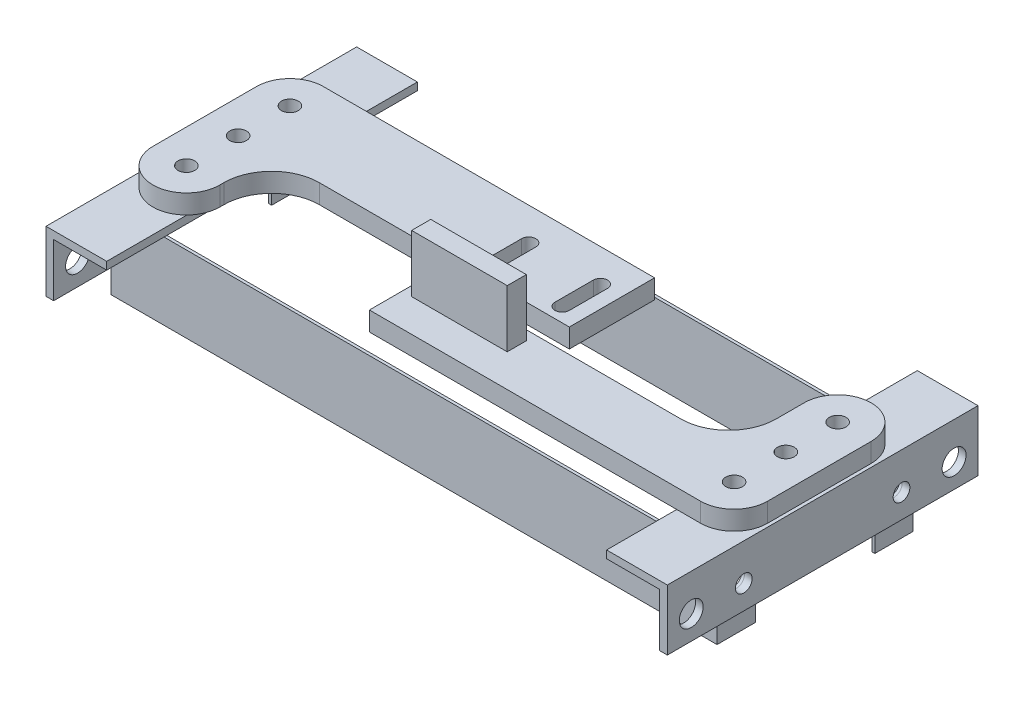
ISO-10303-21;
HEADER;
FILE_DESCRIPTION(('STEP AP214'),'2;1');
FILE_NAME('part.step','',(''),(''),'','','');
FILE_SCHEMA(('AUTOMOTIVE_DESIGN { 1 0 10303 214 1 1 1 1 }'));
ENDSEC;
DATA;
#1=APPLICATION_CONTEXT('core data for automotive mechanical design processes');
#2=APPLICATION_PROTOCOL_DEFINITION('international standard','automotive_design',2000,#1);
#3=PRODUCT_CONTEXT('',#1,'mechanical');
#4=PRODUCT('Part','Part','',(#3));
#5=PRODUCT_RELATED_PRODUCT_CATEGORY('part','',(#4));
#6=PRODUCT_DEFINITION_FORMATION('','',#4);
#7=PRODUCT_DEFINITION_CONTEXT('part definition',#1,'design');
#8=PRODUCT_DEFINITION('design','',#6,#7);
#9=PRODUCT_DEFINITION_SHAPE('','',#8);
#10=(LENGTH_UNIT() NAMED_UNIT(*) SI_UNIT(.MILLI.,.METRE.));
#11=(NAMED_UNIT(*) PLANE_ANGLE_UNIT() SI_UNIT($,.RADIAN.));
#12=(NAMED_UNIT(*) SI_UNIT($,.STERADIAN.) SOLID_ANGLE_UNIT());
#13=UNCERTAINTY_MEASURE_WITH_UNIT(LENGTH_MEASURE(1.E-05),#10,'distance_accuracy_value','');
#14=(GEOMETRIC_REPRESENTATION_CONTEXT(3) GLOBAL_UNCERTAINTY_ASSIGNED_CONTEXT((#13)) GLOBAL_UNIT_ASSIGNED_CONTEXT((#10,
#11,#12)) REPRESENTATION_CONTEXT('',''));
#15=CARTESIAN_POINT('',(0.,0.,0.));
#16=DIRECTION('',(0.,0.,1.));
#17=DIRECTION('',(1.,0.,0.));
#18=AXIS2_PLACEMENT_3D('',#15,#16,#17);
#19=CARTESIAN_POINT('',(57.3,10.35,-43.3333333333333));
#20=DIRECTION('',(0.,-1.,0.));
#21=DIRECTION('',(0.,0.,-1.));
#22=AXIS2_PLACEMENT_3D('',#19,#20,#21);
#23=PLANE('',#22);
#24=DIRECTION('',(0.,0.,1.));
#25=VECTOR('',#24,1.);
#26=CARTESIAN_POINT('',(5.99999999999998,10.35,0.));
#27=LINE('',#26,#25);
#28=CARTESIAN_POINT('',(5.99999999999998,10.35,-25.5));
#29=VERTEX_POINT('',#28);
#30=CARTESIAN_POINT('',(5.99999999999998,10.35,-21.5));
#31=VERTEX_POINT('',#30);
#32=EDGE_CURVE('E340',#29,#31,#27,.T.);
#33=ORIENTED_EDGE('',*,*,#32,.T.);
#34=DIRECTION('',(-1.,0.,0.));
#35=VECTOR('',#34,1.);
#36=CARTESIAN_POINT('',(0.,10.35,-21.5));
#37=LINE('',#36,#35);
#38=CARTESIAN_POINT('',(-6.00000000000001,10.35,-21.5));
#39=VERTEX_POINT('',#38);
#40=EDGE_CURVE('E321',#31,#39,#37,.T.);
#41=ORIENTED_EDGE('',*,*,#40,.T.);
#42=DIRECTION('',(0.,0.,1.));
#43=VECTOR('',#42,1.);
#44=CARTESIAN_POINT('',(-6.00000000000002,10.35,0.));
#45=LINE('',#44,#43);
#46=CARTESIAN_POINT('',(-6.00000000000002,10.35,-25.5));
#47=VERTEX_POINT('',#46);
#48=EDGE_CURVE('E332',#47,#39,#45,.T.);
#49=ORIENTED_EDGE('',*,*,#48,.F.);
#50=DIRECTION('',(-1.,0.,0.));
#51=VECTOR('',#50,1.);
#52=CARTESIAN_POINT('',(0.,10.35,-25.5));
#53=LINE('',#52,#51);
#54=EDGE_CURVE('E342',#29,#47,#53,.T.);
#55=ORIENTED_EDGE('',*,*,#54,.F.);
#56=EDGE_LOOP('',(#33,#41,#49,#55));
#57=FACE_BOUND('',#56,.T.);
#58=CARTESIAN_POINT('',(57.3,10.35,-43.3333333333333));
#59=DIRECTION('',(0.,1.,0.));
#60=DIRECTION('',(0.,0.,-1.));
#61=AXIS2_PLACEMENT_3D('',#58,#59,#60);
#62=CIRCLE('',#61,7.);
#63=CARTESIAN_POINT('',(64.3,10.35,-43.3333333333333));
#64=VERTEX_POINT('',#63);
#65=CARTESIAN_POINT('',(50.3,10.35,-43.3333333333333));
#66=VERTEX_POINT('',#65);
#67=EDGE_CURVE('E411',#64,#66,#62,.T.);
#68=ORIENTED_EDGE('',*,*,#67,.T.);
#69=DIRECTION('',(0.,0.,1.));
#70=VECTOR('',#69,1.);
#71=CARTESIAN_POINT('',(50.3,10.35,-43.3333333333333));
#72=LINE('',#71,#70);
#73=CARTESIAN_POINT('',(50.3,10.35,-37.5));
#74=VERTEX_POINT('',#73);
#75=EDGE_CURVE('E408',#66,#74,#72,.T.);
#76=ORIENTED_EDGE('',*,*,#75,.T.);
#77=CARTESIAN_POINT('',(40.3,10.35,-37.5));
#78=DIRECTION('',(0.,1.,0.));
#79=DIRECTION('',(0.,0.,-1.));
#80=AXIS2_PLACEMENT_3D('',#77,#78,#79);
#81=CIRCLE('',#80,10.);
#82=CARTESIAN_POINT('',(40.3,10.35,-27.5));
#83=VERTEX_POINT('',#82);
#84=EDGE_CURVE('E13',#83,#74,#81,.T.);
#85=ORIENTED_EDGE('',*,*,#84,.F.);
#86=DIRECTION('',(1.,0.,0.));
#87=VECTOR('',#86,1.);
#88=CARTESIAN_POINT('',(-12.,10.35,-27.5));
#89=LINE('',#88,#87);
#90=CARTESIAN_POINT('',(-12.,10.35,-27.5));
#91=VERTEX_POINT('',#90);
#92=EDGE_CURVE('E406',#91,#83,#89,.T.);
#93=ORIENTED_EDGE('',*,*,#92,.F.);
#94=DIRECTION('',(0.,0.,-1.));
#95=VECTOR('',#94,1.);
#96=CARTESIAN_POINT('',(-12.,10.35,-14.6666666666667));
#97=LINE('',#96,#95);
#98=CARTESIAN_POINT('',(-12.,10.35,-14.6666666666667));
#99=VERTEX_POINT('',#98);
#100=EDGE_CURVE('E403',#99,#91,#97,.T.);
#101=ORIENTED_EDGE('',*,*,#100,.F.);
#102=DIRECTION('',(-1.,0.,0.));
#103=VECTOR('',#102,1.);
#104=CARTESIAN_POINT('',(57.3,10.35,-14.6666666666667));
#105=LINE('',#104,#103);
#106=CARTESIAN_POINT('',(57.3,10.35,-14.6666666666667));
#107=VERTEX_POINT('',#106);
#108=EDGE_CURVE('E400',#107,#99,#105,.T.);
#109=ORIENTED_EDGE('',*,*,#108,.F.);
#110=CARTESIAN_POINT('',(57.3,10.35,-21.6666666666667));
#111=DIRECTION('',(0.,-1.,0.));
#112=DIRECTION('',(0.,0.,1.));
#113=AXIS2_PLACEMENT_3D('',#110,#111,#112);
#114=CIRCLE('',#113,7.00000000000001);
#115=CARTESIAN_POINT('',(64.3,10.35,-21.6666666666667));
#116=VERTEX_POINT('',#115);
#117=EDGE_CURVE('E396',#116,#107,#114,.T.);
#118=ORIENTED_EDGE('',*,*,#117,.F.);
#119=DIRECTION('',(0.,0.,1.));
#120=VECTOR('',#119,1.);
#121=CARTESIAN_POINT('',(64.3,10.35,-43.3333333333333));
#122=LINE('',#121,#120);
#123=EDGE_CURVE('E393',#64,#116,#122,.T.);
#124=ORIENTED_EDGE('',*,*,#123,.F.);
#125=EDGE_LOOP('',(#68,#76,#85,#93,#101,#109,#118,#124));
#126=FACE_BOUND('',#125,.T.);
#127=CARTESIAN_POINT('',(57.3,10.35,-43.3333333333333));
#128=DIRECTION('',(0.,-1.,0.));
#129=DIRECTION('',(0.,0.,1.));
#130=AXIS2_PLACEMENT_3D('',#127,#128,#129);
#131=CIRCLE('',#130,1.75);
#132=CARTESIAN_POINT('',(57.3,10.35,-41.5833333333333));
#133=VERTEX_POINT('',#132);
#134=EDGE_CURVE('E352',#133,#133,#131,.T.);
#135=ORIENTED_EDGE('',*,*,#134,.T.);
#136=EDGE_LOOP('',(#135));
#137=FACE_BOUND('',#136,.T.);
#138=CARTESIAN_POINT('',(57.3,10.35,-32.5));
#139=DIRECTION('',(0.,-1.,0.));
#140=DIRECTION('',(0.,0.,1.));
#141=AXIS2_PLACEMENT_3D('',#138,#139,#140);
#142=CIRCLE('',#141,1.75);
#143=CARTESIAN_POINT('',(57.3,10.35,-30.75));
#144=VERTEX_POINT('',#143);
#145=EDGE_CURVE('E351',#144,#144,#142,.T.);
#146=ORIENTED_EDGE('',*,*,#145,.T.);
#147=EDGE_LOOP('',(#146));
#148=FACE_BOUND('',#147,.T.);
#149=CARTESIAN_POINT('',(57.3,10.35,-21.6666666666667));
#150=DIRECTION('',(0.,-1.,0.));
#151=DIRECTION('',(0.,0.,1.));
#152=AXIS2_PLACEMENT_3D('',#149,#150,#151);
#153=CIRCLE('',#152,1.75);
#154=CARTESIAN_POINT('',(57.3,10.35,-19.9166666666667));
#155=VERTEX_POINT('',#154);
#156=EDGE_CURVE('E359',#155,#155,#153,.T.);
#157=ORIENTED_EDGE('',*,*,#156,.T.);
#158=EDGE_LOOP('',(#157));
#159=FACE_BOUND('',#158,.T.);
#160=ADVANCED_FACE('F230',(#57,#126,#137,#148,#159),#23,.F.);
#161=CARTESIAN_POINT('',(57.3,6.35000000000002,-43.3333333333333));
#162=DIRECTION('',(0.,-1.,0.));
#163=DIRECTION('',(0.,0.,-1.));
#164=AXIS2_PLACEMENT_3D('',#161,#162,#163);
#165=PLANE('',#164);
#166=CARTESIAN_POINT('',(57.3,6.35000000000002,-32.5));
#167=DIRECTION('',(0.,-1.,0.));
#168=DIRECTION('',(0.,0.,1.));
#169=AXIS2_PLACEMENT_3D('',#166,#167,#168);
#170=CIRCLE('',#169,1.75);
#171=CARTESIAN_POINT('',(57.3,6.35000000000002,-30.75));
#172=VERTEX_POINT('',#171);
#173=EDGE_CURVE('E356',#172,#172,#170,.T.);
#174=ORIENTED_EDGE('',*,*,#173,.F.);
#175=EDGE_LOOP('',(#174));
#176=FACE_BOUND('',#175,.T.);
#177=CARTESIAN_POINT('',(57.3,6.35000000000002,-43.3333333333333));
#178=DIRECTION('',(0.,1.,0.));
#179=DIRECTION('',(0.,0.,-1.));
#180=AXIS2_PLACEMENT_3D('',#177,#178,#179);
#181=CIRCLE('',#180,7.);
#182=CARTESIAN_POINT('',(64.3,6.35000000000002,-43.3333333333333));
#183=VERTEX_POINT('',#182);
#184=CARTESIAN_POINT('',(50.3,6.35000000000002,-43.3333333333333));
#185=VERTEX_POINT('',#184);
#186=EDGE_CURVE('E384',#183,#185,#181,.T.);
#187=ORIENTED_EDGE('',*,*,#186,.F.);
#188=DIRECTION('',(0.,0.,1.));
#189=VECTOR('',#188,1.);
#190=CARTESIAN_POINT('',(64.3,6.35000000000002,-43.3333333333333));
#191=LINE('',#190,#189);
#192=CARTESIAN_POINT('',(64.3,6.35000000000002,-21.6666666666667));
#193=VERTEX_POINT('',#192);
#194=EDGE_CURVE('E414',#183,#193,#191,.T.);
#195=ORIENTED_EDGE('',*,*,#194,.T.);
#196=CARTESIAN_POINT('',(57.3,6.35000000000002,-21.6666666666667));
#197=DIRECTION('',(0.,-1.,0.));
#198=DIRECTION('',(0.,0.,1.));
#199=AXIS2_PLACEMENT_3D('',#196,#197,#198);
#200=CIRCLE('',#199,7.00000000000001);
#201=CARTESIAN_POINT('',(57.3,6.35000000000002,-14.6666666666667));
#202=VERTEX_POINT('',#201);
#203=EDGE_CURVE('E492',#193,#202,#200,.T.);
#204=ORIENTED_EDGE('',*,*,#203,.T.);
#205=DIRECTION('',(-1.,0.,0.));
#206=VECTOR('',#205,1.);
#207=CARTESIAN_POINT('',(57.3,6.35000000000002,-14.6666666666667));
#208=LINE('',#207,#206);
#209=CARTESIAN_POINT('',(-12.,6.35000000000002,-14.6666666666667));
#210=VERTEX_POINT('',#209);
#211=EDGE_CURVE('E386',#202,#210,#208,.T.);
#212=ORIENTED_EDGE('',*,*,#211,.T.);
#213=DIRECTION('',(0.,0.,-1.));
#214=VECTOR('',#213,1.);
#215=CARTESIAN_POINT('',(-12.,6.35000000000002,-14.6666666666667));
#216=LINE('',#215,#214);
#217=CARTESIAN_POINT('',(-12.,6.35000000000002,-27.5));
#218=VERTEX_POINT('',#217);
#219=EDGE_CURVE('E381',#210,#218,#216,.T.);
#220=ORIENTED_EDGE('',*,*,#219,.T.);
#221=DIRECTION('',(1.,0.,0.));
#222=VECTOR('',#221,1.);
#223=CARTESIAN_POINT('',(-12.,6.35000000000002,-27.5));
#224=LINE('',#223,#222);
#225=CARTESIAN_POINT('',(40.3,6.35000000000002,-27.5));
#226=VERTEX_POINT('',#225);
#227=EDGE_CURVE('E375',#218,#226,#224,.T.);
#228=ORIENTED_EDGE('',*,*,#227,.T.);
#229=CARTESIAN_POINT('',(40.3,6.35000000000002,-37.5));
#230=DIRECTION('',(0.,1.,0.));
#231=DIRECTION('',(0.,0.,-1.));
#232=AXIS2_PLACEMENT_3D('',#229,#230,#231);
#233=CIRCLE('',#232,10.);
#234=CARTESIAN_POINT('',(50.3,6.35000000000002,-37.5));
#235=VERTEX_POINT('',#234);
#236=EDGE_CURVE('E238',#235,#226,#233,.F.);
#237=ORIENTED_EDGE('',*,*,#236,.F.);
#238=DIRECTION('',(0.,0.,1.));
#239=VECTOR('',#238,1.);
#240=CARTESIAN_POINT('',(50.3,6.35000000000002,-43.3333333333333));
#241=LINE('',#240,#239);
#242=EDGE_CURVE('E382',#185,#235,#241,.T.);
#243=ORIENTED_EDGE('',*,*,#242,.F.);
#244=EDGE_LOOP('',(#187,#195,#204,#212,#220,#228,#237,#243));
#245=FACE_BOUND('',#244,.T.);
#246=DIRECTION('',(-1.,0.,0.));
#247=VECTOR('',#246,1.);
#248=CARTESIAN_POINT('',(0.,6.35000000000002,-25.5));
#249=LINE('',#248,#247);
#250=CARTESIAN_POINT('',(5.99999999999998,6.35000000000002,-25.5));
#251=VERTEX_POINT('',#250);
#252=CARTESIAN_POINT('',(-6.00000000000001,6.35000000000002,-25.5));
#253=VERTEX_POINT('',#252);
#254=EDGE_CURVE('E355',#251,#253,#249,.T.);
#255=ORIENTED_EDGE('',*,*,#254,.T.);
#256=DIRECTION('',(0.,0.,1.));
#257=VECTOR('',#256,1.);
#258=CARTESIAN_POINT('',(-6.00000000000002,6.35000000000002,0.));
#259=LINE('',#258,#257);
#260=CARTESIAN_POINT('',(-6.00000000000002,6.35000000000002,-21.5));
#261=VERTEX_POINT('',#260);
#262=EDGE_CURVE('E347',#253,#261,#259,.T.);
#263=ORIENTED_EDGE('',*,*,#262,.T.);
#264=DIRECTION('',(-1.,0.,0.));
#265=VECTOR('',#264,1.);
#266=CARTESIAN_POINT('',(0.,6.35000000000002,-21.5));
#267=LINE('',#266,#265);
#268=CARTESIAN_POINT('',(5.99999999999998,6.35000000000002,-21.5));
#269=VERTEX_POINT('',#268);
#270=EDGE_CURVE('E324',#269,#261,#267,.T.);
#271=ORIENTED_EDGE('',*,*,#270,.F.);
#272=DIRECTION('',(0.,0.,1.));
#273=VECTOR('',#272,1.);
#274=CARTESIAN_POINT('',(5.99999999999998,6.35000000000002,0.));
#275=LINE('',#274,#273);
#276=EDGE_CURVE('E420',#251,#269,#275,.T.);
#277=ORIENTED_EDGE('',*,*,#276,.F.);
#278=EDGE_LOOP('',(#255,#263,#271,#277));
#279=FACE_BOUND('',#278,.T.);
#280=CARTESIAN_POINT('',(57.3,6.35000000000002,-43.3333333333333));
#281=DIRECTION('',(0.,-1.,0.));
#282=DIRECTION('',(0.,0.,1.));
#283=AXIS2_PLACEMENT_3D('',#280,#281,#282);
#284=CIRCLE('',#283,1.75);
#285=CARTESIAN_POINT('',(57.3,6.35000000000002,-41.5833333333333));
#286=VERTEX_POINT('',#285);
#287=EDGE_CURVE('E348',#286,#286,#284,.T.);
#288=ORIENTED_EDGE('',*,*,#287,.F.);
#289=EDGE_LOOP('',(#288));
#290=FACE_BOUND('',#289,.T.);
#291=CARTESIAN_POINT('',(57.3,6.35000000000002,-21.6666666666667));
#292=DIRECTION('',(0.,-1.,0.));
#293=DIRECTION('',(0.,0.,1.));
#294=AXIS2_PLACEMENT_3D('',#291,#292,#293);
#295=CIRCLE('',#294,1.75);
#296=CARTESIAN_POINT('',(57.3,6.35000000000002,-19.9166666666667));
#297=VERTEX_POINT('',#296);
#298=EDGE_CURVE('E362',#297,#297,#295,.T.);
#299=ORIENTED_EDGE('',*,*,#298,.F.);
#300=EDGE_LOOP('',(#299));
#301=FACE_BOUND('',#300,.T.);
#302=ADVANCED_FACE('F377',(#176,#245,#279,#290,#301),#165,.T.);
#303=CARTESIAN_POINT('',(57.3,10.35,-43.3333333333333));
#304=DIRECTION('',(0.,-1.,0.));
#305=DIRECTION('',(0.,0.,-1.));
#306=AXIS2_PLACEMENT_3D('',#303,#304,#305);
#307=CYLINDRICAL_SURFACE('',#306,7.);
#308=ORIENTED_EDGE('',*,*,#186,.T.);
#309=DIRECTION('',(0.,-1.,0.));
#310=VECTOR('',#309,1.);
#311=CARTESIAN_POINT('',(50.3,10.35,-43.3333333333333));
#312=LINE('',#311,#310);
#313=EDGE_CURVE('E397',#66,#185,#312,.T.);
#314=ORIENTED_EDGE('',*,*,#313,.F.);
#315=ORIENTED_EDGE('',*,*,#67,.F.);
#316=DIRECTION('',(0.,-1.,0.));
#317=VECTOR('',#316,1.);
#318=CARTESIAN_POINT('',(64.3,10.35,-43.3333333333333));
#319=LINE('',#318,#317);
#320=EDGE_CURVE('E476',#64,#183,#319,.T.);
#321=ORIENTED_EDGE('',*,*,#320,.T.);
#322=EDGE_LOOP('',(#308,#314,#315,#321));
#323=FACE_BOUND('',#322,.T.);
#324=ADVANCED_FACE('F444',(#323),#307,.T.);
#325=CARTESIAN_POINT('',(64.3,10.35,-43.3333333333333));
#326=DIRECTION('',(-1.,0.,0.));
#327=DIRECTION('',(0.,0.,-1.));
#328=AXIS2_PLACEMENT_3D('',#325,#326,#327);
#329=PLANE('',#328);
#330=ORIENTED_EDGE('',*,*,#194,.F.);
#331=ORIENTED_EDGE('',*,*,#320,.F.);
#332=ORIENTED_EDGE('',*,*,#123,.T.);
#333=DIRECTION('',(0.,-1.,0.));
#334=VECTOR('',#333,1.);
#335=CARTESIAN_POINT('',(64.3,10.35,-21.6666666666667));
#336=LINE('',#335,#334);
#337=EDGE_CURVE('E488',#116,#193,#336,.T.);
#338=ORIENTED_EDGE('',*,*,#337,.T.);
#339=EDGE_LOOP('',(#330,#331,#332,#338));
#340=FACE_BOUND('',#339,.T.);
#341=ADVANCED_FACE('F448',(#340),#329,.F.);
#342=CARTESIAN_POINT('',(57.3,10.35,-21.6666666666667));
#343=DIRECTION('',(0.,-1.,0.));
#344=DIRECTION('',(0.,0.,-1.));
#345=AXIS2_PLACEMENT_3D('',#342,#343,#344);
#346=CYLINDRICAL_SURFACE('',#345,7.00000000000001);
#347=ORIENTED_EDGE('',*,*,#203,.F.);
#348=ORIENTED_EDGE('',*,*,#337,.F.);
#349=ORIENTED_EDGE('',*,*,#117,.T.);
#350=DIRECTION('',(0.,-1.,0.));
#351=VECTOR('',#350,1.);
#352=CARTESIAN_POINT('',(57.3,10.35,-14.6666666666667));
#353=LINE('',#352,#351);
#354=EDGE_CURVE('E486',#107,#202,#353,.T.);
#355=ORIENTED_EDGE('',*,*,#354,.T.);
#356=EDGE_LOOP('',(#347,#348,#349,#355));
#357=FACE_BOUND('',#356,.T.);
#358=ADVANCED_FACE('F451',(#357),#346,.T.);
#359=CARTESIAN_POINT('',(57.3,10.35,-14.6666666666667));
#360=DIRECTION('',(0.,0.,-1.));
#361=DIRECTION('',(1.,0.,0.));
#362=AXIS2_PLACEMENT_3D('',#359,#360,#361);
#363=PLANE('',#362);
#364=ORIENTED_EDGE('',*,*,#211,.F.);
#365=ORIENTED_EDGE('',*,*,#354,.F.);
#366=ORIENTED_EDGE('',*,*,#108,.T.);
#367=DIRECTION('',(0.,-1.,0.));
#368=VECTOR('',#367,1.);
#369=CARTESIAN_POINT('',(-12.,10.35,-14.6666666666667));
#370=LINE('',#369,#368);
#371=EDGE_CURVE('E482',#99,#210,#370,.T.);
#372=ORIENTED_EDGE('',*,*,#371,.T.);
#373=EDGE_LOOP('',(#364,#365,#366,#372));
#374=FACE_BOUND('',#373,.T.);
#375=ADVANCED_FACE('F455',(#374),#363,.F.);
#376=CARTESIAN_POINT('',(-12.,10.35,-14.6666666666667));
#377=DIRECTION('',(1.,0.,0.));
#378=DIRECTION('',(0.,0.,1.));
#379=AXIS2_PLACEMENT_3D('',#376,#377,#378);
#380=PLANE('',#379);
#381=ORIENTED_EDGE('',*,*,#219,.F.);
#382=ORIENTED_EDGE('',*,*,#371,.F.);
#383=ORIENTED_EDGE('',*,*,#100,.T.);
#384=DIRECTION('',(0.,-1.,0.));
#385=VECTOR('',#384,1.);
#386=CARTESIAN_POINT('',(-12.,10.35,-27.5));
#387=LINE('',#386,#385);
#388=EDGE_CURVE('E480',#91,#218,#387,.T.);
#389=ORIENTED_EDGE('',*,*,#388,.T.);
#390=EDGE_LOOP('',(#381,#382,#383,#389));
#391=FACE_BOUND('',#390,.T.);
#392=ADVANCED_FACE('F459',(#391),#380,.F.);
#393=CARTESIAN_POINT('',(-12.,10.35,-27.5));
#394=DIRECTION('',(0.,0.,1.));
#395=DIRECTION('',(-1.,0.,0.));
#396=AXIS2_PLACEMENT_3D('',#393,#394,#395);
#397=PLANE('',#396);
#398=ORIENTED_EDGE('',*,*,#227,.F.);
#399=ORIENTED_EDGE('',*,*,#388,.F.);
#400=ORIENTED_EDGE('',*,*,#92,.T.);
#401=DIRECTION('',(0.,-1.,0.));
#402=VECTOR('',#401,1.);
#403=CARTESIAN_POINT('',(40.3,10.35,-27.5));
#404=LINE('',#403,#402);
#405=EDGE_CURVE('E244',#226,#83,#404,.F.);
#406=ORIENTED_EDGE('',*,*,#405,.F.);
#407=EDGE_LOOP('',(#398,#399,#400,#406));
#408=FACE_BOUND('',#407,.T.);
#409=ADVANCED_FACE('F463',(#408),#397,.F.);
#410=CARTESIAN_POINT('',(50.3,10.35,-43.3333333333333));
#411=DIRECTION('',(-1.,0.,0.));
#412=DIRECTION('',(0.,0.,-1.));
#413=AXIS2_PLACEMENT_3D('',#410,#411,#412);
#414=PLANE('',#413);
#415=ORIENTED_EDGE('',*,*,#75,.F.);
#416=ORIENTED_EDGE('',*,*,#313,.T.);
#417=ORIENTED_EDGE('',*,*,#242,.T.);
#418=DIRECTION('',(0.,-1.,0.));
#419=VECTOR('',#418,1.);
#420=CARTESIAN_POINT('',(50.3,10.35,-37.5));
#421=LINE('',#420,#419);
#422=EDGE_CURVE('E365',#74,#235,#421,.T.);
#423=ORIENTED_EDGE('',*,*,#422,.F.);
#424=EDGE_LOOP('',(#415,#416,#417,#423));
#425=FACE_BOUND('',#424,.T.);
#426=ADVANCED_FACE('F437',(#425),#414,.T.);
#427=CARTESIAN_POINT('',(0.,10.35,-25.5));
#428=DIRECTION('',(0.,0.,-1.));
#429=DIRECTION('',(1.,0.,0.));
#430=AXIS2_PLACEMENT_3D('',#427,#428,#429);
#431=PLANE('',#430);
#432=ORIENTED_EDGE('',*,*,#254,.F.);
#433=DIRECTION('',(0.,-1.,0.));
#434=VECTOR('',#433,1.);
#435=CARTESIAN_POINT('',(5.99999999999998,10.35,-25.5));
#436=LINE('',#435,#434);
#437=EDGE_CURVE('E392',#29,#251,#436,.T.);
#438=ORIENTED_EDGE('',*,*,#437,.F.);
#439=ORIENTED_EDGE('',*,*,#54,.T.);
#440=DIRECTION('',(0.,-1.,0.));
#441=VECTOR('',#440,1.);
#442=CARTESIAN_POINT('',(-6.00000000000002,10.35,-25.5));
#443=LINE('',#442,#441);
#444=EDGE_CURVE('E328',#47,#253,#443,.T.);
#445=ORIENTED_EDGE('',*,*,#444,.T.);
#446=EDGE_LOOP('',(#432,#438,#439,#445));
#447=FACE_BOUND('',#446,.T.);
#448=ADVANCED_FACE('F427',(#447),#431,.F.);
#449=CARTESIAN_POINT('',(5.99999999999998,10.35,0.));
#450=DIRECTION('',(-1.,0.,0.));
#451=DIRECTION('',(0.,0.,-1.));
#452=AXIS2_PLACEMENT_3D('',#449,#450,#451);
#453=PLANE('',#452);
#454=ORIENTED_EDGE('',*,*,#276,.T.);
#455=DIRECTION('',(0.,-1.,0.));
#456=VECTOR('',#455,1.);
#457=CARTESIAN_POINT('',(5.99999999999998,10.35,-21.5));
#458=LINE('',#457,#456);
#459=EDGE_CURVE('E329',#31,#269,#458,.T.);
#460=ORIENTED_EDGE('',*,*,#459,.F.);
#461=ORIENTED_EDGE('',*,*,#32,.F.);
#462=ORIENTED_EDGE('',*,*,#437,.T.);
#463=EDGE_LOOP('',(#454,#460,#461,#462));
#464=FACE_BOUND('',#463,.T.);
#465=ADVANCED_FACE('F429',(#464),#453,.T.);
#466=CARTESIAN_POINT('',(0.,10.35,-21.5));
#467=DIRECTION('',(0.,0.,-1.));
#468=DIRECTION('',(1.,0.,0.));
#469=AXIS2_PLACEMENT_3D('',#466,#467,#468);
#470=PLANE('',#469);
#471=ORIENTED_EDGE('',*,*,#270,.T.);
#472=DIRECTION('',(0.,-1.,0.));
#473=VECTOR('',#472,1.);
#474=CARTESIAN_POINT('',(-6.00000000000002,10.35,-21.5));
#475=LINE('',#474,#473);
#476=EDGE_CURVE('E317',#39,#261,#475,.T.);
#477=ORIENTED_EDGE('',*,*,#476,.F.);
#478=ORIENTED_EDGE('',*,*,#40,.F.);
#479=ORIENTED_EDGE('',*,*,#459,.T.);
#480=EDGE_LOOP('',(#471,#477,#478,#479));
#481=FACE_BOUND('',#480,.T.);
#482=ADVANCED_FACE('F319',(#481),#470,.T.);
#483=CARTESIAN_POINT('',(-6.00000000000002,10.35,0.));
#484=DIRECTION('',(-1.,0.,0.));
#485=DIRECTION('',(0.,0.,-1.));
#486=AXIS2_PLACEMENT_3D('',#483,#484,#485);
#487=PLANE('',#486);
#488=ORIENTED_EDGE('',*,*,#262,.F.);
#489=ORIENTED_EDGE('',*,*,#444,.F.);
#490=ORIENTED_EDGE('',*,*,#48,.T.);
#491=ORIENTED_EDGE('',*,*,#476,.T.);
#492=EDGE_LOOP('',(#488,#489,#490,#491));
#493=FACE_BOUND('',#492,.T.);
#494=ADVANCED_FACE('F333',(#493),#487,.F.);
#495=CARTESIAN_POINT('',(57.3,10.35,-43.3333333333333));
#496=DIRECTION('',(0.,-1.,0.));
#497=DIRECTION('',(0.,0.,-1.));
#498=AXIS2_PLACEMENT_3D('',#495,#496,#497);
#499=CYLINDRICAL_SURFACE('',#498,1.75);
#500=ORIENTED_EDGE('',*,*,#134,.F.);
#501=EDGE_LOOP('',(#500));
#502=FACE_BOUND('',#501,.T.);
#503=ORIENTED_EDGE('',*,*,#287,.T.);
#504=EDGE_LOOP('',(#503));
#505=FACE_BOUND('',#504,.T.);
#506=ADVANCED_FACE('F518',(#502,#505),#499,.F.);
#507=CARTESIAN_POINT('',(57.3,10.35,-32.5));
#508=DIRECTION('',(0.,-1.,0.));
#509=DIRECTION('',(0.,0.,-1.));
#510=AXIS2_PLACEMENT_3D('',#507,#508,#509);
#511=CYLINDRICAL_SURFACE('',#510,1.75);
#512=ORIENTED_EDGE('',*,*,#145,.F.);
#513=EDGE_LOOP('',(#512));
#514=FACE_BOUND('',#513,.T.);
#515=ORIENTED_EDGE('',*,*,#173,.T.);
#516=EDGE_LOOP('',(#515));
#517=FACE_BOUND('',#516,.T.);
#518=ADVANCED_FACE('F511',(#514,#517),#511,.F.);
#519=CARTESIAN_POINT('',(57.3,10.35,-21.6666666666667));
#520=DIRECTION('',(0.,-1.,0.));
#521=DIRECTION('',(0.,0.,-1.));
#522=AXIS2_PLACEMENT_3D('',#519,#520,#521);
#523=CYLINDRICAL_SURFACE('',#522,1.75);
#524=ORIENTED_EDGE('',*,*,#156,.F.);
#525=EDGE_LOOP('',(#524));
#526=FACE_BOUND('',#525,.T.);
#527=ORIENTED_EDGE('',*,*,#298,.T.);
#528=EDGE_LOOP('',(#527));
#529=FACE_BOUND('',#528,.T.);
#530=ADVANCED_FACE('F508',(#526,#529),#523,.F.);
#531=CARTESIAN_POINT('',(40.3,10.35,-37.5));
#532=DIRECTION('',(0.,-1.,0.));
#533=DIRECTION('',(0.,0.,-1.));
#534=AXIS2_PLACEMENT_3D('',#531,#532,#533);
#535=CYLINDRICAL_SURFACE('',#534,10.);
#536=ORIENTED_EDGE('',*,*,#84,.T.);
#537=ORIENTED_EDGE('',*,*,#422,.T.);
#538=ORIENTED_EDGE('',*,*,#236,.T.);
#539=ORIENTED_EDGE('',*,*,#405,.T.);
#540=EDGE_LOOP('',(#536,#537,#538,#539));
#541=FACE_BOUND('',#540,.T.);
#542=ADVANCED_FACE('F232',(#541),#535,.F.);
#543=CLOSED_SHELL('',(#160,#302,#324,#341,#358,#375,#392,#409,#426,#448,#465,#482,#494,#506,
#518,#530,#542));
#544=MANIFOLD_SOLID_BREP('B2',#543);
#545=CARTESIAN_POINT('',(0.,10.35,0.));
#546=DIRECTION('',(0.,1.,0.));
#547=DIRECTION('',(0.,0.,1.));
#548=AXIS2_PLACEMENT_3D('',#545,#546,#547);
#549=PLANE('',#548);
#550=DIRECTION('',(0.,0.,-1.));
#551=VECTOR('',#550,1.);
#552=CARTESIAN_POINT('',(5.99999999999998,10.35,0.));
#553=LINE('',#552,#551);
#554=CARTESIAN_POINT('',(5.99999999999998,10.35,-21.5));
#555=VERTEX_POINT('',#554);
#556=CARTESIAN_POINT('',(5.99999999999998,10.35,-25.5));
#557=VERTEX_POINT('',#556);
#558=EDGE_CURVE('E228',#555,#557,#553,.T.);
#559=ORIENTED_EDGE('',*,*,#558,.T.);
#560=DIRECTION('',(-1.,0.,0.));
#561=VECTOR('',#560,1.);
#562=CARTESIAN_POINT('',(57.3,10.35,-25.5));
#563=LINE('',#562,#561);
#564=CARTESIAN_POINT('',(9.99999999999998,10.35,-25.5));
#565=VERTEX_POINT('',#564);
#566=EDGE_CURVE('E730',#565,#557,#563,.T.);
#567=ORIENTED_EDGE('',*,*,#566,.F.);
#568=DIRECTION('',(0.,0.,1.));
#569=VECTOR('',#568,1.);
#570=CARTESIAN_POINT('',(9.99999999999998,10.35,-43.3333333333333));
#571=LINE('',#570,#569);
#572=CARTESIAN_POINT('',(9.99999999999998,10.35,-21.5));
#573=VERTEX_POINT('',#572);
#574=EDGE_CURVE('E751',#565,#573,#571,.T.);
#575=ORIENTED_EDGE('',*,*,#574,.T.);
#576=DIRECTION('',(-1.,0.,0.));
#577=VECTOR('',#576,1.);
#578=CARTESIAN_POINT('',(57.3,10.35,-21.5));
#579=LINE('',#578,#577);
#580=EDGE_CURVE('E748',#573,#555,#579,.T.);
#581=ORIENTED_EDGE('',*,*,#580,.T.);
#582=EDGE_LOOP('',(#559,#567,#575,#581));
#583=FACE_BOUND('',#582,.T.);
#584=ADVANCED_FACE('F637',(#583),#549,.F.);
#585=CARTESIAN_POINT('',(-10.,22.35,-43.3333333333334));
#586=DIRECTION('',(-1.,0.,0.));
#587=DIRECTION('',(0.,0.,-1.));
#588=AXIS2_PLACEMENT_3D('',#585,#586,#587);
#589=PLANE('',#588);
#590=DIRECTION('',(0.,0.,1.));
#591=VECTOR('',#590,1.);
#592=CARTESIAN_POINT('',(-10.,10.35,-43.3333333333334));
#593=LINE('',#592,#591);
#594=CARTESIAN_POINT('',(-10.,10.35,-25.5));
#595=VERTEX_POINT('',#594);
#596=CARTESIAN_POINT('',(-10.,10.35,-21.5));
#597=VERTEX_POINT('',#596);
#598=EDGE_CURVE('E731',#595,#597,#593,.T.);
#599=ORIENTED_EDGE('',*,*,#598,.T.);
#600=DIRECTION('',(0.,-1.,0.));
#601=VECTOR('',#600,1.);
#602=CARTESIAN_POINT('',(-10.,22.35,-21.5));
#603=LINE('',#602,#601);
#604=CARTESIAN_POINT('',(-10.,22.35,-21.5));
#605=VERTEX_POINT('',#604);
#606=EDGE_CURVE('E746',#605,#597,#603,.T.);
#607=ORIENTED_EDGE('',*,*,#606,.F.);
#608=DIRECTION('',(0.,0.,1.));
#609=VECTOR('',#608,1.);
#610=CARTESIAN_POINT('',(-10.,22.35,-43.3333333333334));
#611=LINE('',#610,#609);
#612=CARTESIAN_POINT('',(-10.,22.35,-25.5));
#613=VERTEX_POINT('',#612);
#614=EDGE_CURVE('E740',#613,#605,#611,.T.);
#615=ORIENTED_EDGE('',*,*,#614,.F.);
#616=DIRECTION('',(0.,-1.,0.));
#617=VECTOR('',#616,1.);
#618=CARTESIAN_POINT('',(-10.,22.35,-25.5));
#619=LINE('',#618,#617);
#620=EDGE_CURVE('E755',#613,#595,#619,.T.);
#621=ORIENTED_EDGE('',*,*,#620,.T.);
#622=EDGE_LOOP('',(#599,#607,#615,#621));
#623=FACE_BOUND('',#622,.T.);
#624=ADVANCED_FACE('F639',(#623),#589,.T.);
#625=CARTESIAN_POINT('',(57.3,22.35,-25.5));
#626=DIRECTION('',(0.,0.,-1.));
#627=DIRECTION('',(1.,0.,0.));
#628=AXIS2_PLACEMENT_3D('',#625,#626,#627);
#629=PLANE('',#628);
#630=DIRECTION('',(0.,-1.,0.));
#631=VECTOR('',#630,1.);
#632=CARTESIAN_POINT('',(5.99999999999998,18.35,-25.5));
#633=LINE('',#632,#631);
#634=CARTESIAN_POINT('',(5.99999999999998,6.35000000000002,-25.5));
#635=VERTEX_POINT('',#634);
#636=EDGE_CURVE('E715',#557,#635,#633,.T.);
#637=ORIENTED_EDGE('',*,*,#636,.T.);
#638=DIRECTION('',(-1.,0.,0.));
#639=VECTOR('',#638,1.);
#640=CARTESIAN_POINT('',(0.,6.35000000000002,-25.5));
#641=LINE('',#640,#639);
#642=CARTESIAN_POINT('',(-6.00000000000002,6.35000000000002,-25.5));
#643=VERTEX_POINT('',#642);
#644=EDGE_CURVE('E722',#635,#643,#641,.T.);
#645=ORIENTED_EDGE('',*,*,#644,.T.);
#646=DIRECTION('',(0.,-1.,0.));
#647=VECTOR('',#646,1.);
#648=CARTESIAN_POINT('',(-6.00000000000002,18.35,-25.5));
#649=LINE('',#648,#647);
#650=CARTESIAN_POINT('',(-6.00000000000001,10.35,-25.5));
#651=VERTEX_POINT('',#650);
#652=EDGE_CURVE('E772',#651,#643,#649,.T.);
#653=ORIENTED_EDGE('',*,*,#652,.F.);
#654=EDGE_CURVE('E680',#651,#595,#563,.T.);
#655=ORIENTED_EDGE('',*,*,#654,.T.);
#656=ORIENTED_EDGE('',*,*,#620,.F.);
#657=DIRECTION('',(-1.,0.,0.));
#658=VECTOR('',#657,1.);
#659=CARTESIAN_POINT('',(57.3,22.35,-25.5));
#660=LINE('',#659,#658);
#661=CARTESIAN_POINT('',(9.99999999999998,22.35,-25.5));
#662=VERTEX_POINT('',#661);
#663=EDGE_CURVE('E660',#662,#613,#660,.T.);
#664=ORIENTED_EDGE('',*,*,#663,.F.);
#665=DIRECTION('',(0.,-1.,0.));
#666=VECTOR('',#665,1.);
#667=CARTESIAN_POINT('',(9.99999999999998,22.35,-25.5));
#668=LINE('',#667,#666);
#669=EDGE_CURVE('E757',#662,#565,#668,.T.);
#670=ORIENTED_EDGE('',*,*,#669,.T.);
#671=ORIENTED_EDGE('',*,*,#566,.T.);
#672=EDGE_LOOP('',(#637,#645,#653,#655,#656,#664,#670,#671));
#673=FACE_BOUND('',#672,.T.);
#674=ADVANCED_FACE('F728',(#673),#629,.T.);
#675=CARTESIAN_POINT('',(9.99999999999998,22.35,-43.3333333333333));
#676=DIRECTION('',(-1.,0.,0.));
#677=DIRECTION('',(0.,0.,-1.));
#678=AXIS2_PLACEMENT_3D('',#675,#676,#677);
#679=PLANE('',#678);
#680=ORIENTED_EDGE('',*,*,#574,.F.);
#681=ORIENTED_EDGE('',*,*,#669,.F.);
#682=DIRECTION('',(0.,0.,1.));
#683=VECTOR('',#682,1.);
#684=CARTESIAN_POINT('',(9.99999999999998,22.35,-43.3333333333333));
#685=LINE('',#684,#683);
#686=CARTESIAN_POINT('',(9.99999999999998,22.35,-21.5));
#687=VERTEX_POINT('',#686);
#688=EDGE_CURVE('E743',#662,#687,#685,.T.);
#689=ORIENTED_EDGE('',*,*,#688,.T.);
#690=DIRECTION('',(0.,-1.,0.));
#691=VECTOR('',#690,1.);
#692=CARTESIAN_POINT('',(9.99999999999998,22.35,-21.5));
#693=LINE('',#692,#691);
#694=EDGE_CURVE('E759',#687,#573,#693,.T.);
#695=ORIENTED_EDGE('',*,*,#694,.T.);
#696=EDGE_LOOP('',(#680,#681,#689,#695));
#697=FACE_BOUND('',#696,.T.);
#698=ADVANCED_FACE('F780',(#697),#679,.F.);
#699=CARTESIAN_POINT('',(57.3,22.35,-21.5));
#700=DIRECTION('',(0.,0.,-1.));
#701=DIRECTION('',(1.,0.,0.));
#702=AXIS2_PLACEMENT_3D('',#699,#700,#701);
#703=PLANE('',#702);
#704=ORIENTED_EDGE('',*,*,#580,.F.);
#705=ORIENTED_EDGE('',*,*,#694,.F.);
#706=DIRECTION('',(-1.,0.,0.));
#707=VECTOR('',#706,1.);
#708=CARTESIAN_POINT('',(57.3,22.35,-21.5));
#709=LINE('',#708,#707);
#710=EDGE_CURVE('E688',#687,#605,#709,.T.);
#711=ORIENTED_EDGE('',*,*,#710,.T.);
#712=ORIENTED_EDGE('',*,*,#606,.T.);
#713=CARTESIAN_POINT('',(-6.00000000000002,10.35,-21.5));
#714=VERTEX_POINT('',#713);
#715=EDGE_CURVE('E734',#714,#597,#579,.T.);
#716=ORIENTED_EDGE('',*,*,#715,.F.);
#717=DIRECTION('',(0.,-1.,0.));
#718=VECTOR('',#717,1.);
#719=CARTESIAN_POINT('',(-6.00000000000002,18.35,-21.5));
#720=LINE('',#719,#718);
#721=CARTESIAN_POINT('',(-6.00000000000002,6.35000000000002,-21.5));
#722=VERTEX_POINT('',#721);
#723=EDGE_CURVE('E736',#714,#722,#720,.T.);
#724=ORIENTED_EDGE('',*,*,#723,.T.);
#725=DIRECTION('',(-1.,0.,0.));
#726=VECTOR('',#725,1.);
#727=CARTESIAN_POINT('',(0.,6.35000000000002,-21.5));
#728=LINE('',#727,#726);
#729=CARTESIAN_POINT('',(5.99999999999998,6.35000000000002,-21.5));
#730=VERTEX_POINT('',#729);
#731=EDGE_CURVE('E721',#730,#722,#728,.T.);
#732=ORIENTED_EDGE('',*,*,#731,.F.);
#733=DIRECTION('',(0.,-1.,0.));
#734=VECTOR('',#733,1.);
#735=CARTESIAN_POINT('',(5.99999999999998,18.35,-21.5));
#736=LINE('',#735,#734);
#737=EDGE_CURVE('E717',#555,#730,#736,.T.);
#738=ORIENTED_EDGE('',*,*,#737,.F.);
#739=EDGE_LOOP('',(#704,#705,#711,#712,#716,#724,#732,#738));
#740=FACE_BOUND('',#739,.T.);
#741=ADVANCED_FACE('F764',(#740),#703,.F.);
#742=CARTESIAN_POINT('',(0.,22.35,0.));
#743=DIRECTION('',(0.,1.,0.));
#744=DIRECTION('',(0.,0.,1.));
#745=AXIS2_PLACEMENT_3D('',#742,#743,#744);
#746=PLANE('',#745);
#747=ORIENTED_EDGE('',*,*,#614,.T.);
#748=ORIENTED_EDGE('',*,*,#710,.F.);
#749=ORIENTED_EDGE('',*,*,#688,.F.);
#750=ORIENTED_EDGE('',*,*,#663,.T.);
#751=EDGE_LOOP('',(#747,#748,#749,#750));
#752=FACE_BOUND('',#751,.T.);
#753=ADVANCED_FACE('F781',(#752),#746,.T.);
#754=ORIENTED_EDGE('',*,*,#715,.T.);
#755=ORIENTED_EDGE('',*,*,#598,.F.);
#756=ORIENTED_EDGE('',*,*,#654,.F.);
#757=DIRECTION('',(0.,0.,-1.));
#758=VECTOR('',#757,1.);
#759=CARTESIAN_POINT('',(-6.00000000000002,10.35,0.));
#760=LINE('',#759,#758);
#761=EDGE_CURVE('E645',#714,#651,#760,.T.);
#762=ORIENTED_EDGE('',*,*,#761,.F.);
#763=EDGE_LOOP('',(#754,#755,#756,#762));
#764=FACE_BOUND('',#763,.T.);
#765=ADVANCED_FACE('F770',(#764),#549,.F.);
#766=CARTESIAN_POINT('',(5.99999999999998,18.35,0.));
#767=DIRECTION('',(-1.,0.,0.));
#768=DIRECTION('',(0.,0.,-1.));
#769=AXIS2_PLACEMENT_3D('',#766,#767,#768);
#770=PLANE('',#769);
#771=ORIENTED_EDGE('',*,*,#737,.T.);
#772=DIRECTION('',(0.,0.,1.));
#773=VECTOR('',#772,1.);
#774=CARTESIAN_POINT('',(5.99999999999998,6.35000000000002,0.));
#775=LINE('',#774,#773);
#776=EDGE_CURVE('E710',#635,#730,#775,.T.);
#777=ORIENTED_EDGE('',*,*,#776,.F.);
#778=ORIENTED_EDGE('',*,*,#636,.F.);
#779=ORIENTED_EDGE('',*,*,#558,.F.);
#780=EDGE_LOOP('',(#771,#777,#778,#779));
#781=FACE_BOUND('',#780,.T.);
#782=ADVANCED_FACE('F712',(#781),#770,.F.);
#783=CARTESIAN_POINT('',(-6.00000000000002,18.35,0.));
#784=DIRECTION('',(-1.,0.,0.));
#785=DIRECTION('',(0.,0.,-1.));
#786=AXIS2_PLACEMENT_3D('',#783,#784,#785);
#787=PLANE('',#786);
#788=ORIENTED_EDGE('',*,*,#761,.T.);
#789=ORIENTED_EDGE('',*,*,#652,.T.);
#790=DIRECTION('',(0.,0.,1.));
#791=VECTOR('',#790,1.);
#792=CARTESIAN_POINT('',(-6.00000000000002,6.35000000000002,0.));
#793=LINE('',#792,#791);
#794=EDGE_CURVE('E726',#643,#722,#793,.T.);
#795=ORIENTED_EDGE('',*,*,#794,.T.);
#796=ORIENTED_EDGE('',*,*,#723,.F.);
#797=EDGE_LOOP('',(#788,#789,#795,#796));
#798=FACE_BOUND('',#797,.T.);
#799=ADVANCED_FACE('F771',(#798),#787,.T.);
#800=CARTESIAN_POINT('',(0.,6.35000000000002,0.));
#801=DIRECTION('',(0.,1.,0.));
#802=DIRECTION('',(0.,0.,1.));
#803=AXIS2_PLACEMENT_3D('',#800,#801,#802);
#804=PLANE('',#803);
#805=ORIENTED_EDGE('',*,*,#644,.F.);
#806=ORIENTED_EDGE('',*,*,#776,.T.);
#807=ORIENTED_EDGE('',*,*,#731,.T.);
#808=ORIENTED_EDGE('',*,*,#794,.F.);
#809=EDGE_LOOP('',(#805,#806,#807,#808));
#810=FACE_BOUND('',#809,.T.);
#811=ADVANCED_FACE('F725',(#810),#804,.F.);
#812=CLOSED_SHELL('',(#584,#624,#674,#698,#741,#753,#765,#782,#799,#811));
#813=MANIFOLD_SOLID_BREP('B7',#812);
#814=CARTESIAN_POINT('',(-50.3,10.35,0.));
#815=DIRECTION('',(-1.,0.,0.));
#816=DIRECTION('',(0.,0.,-1.));
#817=AXIS2_PLACEMENT_3D('',#814,#815,#816);
#818=PLANE('',#817);
#819=DIRECTION('',(0.,0.,1.));
#820=VECTOR('',#819,1.);
#821=CARTESIAN_POINT('',(-50.3,10.35,0.));
#822=LINE('',#821,#820);
#823=CARTESIAN_POINT('',(-50.3,10.35,-22.5));
#824=VERTEX_POINT('',#823);
#825=CARTESIAN_POINT('',(-50.3,10.35,-21.6666666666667));
#826=VERTEX_POINT('',#825);
#827=EDGE_CURVE('E1033',#824,#826,#822,.T.);
#828=ORIENTED_EDGE('',*,*,#827,.T.);
#829=DIRECTION('',(0.,-1.,0.));
#830=VECTOR('',#829,1.);
#831=CARTESIAN_POINT('',(-50.3,10.35,-21.6666666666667));
#832=LINE('',#831,#830);
#833=CARTESIAN_POINT('',(-50.3,6.35000000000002,-21.6666666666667));
#834=VERTEX_POINT('',#833);
#835=EDGE_CURVE('E1117',#826,#834,#832,.T.);
#836=ORIENTED_EDGE('',*,*,#835,.T.);
#837=DIRECTION('',(0.,0.,1.));
#838=VECTOR('',#837,1.);
#839=CARTESIAN_POINT('',(-50.3,6.35000000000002,0.));
#840=LINE('',#839,#838);
#841=CARTESIAN_POINT('',(-50.3,6.35000000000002,-22.5));
#842=VERTEX_POINT('',#841);
#843=EDGE_CURVE('E1077',#842,#834,#840,.T.);
#844=ORIENTED_EDGE('',*,*,#843,.F.);
#845=DIRECTION('',(0.,-1.,0.));
#846=VECTOR('',#845,1.);
#847=CARTESIAN_POINT('',(-50.3,6.35000000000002,-22.5));
#848=LINE('',#847,#846);
#849=EDGE_CURVE('E1120',#824,#842,#848,.T.);
#850=ORIENTED_EDGE('',*,*,#849,.F.);
#851=EDGE_LOOP('',(#828,#836,#844,#850));
#852=FACE_BOUND('',#851,.T.);
#853=ADVANCED_FACE('F878',(#852),#818,.F.);
#854=CARTESIAN_POINT('',(-57.3,10.35,-21.6666666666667));
#855=DIRECTION('',(0.,-1.,0.));
#856=DIRECTION('',(0.,0.,-1.));
#857=AXIS2_PLACEMENT_3D('',#854,#855,#856);
#858=CYLINDRICAL_SURFACE('',#857,7.);
#859=CARTESIAN_POINT('',(-57.3,6.35000000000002,-21.6666666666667));
#860=DIRECTION('',(0.,-1.,0.));
#861=DIRECTION('',(0.,0.,1.));
#862=AXIS2_PLACEMENT_3D('',#859,#860,#861);
#863=CIRCLE('',#862,7.);
#864=CARTESIAN_POINT('',(-64.3,6.35000000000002,-21.6666666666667));
#865=VERTEX_POINT('',#864);
#866=EDGE_CURVE('E1080',#834,#865,#863,.T.);
#867=ORIENTED_EDGE('',*,*,#866,.F.);
#868=ORIENTED_EDGE('',*,*,#835,.F.);
#869=CARTESIAN_POINT('',(-57.3,10.35,-21.6666666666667));
#870=DIRECTION('',(0.,-1.,0.));
#871=DIRECTION('',(0.,0.,1.));
#872=AXIS2_PLACEMENT_3D('',#869,#870,#871);
#873=CIRCLE('',#872,7.);
#874=CARTESIAN_POINT('',(-64.3,10.35,-21.6666666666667));
#875=VERTEX_POINT('',#874);
#876=EDGE_CURVE('E1036',#826,#875,#873,.T.);
#877=ORIENTED_EDGE('',*,*,#876,.T.);
#878=DIRECTION('',(0.,-1.,0.));
#879=VECTOR('',#878,1.);
#880=CARTESIAN_POINT('',(-64.3,10.35,-21.6666666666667));
#881=LINE('',#880,#879);
#882=EDGE_CURVE('E1114',#875,#865,#881,.T.);
#883=ORIENTED_EDGE('',*,*,#882,.T.);
#884=EDGE_LOOP('',(#867,#868,#877,#883));
#885=FACE_BOUND('',#884,.T.);
#886=ADVANCED_FACE('F1161',(#885),#858,.T.);
#887=CARTESIAN_POINT('',(-64.3,10.35,0.));
#888=DIRECTION('',(-1.,0.,0.));
#889=DIRECTION('',(0.,0.,-1.));
#890=AXIS2_PLACEMENT_3D('',#887,#888,#889);
#891=PLANE('',#890);
#892=DIRECTION('',(0.,0.,1.));
#893=VECTOR('',#892,1.);
#894=CARTESIAN_POINT('',(-64.3,6.35000000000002,0.));
#895=LINE('',#894,#893);
#896=CARTESIAN_POINT('',(-64.3,6.35000000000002,-43.3333333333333));
#897=VERTEX_POINT('',#896);
#898=EDGE_CURVE('E1083',#897,#865,#895,.T.);
#899=ORIENTED_EDGE('',*,*,#898,.T.);
#900=ORIENTED_EDGE('',*,*,#882,.F.);
#901=DIRECTION('',(0.,0.,1.));
#902=VECTOR('',#901,1.);
#903=CARTESIAN_POINT('',(-64.3,10.35,0.));
#904=LINE('',#903,#902);
#905=CARTESIAN_POINT('',(-64.3,10.35,-43.3333333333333));
#906=VERTEX_POINT('',#905);
#907=EDGE_CURVE('E1039',#906,#875,#904,.T.);
#908=ORIENTED_EDGE('',*,*,#907,.F.);
#909=DIRECTION('',(0.,-1.,0.));
#910=VECTOR('',#909,1.);
#911=CARTESIAN_POINT('',(-64.3,10.35,-43.3333333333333));
#912=LINE('',#911,#910);
#913=EDGE_CURVE('E1111',#906,#897,#912,.T.);
#914=ORIENTED_EDGE('',*,*,#913,.T.);
#915=EDGE_LOOP('',(#899,#900,#908,#914));
#916=FACE_BOUND('',#915,.T.);
#917=ADVANCED_FACE('F1158',(#916),#891,.T.);
#918=CARTESIAN_POINT('',(-57.3,10.35,-43.3333333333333));
#919=DIRECTION('',(0.,-1.,0.));
#920=DIRECTION('',(0.,0.,-1.));
#921=AXIS2_PLACEMENT_3D('',#918,#919,#920);
#922=CYLINDRICAL_SURFACE('',#921,7.00000000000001);
#923=CARTESIAN_POINT('',(-57.3,6.35000000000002,-43.3333333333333));
#924=DIRECTION('',(0.,-1.,0.));
#925=DIRECTION('',(0.,0.,1.));
#926=AXIS2_PLACEMENT_3D('',#923,#924,#925);
#927=CIRCLE('',#926,7.00000000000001);
#928=CARTESIAN_POINT('',(-57.3,6.35000000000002,-50.3333333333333));
#929=VERTEX_POINT('',#928);
#930=EDGE_CURVE('E1085',#929,#897,#927,.F.);
#931=ORIENTED_EDGE('',*,*,#930,.T.);
#932=ORIENTED_EDGE('',*,*,#913,.F.);
#933=CARTESIAN_POINT('',(-57.3,10.35,-43.3333333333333));
#934=DIRECTION('',(0.,-1.,0.));
#935=DIRECTION('',(0.,0.,1.));
#936=AXIS2_PLACEMENT_3D('',#933,#934,#935);
#937=CIRCLE('',#936,7.00000000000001);
#938=CARTESIAN_POINT('',(-57.3,10.35,-50.3333333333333));
#939=VERTEX_POINT('',#938);
#940=EDGE_CURVE('E1041',#939,#906,#937,.F.);
#941=ORIENTED_EDGE('',*,*,#940,.F.);
#942=DIRECTION('',(0.,-1.,0.));
#943=VECTOR('',#942,1.);
#944=CARTESIAN_POINT('',(-57.3,10.35,-50.3333333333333));
#945=LINE('',#944,#943);
#946=EDGE_CURVE('E1108',#939,#929,#945,.T.);
#947=ORIENTED_EDGE('',*,*,#946,.T.);
#948=EDGE_LOOP('',(#931,#932,#941,#947));
#949=FACE_BOUND('',#948,.T.);
#950=ADVANCED_FACE('F1153',(#949),#922,.T.);
#951=CARTESIAN_POINT('',(0.,10.35,-50.3333333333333));
#952=DIRECTION('',(0.,0.,1.));
#953=DIRECTION('',(-1.,0.,0.));
#954=AXIS2_PLACEMENT_3D('',#951,#952,#953);
#955=PLANE('',#954);
#956=DIRECTION('',(1.,0.,0.));
#957=VECTOR('',#956,1.);
#958=CARTESIAN_POINT('',(0.,6.35000000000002,-50.3333333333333));
#959=LINE('',#958,#957);
#960=CARTESIAN_POINT('',(12.,6.35000000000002,-50.3333333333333));
#961=VERTEX_POINT('',#960);
#962=EDGE_CURVE('E1087',#929,#961,#959,.T.);
#963=ORIENTED_EDGE('',*,*,#962,.F.);
#964=ORIENTED_EDGE('',*,*,#946,.F.);
#965=DIRECTION('',(1.,0.,0.));
#966=VECTOR('',#965,1.);
#967=CARTESIAN_POINT('',(0.,10.35,-50.3333333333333));
#968=LINE('',#967,#966);
#969=CARTESIAN_POINT('',(12.,10.35,-50.3333333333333));
#970=VERTEX_POINT('',#969);
#971=EDGE_CURVE('E1043',#939,#970,#968,.T.);
#972=ORIENTED_EDGE('',*,*,#971,.T.);
#973=DIRECTION('',(0.,-1.,0.));
#974=VECTOR('',#973,1.);
#975=CARTESIAN_POINT('',(12.,10.35,-50.3333333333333));
#976=LINE('',#975,#974);
#977=EDGE_CURVE('E1104',#970,#961,#976,.T.);
#978=ORIENTED_EDGE('',*,*,#977,.T.);
#979=EDGE_LOOP('',(#963,#964,#972,#978));
#980=FACE_BOUND('',#979,.T.);
#981=ADVANCED_FACE('F1148',(#980),#955,.F.);
#982=CARTESIAN_POINT('',(12.,10.35,0.));
#983=DIRECTION('',(-1.,0.,0.));
#984=DIRECTION('',(0.,0.,-1.));
#985=AXIS2_PLACEMENT_3D('',#982,#983,#984);
#986=PLANE('',#985);
#987=DIRECTION('',(0.,0.,1.));
#988=VECTOR('',#987,1.);
#989=CARTESIAN_POINT('',(12.,6.35000000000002,0.));
#990=LINE('',#989,#988);
#991=CARTESIAN_POINT('',(12.,6.35000000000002,-32.5));
#992=VERTEX_POINT('',#991);
#993=EDGE_CURVE('E1090',#961,#992,#990,.T.);
#994=ORIENTED_EDGE('',*,*,#993,.F.);
#995=ORIENTED_EDGE('',*,*,#977,.F.);
#996=DIRECTION('',(0.,0.,1.));
#997=VECTOR('',#996,1.);
#998=CARTESIAN_POINT('',(12.,10.35,0.));
#999=LINE('',#998,#997);
#1000=CARTESIAN_POINT('',(12.,10.35,-32.5));
#1001=VERTEX_POINT('',#1000);
#1002=EDGE_CURVE('E1046',#970,#1001,#999,.T.);
#1003=ORIENTED_EDGE('',*,*,#1002,.T.);
#1004=DIRECTION('',(0.,-1.,0.));
#1005=VECTOR('',#1004,1.);
#1006=CARTESIAN_POINT('',(12.,10.35,-32.5));
#1007=LINE('',#1006,#1005);
#1008=EDGE_CURVE('E1101',#1001,#992,#1007,.T.);
#1009=ORIENTED_EDGE('',*,*,#1008,.T.);
#1010=EDGE_LOOP('',(#994,#995,#1003,#1009));
#1011=FACE_BOUND('',#1010,.T.);
#1012=ADVANCED_FACE('F1146',(#1011),#986,.F.);
#1013=CARTESIAN_POINT('',(7.49999999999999,10.35,-43.5));
#1014=DIRECTION('',(0.,-1.,0.));
#1015=DIRECTION('',(0.,0.,-1.));
#1016=AXIS2_PLACEMENT_3D('',#1013,#1014,#1015);
#1017=CYLINDRICAL_SURFACE('',#1016,1.5);
#1018=CARTESIAN_POINT('',(7.49999999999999,6.35000000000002,-43.5));
#1019=DIRECTION('',(0.,-1.,0.));
#1020=DIRECTION('',(0.,0.,1.));
#1021=AXIS2_PLACEMENT_3D('',#1018,#1019,#1020);
#1022=CIRCLE('',#1021,1.5);
#1023=CARTESIAN_POINT('',(5.99999999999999,6.35000000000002,-43.5));
#1024=VERTEX_POINT('',#1023);
#1025=CARTESIAN_POINT('',(9.,6.35000000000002,-43.5));
#1026=VERTEX_POINT('',#1025);
#1027=EDGE_CURVE('E1068',#1024,#1026,#1022,.T.);
#1028=ORIENTED_EDGE('',*,*,#1027,.T.);
#1029=DIRECTION('',(0.,-1.,0.));
#1030=VECTOR('',#1029,1.);
#1031=CARTESIAN_POINT('',(9.,10.35,-43.5));
#1032=LINE('',#1031,#1030);
#1033=CARTESIAN_POINT('',(9.,10.35,-43.5));
#1034=VERTEX_POINT('',#1033);
#1035=EDGE_CURVE('E1009',#1034,#1026,#1032,.T.);
#1036=ORIENTED_EDGE('',*,*,#1035,.F.);
#1037=CARTESIAN_POINT('',(7.49999999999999,10.35,-43.5));
#1038=DIRECTION('',(0.,-1.,0.));
#1039=DIRECTION('',(0.,0.,1.));
#1040=AXIS2_PLACEMENT_3D('',#1037,#1038,#1039);
#1041=CIRCLE('',#1040,1.5);
#1042=CARTESIAN_POINT('',(5.99999999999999,10.35,-43.5));
#1043=VERTEX_POINT('',#1042);
#1044=EDGE_CURVE('E1024',#1043,#1034,#1041,.T.);
#1045=ORIENTED_EDGE('',*,*,#1044,.F.);
#1046=DIRECTION('',(0.,-1.,0.));
#1047=VECTOR('',#1046,1.);
#1048=CARTESIAN_POINT('',(5.99999999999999,10.35,-43.5));
#1049=LINE('',#1048,#1047);
#1050=EDGE_CURVE('E1105',#1043,#1024,#1049,.T.);
#1051=ORIENTED_EDGE('',*,*,#1050,.T.);
#1052=EDGE_LOOP('',(#1028,#1036,#1045,#1051));
#1053=FACE_BOUND('',#1052,.T.);
#1054=ADVANCED_FACE('F1208',(#1053),#1017,.F.);
#1055=CARTESIAN_POINT('',(6.00000000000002,10.35,0.));
#1056=DIRECTION('',(1.,0.,0.));
#1057=DIRECTION('',(0.,0.,1.));
#1058=AXIS2_PLACEMENT_3D('',#1055,#1056,#1057);
#1059=PLANE('',#1058);
#1060=DIRECTION('',(0.,0.,-1.));
#1061=VECTOR('',#1060,1.);
#1062=CARTESIAN_POINT('',(6.00000000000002,6.35000000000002,0.));
#1063=LINE('',#1062,#1061);
#1064=CARTESIAN_POINT('',(6.,6.35000000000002,-35.5));
#1065=VERTEX_POINT('',#1064);
#1066=EDGE_CURVE('E1071',#1065,#1024,#1063,.T.);
#1067=ORIENTED_EDGE('',*,*,#1066,.T.);
#1068=ORIENTED_EDGE('',*,*,#1050,.F.);
#1069=DIRECTION('',(0.,0.,-1.));
#1070=VECTOR('',#1069,1.);
#1071=CARTESIAN_POINT('',(6.00000000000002,10.35,0.));
#1072=LINE('',#1071,#1070);
#1073=CARTESIAN_POINT('',(6.,10.35,-35.5));
#1074=VERTEX_POINT('',#1073);
#1075=EDGE_CURVE('E1027',#1074,#1043,#1072,.T.);
#1076=ORIENTED_EDGE('',*,*,#1075,.F.);
#1077=DIRECTION('',(0.,-1.,0.));
#1078=VECTOR('',#1077,1.);
#1079=CARTESIAN_POINT('',(6.,10.35,-35.5));
#1080=LINE('',#1079,#1078);
#1081=EDGE_CURVE('E1126',#1074,#1065,#1080,.T.);
#1082=ORIENTED_EDGE('',*,*,#1081,.T.);
#1083=EDGE_LOOP('',(#1067,#1068,#1076,#1082));
#1084=FACE_BOUND('',#1083,.T.);
#1085=ADVANCED_FACE('F1204',(#1084),#1059,.T.);
#1086=CARTESIAN_POINT('',(7.5,10.35,-35.5));
#1087=DIRECTION('',(0.,-1.,0.));
#1088=DIRECTION('',(0.,0.,-1.));
#1089=AXIS2_PLACEMENT_3D('',#1086,#1087,#1088);
#1090=CYLINDRICAL_SURFACE('',#1089,1.5);
#1091=CARTESIAN_POINT('',(7.5,6.35000000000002,-35.5));
#1092=DIRECTION('',(0.,-1.,0.));
#1093=DIRECTION('',(0.,0.,1.));
#1094=AXIS2_PLACEMENT_3D('',#1091,#1092,#1093);
#1095=CIRCLE('',#1094,1.5);
#1096=CARTESIAN_POINT('',(9.,6.35000000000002,-35.5));
#1097=VERTEX_POINT('',#1096);
#1098=EDGE_CURVE('E1073',#1097,#1065,#1095,.T.);
#1099=ORIENTED_EDGE('',*,*,#1098,.T.);
#1100=ORIENTED_EDGE('',*,*,#1081,.F.);
#1101=CARTESIAN_POINT('',(7.5,10.35,-35.5));
#1102=DIRECTION('',(0.,-1.,0.));
#1103=DIRECTION('',(0.,0.,1.));
#1104=AXIS2_PLACEMENT_3D('',#1101,#1102,#1103);
#1105=CIRCLE('',#1104,1.5);
#1106=CARTESIAN_POINT('',(9.,10.35,-35.5));
#1107=VERTEX_POINT('',#1106);
#1108=EDGE_CURVE('E1029',#1107,#1074,#1105,.T.);
#1109=ORIENTED_EDGE('',*,*,#1108,.F.);
#1110=DIRECTION('',(0.,-1.,0.));
#1111=VECTOR('',#1110,1.);
#1112=CARTESIAN_POINT('',(9.,10.35,-35.5));
#1113=LINE('',#1112,#1111);
#1114=EDGE_CURVE('E1123',#1107,#1097,#1113,.T.);
#1115=ORIENTED_EDGE('',*,*,#1114,.T.);
#1116=EDGE_LOOP('',(#1099,#1100,#1109,#1115));
#1117=FACE_BOUND('',#1116,.T.);
#1118=ADVANCED_FACE('F1201',(#1117),#1090,.F.);
#1119=CARTESIAN_POINT('',(-7.50000000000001,10.35,-43.5));
#1120=DIRECTION('',(0.,-1.,0.));
#1121=DIRECTION('',(0.,0.,-1.));
#1122=AXIS2_PLACEMENT_3D('',#1119,#1120,#1121);
#1123=CYLINDRICAL_SURFACE('',#1122,1.5);
#1124=CARTESIAN_POINT('',(-7.50000000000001,6.35000000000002,-43.5));
#1125=DIRECTION('',(0.,-1.,0.));
#1126=DIRECTION('',(0.,0.,1.));
#1127=AXIS2_PLACEMENT_3D('',#1124,#1125,#1126);
#1128=CIRCLE('',#1127,1.5);
#1129=CARTESIAN_POINT('',(-9.00000000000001,6.35000000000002,-43.5));
#1130=VERTEX_POINT('',#1129);
#1131=CARTESIAN_POINT('',(-6.,6.35000000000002,-43.5));
#1132=VERTEX_POINT('',#1131);
#1133=EDGE_CURVE('E1061',#1130,#1132,#1128,.T.);
#1134=ORIENTED_EDGE('',*,*,#1133,.T.);
#1135=DIRECTION('',(0.,-1.,0.));
#1136=VECTOR('',#1135,1.);
#1137=CARTESIAN_POINT('',(-6.,10.35,-43.5));
#1138=LINE('',#1137,#1136);
#1139=CARTESIAN_POINT('',(-6.,10.35,-43.5));
#1140=VERTEX_POINT('',#1139);
#1141=EDGE_CURVE('E1014',#1140,#1132,#1138,.T.);
#1142=ORIENTED_EDGE('',*,*,#1141,.F.);
#1143=CARTESIAN_POINT('',(-7.50000000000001,10.35,-43.5));
#1144=DIRECTION('',(0.,-1.,0.));
#1145=DIRECTION('',(0.,0.,1.));
#1146=AXIS2_PLACEMENT_3D('',#1143,#1144,#1145);
#1147=CIRCLE('',#1146,1.5);
#1148=CARTESIAN_POINT('',(-9.00000000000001,10.35,-43.5));
#1149=VERTEX_POINT('',#1148);
#1150=EDGE_CURVE('E993',#1149,#1140,#1147,.T.);
#1151=ORIENTED_EDGE('',*,*,#1150,.F.);
#1152=DIRECTION('',(0.,-1.,0.));
#1153=VECTOR('',#1152,1.);
#1154=CARTESIAN_POINT('',(-9.00000000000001,10.35,-43.5));
#1155=LINE('',#1154,#1153);
#1156=EDGE_CURVE('E1002',#1149,#1130,#1155,.T.);
#1157=ORIENTED_EDGE('',*,*,#1156,.T.);
#1158=EDGE_LOOP('',(#1134,#1142,#1151,#1157));
#1159=FACE_BOUND('',#1158,.T.);
#1160=ADVANCED_FACE('F1012',(#1159),#1123,.F.);
#1161=CARTESIAN_POINT('',(-8.99999999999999,10.35,0.));
#1162=DIRECTION('',(1.,0.,0.));
#1163=DIRECTION('',(0.,0.,1.));
#1164=AXIS2_PLACEMENT_3D('',#1161,#1162,#1163);
#1165=PLANE('',#1164);
#1166=DIRECTION('',(0.,0.,-1.));
#1167=VECTOR('',#1166,1.);
#1168=CARTESIAN_POINT('',(-8.99999999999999,6.35000000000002,0.));
#1169=LINE('',#1168,#1167);
#1170=CARTESIAN_POINT('',(-9.,6.35000000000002,-35.5));
#1171=VERTEX_POINT('',#1170);
#1172=EDGE_CURVE('E1005',#1171,#1130,#1169,.T.);
#1173=ORIENTED_EDGE('',*,*,#1172,.T.);
#1174=ORIENTED_EDGE('',*,*,#1156,.F.);
#1175=DIRECTION('',(0.,0.,-1.));
#1176=VECTOR('',#1175,1.);
#1177=CARTESIAN_POINT('',(-8.99999999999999,10.35,0.));
#1178=LINE('',#1177,#1176);
#1179=CARTESIAN_POINT('',(-9.,10.35,-35.5));
#1180=VERTEX_POINT('',#1179);
#1181=EDGE_CURVE('E988',#1180,#1149,#1178,.T.);
#1182=ORIENTED_EDGE('',*,*,#1181,.F.);
#1183=DIRECTION('',(0.,-1.,0.));
#1184=VECTOR('',#1183,1.);
#1185=CARTESIAN_POINT('',(-9.,10.35,-35.5));
#1186=LINE('',#1185,#1184);
#1187=EDGE_CURVE('E1010',#1180,#1171,#1186,.T.);
#1188=ORIENTED_EDGE('',*,*,#1187,.T.);
#1189=EDGE_LOOP('',(#1173,#1174,#1182,#1188));
#1190=FACE_BOUND('',#1189,.T.);
#1191=ADVANCED_FACE('F1003',(#1190),#1165,.T.);
#1192=CARTESIAN_POINT('',(-7.5,10.35,-35.5));
#1193=DIRECTION('',(0.,-1.,0.));
#1194=DIRECTION('',(0.,0.,-1.));
#1195=AXIS2_PLACEMENT_3D('',#1192,#1193,#1194);
#1196=CYLINDRICAL_SURFACE('',#1195,1.5);
#1197=CARTESIAN_POINT('',(-7.5,6.35000000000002,-35.5));
#1198=DIRECTION('',(0.,-1.,0.));
#1199=DIRECTION('',(0.,0.,1.));
#1200=AXIS2_PLACEMENT_3D('',#1197,#1198,#1199);
#1201=CIRCLE('',#1200,1.5);
#1202=CARTESIAN_POINT('',(-6.,6.35000000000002,-35.5));
#1203=VERTEX_POINT('',#1202);
#1204=EDGE_CURVE('E1064',#1203,#1171,#1201,.T.);
#1205=ORIENTED_EDGE('',*,*,#1204,.T.);
#1206=ORIENTED_EDGE('',*,*,#1187,.F.);
#1207=CARTESIAN_POINT('',(-7.5,10.35,-35.5));
#1208=DIRECTION('',(0.,-1.,0.));
#1209=DIRECTION('',(0.,0.,1.));
#1210=AXIS2_PLACEMENT_3D('',#1207,#1208,#1209);
#1211=CIRCLE('',#1210,1.5);
#1212=CARTESIAN_POINT('',(-6.,10.35,-35.5));
#1213=VERTEX_POINT('',#1212);
#1214=EDGE_CURVE('E996',#1213,#1180,#1211,.T.);
#1215=ORIENTED_EDGE('',*,*,#1214,.F.);
#1216=DIRECTION('',(0.,-1.,0.));
#1217=VECTOR('',#1216,1.);
#1218=CARTESIAN_POINT('',(-6.,10.35,-35.5));
#1219=LINE('',#1218,#1217);
#1220=EDGE_CURVE('E1132',#1213,#1203,#1219,.T.);
#1221=ORIENTED_EDGE('',*,*,#1220,.T.);
#1222=EDGE_LOOP('',(#1205,#1206,#1215,#1221));
#1223=FACE_BOUND('',#1222,.T.);
#1224=ADVANCED_FACE('F1213',(#1223),#1196,.F.);
#1225=CARTESIAN_POINT('',(-57.3,10.35,-43.3333333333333));
#1226=DIRECTION('',(0.,-1.,0.));
#1227=DIRECTION('',(0.,0.,-1.));
#1228=AXIS2_PLACEMENT_3D('',#1225,#1226,#1227);
#1229=CYLINDRICAL_SURFACE('',#1228,1.75);
#1230=CARTESIAN_POINT('',(-57.3,10.35,-43.3333333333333));
#1231=DIRECTION('',(0.,-1.,0.));
#1232=DIRECTION('',(0.,0.,1.));
#1233=AXIS2_PLACEMENT_3D('',#1230,#1231,#1232);
#1234=CIRCLE('',#1233,1.75);
#1235=CARTESIAN_POINT('',(-57.3,10.35,-41.5833333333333));
#1236=VERTEX_POINT('',#1235);
#1237=EDGE_CURVE('E1055',#1236,#1236,#1234,.F.);
#1238=ORIENTED_EDGE('',*,*,#1237,.T.);
#1239=EDGE_LOOP('',(#1238));
#1240=FACE_BOUND('',#1239,.T.);
#1241=CARTESIAN_POINT('',(-57.3,6.35000000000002,-43.3333333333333));
#1242=DIRECTION('',(0.,-1.,0.));
#1243=DIRECTION('',(0.,0.,1.));
#1244=AXIS2_PLACEMENT_3D('',#1241,#1242,#1243);
#1245=CIRCLE('',#1244,1.75);
#1246=CARTESIAN_POINT('',(-57.3,6.35000000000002,-41.5833333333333));
#1247=VERTEX_POINT('',#1246);
#1248=EDGE_CURVE('E1018',#1247,#1247,#1245,.F.);
#1249=ORIENTED_EDGE('',*,*,#1248,.F.);
#1250=EDGE_LOOP('',(#1249));
#1251=FACE_BOUND('',#1250,.T.);
#1252=ADVANCED_FACE('F1216',(#1240,#1251),#1229,.F.);
#1253=CARTESIAN_POINT('',(-57.3,10.35,-32.5));
#1254=DIRECTION('',(0.,-1.,0.));
#1255=DIRECTION('',(0.,0.,-1.));
#1256=AXIS2_PLACEMENT_3D('',#1253,#1254,#1255);
#1257=CYLINDRICAL_SURFACE('',#1256,1.75);
#1258=CARTESIAN_POINT('',(-57.3,10.35,-32.5));
#1259=DIRECTION('',(0.,-1.,0.));
#1260=DIRECTION('',(0.,0.,1.));
#1261=AXIS2_PLACEMENT_3D('',#1258,#1259,#1260);
#1262=CIRCLE('',#1261,1.75);
#1263=CARTESIAN_POINT('',(-57.3,10.35,-30.75));
#1264=VERTEX_POINT('',#1263);
#1265=EDGE_CURVE('E1052',#1264,#1264,#1262,.F.);
#1266=ORIENTED_EDGE('',*,*,#1265,.T.);
#1267=EDGE_LOOP('',(#1266));
#1268=FACE_BOUND('',#1267,.T.);
#1269=CARTESIAN_POINT('',(-57.3,6.35000000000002,-32.5));
#1270=DIRECTION('',(0.,-1.,0.));
#1271=DIRECTION('',(0.,0.,1.));
#1272=AXIS2_PLACEMENT_3D('',#1269,#1270,#1271);
#1273=CIRCLE('',#1272,1.75);
#1274=CARTESIAN_POINT('',(-57.3,6.35000000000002,-30.75));
#1275=VERTEX_POINT('',#1274);
#1276=EDGE_CURVE('E1096',#1275,#1275,#1273,.F.);
#1277=ORIENTED_EDGE('',*,*,#1276,.F.);
#1278=EDGE_LOOP('',(#1277));
#1279=FACE_BOUND('',#1278,.T.);
#1280=ADVANCED_FACE('F1238',(#1268,#1279),#1257,.F.);
#1281=CARTESIAN_POINT('',(0.,10.35,-32.5));
#1282=DIRECTION('',(0.,0.,-1.));
#1283=DIRECTION('',(1.,0.,0.));
#1284=AXIS2_PLACEMENT_3D('',#1281,#1282,#1283);
#1285=PLANE('',#1284);
#1286=DIRECTION('',(-1.,0.,0.));
#1287=VECTOR('',#1286,1.);
#1288=CARTESIAN_POINT('',(0.,6.35000000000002,-32.5));
#1289=LINE('',#1288,#1287);
#1290=CARTESIAN_POINT('',(-40.3,6.35000000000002,-32.5));
#1291=VERTEX_POINT('',#1290);
#1292=EDGE_CURVE('E1093',#992,#1291,#1289,.T.);
#1293=ORIENTED_EDGE('',*,*,#1292,.F.);
#1294=ORIENTED_EDGE('',*,*,#1008,.F.);
#1295=DIRECTION('',(-1.,0.,0.));
#1296=VECTOR('',#1295,1.);
#1297=CARTESIAN_POINT('',(0.,10.35,-32.5));
#1298=LINE('',#1297,#1296);
#1299=CARTESIAN_POINT('',(-40.3,10.35,-32.5));
#1300=VERTEX_POINT('',#1299);
#1301=EDGE_CURVE('E1049',#1001,#1300,#1298,.T.);
#1302=ORIENTED_EDGE('',*,*,#1301,.T.);
#1303=DIRECTION('',(0.,-1.,0.));
#1304=VECTOR('',#1303,1.);
#1305=CARTESIAN_POINT('',(-40.3,10.35,-32.5));
#1306=LINE('',#1305,#1304);
#1307=EDGE_CURVE('E1137',#1291,#1300,#1306,.F.);
#1308=ORIENTED_EDGE('',*,*,#1307,.F.);
#1309=EDGE_LOOP('',(#1293,#1294,#1302,#1308));
#1310=FACE_BOUND('',#1309,.T.);
#1311=ADVANCED_FACE('F1141',(#1310),#1285,.F.);
#1312=CARTESIAN_POINT('',(9.00000000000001,10.35,0.));
#1313=DIRECTION('',(1.,0.,0.));
#1314=DIRECTION('',(0.,0.,1.));
#1315=AXIS2_PLACEMENT_3D('',#1312,#1313,#1314);
#1316=PLANE('',#1315);
#1317=DIRECTION('',(0.,0.,-1.));
#1318=VECTOR('',#1317,1.);
#1319=CARTESIAN_POINT('',(9.00000000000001,6.35000000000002,0.));
#1320=LINE('',#1319,#1318);
#1321=EDGE_CURVE('E1075',#1097,#1026,#1320,.T.);
#1322=ORIENTED_EDGE('',*,*,#1321,.F.);
#1323=ORIENTED_EDGE('',*,*,#1114,.F.);
#1324=DIRECTION('',(0.,0.,-1.));
#1325=VECTOR('',#1324,1.);
#1326=CARTESIAN_POINT('',(9.00000000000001,10.35,0.));
#1327=LINE('',#1326,#1325);
#1328=EDGE_CURVE('E1031',#1107,#1034,#1327,.T.);
#1329=ORIENTED_EDGE('',*,*,#1328,.T.);
#1330=ORIENTED_EDGE('',*,*,#1035,.T.);
#1331=EDGE_LOOP('',(#1322,#1323,#1329,#1330));
#1332=FACE_BOUND('',#1331,.T.);
#1333=ADVANCED_FACE('F1186',(#1332),#1316,.F.);
#1334=CARTESIAN_POINT('',(-5.99999999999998,10.35,0.));
#1335=DIRECTION('',(1.,0.,0.));
#1336=DIRECTION('',(0.,0.,1.));
#1337=AXIS2_PLACEMENT_3D('',#1334,#1335,#1336);
#1338=PLANE('',#1337);
#1339=DIRECTION('',(0.,0.,-1.));
#1340=VECTOR('',#1339,1.);
#1341=CARTESIAN_POINT('',(-5.99999999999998,6.35000000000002,0.));
#1342=LINE('',#1341,#1340);
#1343=EDGE_CURVE('E1066',#1203,#1132,#1342,.T.);
#1344=ORIENTED_EDGE('',*,*,#1343,.F.);
#1345=ORIENTED_EDGE('',*,*,#1220,.F.);
#1346=DIRECTION('',(0.,0.,-1.));
#1347=VECTOR('',#1346,1.);
#1348=CARTESIAN_POINT('',(-5.99999999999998,10.35,0.));
#1349=LINE('',#1348,#1347);
#1350=EDGE_CURVE('E1022',#1213,#1140,#1349,.T.);
#1351=ORIENTED_EDGE('',*,*,#1350,.T.);
#1352=ORIENTED_EDGE('',*,*,#1141,.T.);
#1353=EDGE_LOOP('',(#1344,#1345,#1351,#1352));
#1354=FACE_BOUND('',#1353,.T.);
#1355=ADVANCED_FACE('F1178',(#1354),#1338,.F.);
#1356=CARTESIAN_POINT('',(-57.3,10.35,-21.6666666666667));
#1357=DIRECTION('',(0.,-1.,0.));
#1358=DIRECTION('',(0.,0.,-1.));
#1359=AXIS2_PLACEMENT_3D('',#1356,#1357,#1358);
#1360=CYLINDRICAL_SURFACE('',#1359,1.75);
#1361=CARTESIAN_POINT('',(-57.3,10.35,-21.6666666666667));
#1362=DIRECTION('',(0.,-1.,0.));
#1363=DIRECTION('',(0.,0.,1.));
#1364=AXIS2_PLACEMENT_3D('',#1361,#1362,#1363);
#1365=CIRCLE('',#1364,1.75);
#1366=CARTESIAN_POINT('',(-57.3,10.35,-19.9166666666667));
#1367=VERTEX_POINT('',#1366);
#1368=EDGE_CURVE('E1058',#1367,#1367,#1365,.F.);
#1369=ORIENTED_EDGE('',*,*,#1368,.T.);
#1370=EDGE_LOOP('',(#1369));
#1371=FACE_BOUND('',#1370,.T.);
#1372=CARTESIAN_POINT('',(-57.3,6.35000000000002,-21.6666666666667));
#1373=DIRECTION('',(0.,-1.,0.));
#1374=DIRECTION('',(0.,0.,1.));
#1375=AXIS2_PLACEMENT_3D('',#1372,#1373,#1374);
#1376=CIRCLE('',#1375,1.75);
#1377=CARTESIAN_POINT('',(-57.3,6.35000000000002,-19.9166666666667));
#1378=VERTEX_POINT('',#1377);
#1379=EDGE_CURVE('E1015',#1378,#1378,#1376,.F.);
#1380=ORIENTED_EDGE('',*,*,#1379,.F.);
#1381=EDGE_LOOP('',(#1380));
#1382=FACE_BOUND('',#1381,.T.);
#1383=ADVANCED_FACE('F1176',(#1371,#1382),#1360,.F.);
#1384=CARTESIAN_POINT('',(0.,10.35,0.));
#1385=DIRECTION('',(0.,1.,0.));
#1386=DIRECTION('',(0.,0.,1.));
#1387=AXIS2_PLACEMENT_3D('',#1384,#1385,#1386);
#1388=PLANE('',#1387);
#1389=ORIENTED_EDGE('',*,*,#1150,.T.);
#1390=ORIENTED_EDGE('',*,*,#1350,.F.);
#1391=ORIENTED_EDGE('',*,*,#1214,.T.);
#1392=ORIENTED_EDGE('',*,*,#1181,.T.);
#1393=EDGE_LOOP('',(#1389,#1390,#1391,#1392));
#1394=FACE_BOUND('',#1393,.T.);
#1395=ORIENTED_EDGE('',*,*,#1044,.T.);
#1396=ORIENTED_EDGE('',*,*,#1328,.F.);
#1397=ORIENTED_EDGE('',*,*,#1108,.T.);
#1398=ORIENTED_EDGE('',*,*,#1075,.T.);
#1399=EDGE_LOOP('',(#1395,#1396,#1397,#1398));
#1400=FACE_BOUND('',#1399,.T.);
#1401=ORIENTED_EDGE('',*,*,#1301,.F.);
#1402=ORIENTED_EDGE('',*,*,#1002,.F.);
#1403=ORIENTED_EDGE('',*,*,#971,.F.);
#1404=ORIENTED_EDGE('',*,*,#940,.T.);
#1405=ORIENTED_EDGE('',*,*,#907,.T.);
#1406=ORIENTED_EDGE('',*,*,#876,.F.);
#1407=ORIENTED_EDGE('',*,*,#827,.F.);
#1408=CARTESIAN_POINT('',(-40.3,10.35,-22.5));
#1409=DIRECTION('',(0.,-1.,0.));
#1410=DIRECTION('',(0.,0.,1.));
#1411=AXIS2_PLACEMENT_3D('',#1408,#1409,#1410);
#1412=CIRCLE('',#1411,10.);
#1413=EDGE_CURVE('E635',#1300,#824,#1412,.F.);
#1414=ORIENTED_EDGE('',*,*,#1413,.F.);
#1415=EDGE_LOOP('',(#1401,#1402,#1403,#1404,#1405,#1406,#1407,#1414));
#1416=FACE_BOUND('',#1415,.T.);
#1417=ORIENTED_EDGE('',*,*,#1265,.F.);
#1418=EDGE_LOOP('',(#1417));
#1419=FACE_BOUND('',#1418,.T.);
#1420=ORIENTED_EDGE('',*,*,#1237,.F.);
#1421=EDGE_LOOP('',(#1420));
#1422=FACE_BOUND('',#1421,.T.);
#1423=ORIENTED_EDGE('',*,*,#1368,.F.);
#1424=EDGE_LOOP('',(#1423));
#1425=FACE_BOUND('',#1424,.T.);
#1426=ADVANCED_FACE('F990',(#1394,#1400,#1416,#1419,#1422,#1425),#1388,.T.);
#1427=CARTESIAN_POINT('',(0.,6.35000000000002,0.));
#1428=DIRECTION('',(0.,1.,0.));
#1429=DIRECTION('',(0.,0.,1.));
#1430=AXIS2_PLACEMENT_3D('',#1427,#1428,#1429);
#1431=PLANE('',#1430);
#1432=ORIENTED_EDGE('',*,*,#1133,.F.);
#1433=ORIENTED_EDGE('',*,*,#1172,.F.);
#1434=ORIENTED_EDGE('',*,*,#1204,.F.);
#1435=ORIENTED_EDGE('',*,*,#1343,.T.);
#1436=EDGE_LOOP('',(#1432,#1433,#1434,#1435));
#1437=FACE_BOUND('',#1436,.T.);
#1438=ORIENTED_EDGE('',*,*,#1027,.F.);
#1439=ORIENTED_EDGE('',*,*,#1066,.F.);
#1440=ORIENTED_EDGE('',*,*,#1098,.F.);
#1441=ORIENTED_EDGE('',*,*,#1321,.T.);
#1442=EDGE_LOOP('',(#1438,#1439,#1440,#1441));
#1443=FACE_BOUND('',#1442,.T.);
#1444=ORIENTED_EDGE('',*,*,#843,.T.);
#1445=ORIENTED_EDGE('',*,*,#866,.T.);
#1446=ORIENTED_EDGE('',*,*,#898,.F.);
#1447=ORIENTED_EDGE('',*,*,#930,.F.);
#1448=ORIENTED_EDGE('',*,*,#962,.T.);
#1449=ORIENTED_EDGE('',*,*,#993,.T.);
#1450=ORIENTED_EDGE('',*,*,#1292,.T.);
#1451=CARTESIAN_POINT('',(-40.3,6.35000000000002,-22.5));
#1452=DIRECTION('',(0.,-1.,0.));
#1453=DIRECTION('',(0.,0.,1.));
#1454=AXIS2_PLACEMENT_3D('',#1451,#1452,#1453);
#1455=CIRCLE('',#1454,10.);
#1456=EDGE_CURVE('E886',#842,#1291,#1455,.T.);
#1457=ORIENTED_EDGE('',*,*,#1456,.F.);
#1458=EDGE_LOOP('',(#1444,#1445,#1446,#1447,#1448,#1449,#1450,#1457));
#1459=FACE_BOUND('',#1458,.T.);
#1460=ORIENTED_EDGE('',*,*,#1276,.T.);
#1461=EDGE_LOOP('',(#1460));
#1462=FACE_BOUND('',#1461,.T.);
#1463=ORIENTED_EDGE('',*,*,#1248,.T.);
#1464=EDGE_LOOP('',(#1463));
#1465=FACE_BOUND('',#1464,.T.);
#1466=ORIENTED_EDGE('',*,*,#1379,.T.);
#1467=EDGE_LOOP('',(#1466));
#1468=FACE_BOUND('',#1467,.T.);
#1469=ADVANCED_FACE('F1165',(#1437,#1443,#1459,#1462,#1465,#1468),#1431,.F.);
#1470=CARTESIAN_POINT('',(-40.3,10.35,-22.5));
#1471=DIRECTION('',(0.,1.,0.));
#1472=DIRECTION('',(0.,0.,1.));
#1473=AXIS2_PLACEMENT_3D('',#1470,#1471,#1472);
#1474=CYLINDRICAL_SURFACE('',#1473,10.);
#1475=ORIENTED_EDGE('',*,*,#1413,.T.);
#1476=ORIENTED_EDGE('',*,*,#849,.T.);
#1477=ORIENTED_EDGE('',*,*,#1456,.T.);
#1478=ORIENTED_EDGE('',*,*,#1307,.T.);
#1479=EDGE_LOOP('',(#1475,#1476,#1477,#1478));
#1480=FACE_BOUND('',#1479,.T.);
#1481=ADVANCED_FACE('F880',(#1480),#1474,.F.);
#1482=CLOSED_SHELL('',(#853,#886,#917,#950,#981,#1012,#1054,#1085,#1118,#1160,#1191,#1224,#1252,
#1280,#1311,#1333,#1355,#1383,#1426,#1469,#1481));
#1483=MANIFOLD_SOLID_BREP('B222',#1482);
#1484=CARTESIAN_POINT('',(-62.8,-11.25,-53.));
#1485=DIRECTION('',(-1.,0.,0.));
#1486=DIRECTION('',(0.,0.,1.));
#1487=AXIS2_PLACEMENT_3D('',#1484,#1485,#1486);
#1488=PLANE('',#1487);
#1489=CARTESIAN_POINT('',(-62.8,-1.35,-49.));
#1490=DIRECTION('',(-1.,0.,0.));
#1491=DIRECTION('',(0.,0.,1.));
#1492=AXIS2_PLACEMENT_3D('',#1489,#1490,#1491);
#1493=CIRCLE('',#1492,1.75);
#1494=CARTESIAN_POINT('',(-62.8,-1.35,-47.25));
#1495=VERTEX_POINT('',#1494);
#1496=EDGE_CURVE('E1647',#1495,#1495,#1493,.T.);
#1497=ORIENTED_EDGE('',*,*,#1496,.T.);
#1498=EDGE_LOOP('',(#1497));
#1499=FACE_BOUND('',#1498,.T.);
#1500=DIRECTION('',(0.,0.,1.));
#1501=VECTOR('',#1500,1.);
#1502=CARTESIAN_POINT('',(-62.8,4.75000000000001,-53.));
#1503=LINE('',#1502,#1501);
#1504=CARTESIAN_POINT('',(-62.8,4.75000000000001,-52.4));
#1505=VERTEX_POINT('',#1504);
#1506=CARTESIAN_POINT('',(-62.8,4.75000000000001,-45.));
#1507=VERTEX_POINT('',#1506);
#1508=EDGE_CURVE('E876',#1505,#1507,#1503,.T.);
#1509=ORIENTED_EDGE('',*,*,#1508,.T.);
#1510=DIRECTION('',(0.,1.,0.));
#1511=VECTOR('',#1510,1.);
#1512=CARTESIAN_POINT('',(-62.8,-11.25,-45.));
#1513=LINE('',#1512,#1511);
#1514=CARTESIAN_POINT('',(-62.8,-11.25,-45.));
#1515=VERTEX_POINT('',#1514);
#1516=EDGE_CURVE('E1425',#1515,#1507,#1513,.T.);
#1517=ORIENTED_EDGE('',*,*,#1516,.F.);
#1518=DIRECTION('',(0.,0.,1.));
#1519=VECTOR('',#1518,1.);
#1520=CARTESIAN_POINT('',(-62.8,-11.25,-53.));
#1521=LINE('',#1520,#1519);
#1522=CARTESIAN_POINT('',(-62.8,-11.25,-52.4));
#1523=VERTEX_POINT('',#1522);
#1524=EDGE_CURVE('E1456',#1523,#1515,#1521,.T.);
#1525=ORIENTED_EDGE('',*,*,#1524,.F.);
#1526=DIRECTION('',(0.,1.,0.));
#1527=VECTOR('',#1526,1.);
#1528=CARTESIAN_POINT('',(-62.8,-11.25,-52.4));
#1529=LINE('',#1528,#1527);
#1530=EDGE_CURVE('E1514',#1523,#1505,#1529,.T.);
#1531=ORIENTED_EDGE('',*,*,#1530,.T.);
#1532=EDGE_LOOP('',(#1509,#1517,#1525,#1531));
#1533=FACE_BOUND('',#1532,.T.);
#1534=ADVANCED_FACE('F1406',(#1499,#1533),#1488,.F.);
#1535=CARTESIAN_POINT('',(-63.4,-11.25,-45.));
#1536=DIRECTION('',(0.,0.,1.));
#1537=DIRECTION('',(1.,0.,0.));
#1538=AXIS2_PLACEMENT_3D('',#1535,#1536,#1537);
#1539=PLANE('',#1538);
#1540=DIRECTION('',(1.,0.,0.));
#1541=VECTOR('',#1540,1.);
#1542=CARTESIAN_POINT('',(-63.4,4.75000000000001,-45.));
#1543=LINE('',#1542,#1541);
#1544=CARTESIAN_POINT('',(-63.4,4.75000000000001,-45.));
#1545=VERTEX_POINT('',#1544);
#1546=EDGE_CURVE('E1416',#1545,#1507,#1543,.T.);
#1547=ORIENTED_EDGE('',*,*,#1546,.F.);
#1548=DIRECTION('',(0.,1.,0.));
#1549=VECTOR('',#1548,1.);
#1550=CARTESIAN_POINT('',(-63.4,-11.25,-45.));
#1551=LINE('',#1550,#1549);
#1552=CARTESIAN_POINT('',(-63.4,-11.25,-45.));
#1553=VERTEX_POINT('',#1552);
#1554=EDGE_CURVE('E1450',#1553,#1545,#1551,.T.);
#1555=ORIENTED_EDGE('',*,*,#1554,.F.);
#1556=DIRECTION('',(1.,0.,0.));
#1557=VECTOR('',#1556,1.);
#1558=CARTESIAN_POINT('',(-63.4,-11.25,-45.));
#1559=LINE('',#1558,#1557);
#1560=EDGE_CURVE('E1525',#1553,#1515,#1559,.T.);
#1561=ORIENTED_EDGE('',*,*,#1560,.T.);
#1562=ORIENTED_EDGE('',*,*,#1516,.T.);
#1563=EDGE_LOOP('',(#1547,#1555,#1561,#1562));
#1564=FACE_BOUND('',#1563,.T.);
#1565=ADVANCED_FACE('F1550',(#1564),#1539,.T.);
#1566=CARTESIAN_POINT('',(-63.4,-11.25,-53.));
#1567=DIRECTION('',(-1.,0.,0.));
#1568=DIRECTION('',(0.,0.,1.));
#1569=AXIS2_PLACEMENT_3D('',#1566,#1567,#1568);
#1570=PLANE('',#1569);
#1571=CARTESIAN_POINT('',(-63.4,-1.35,-49.));
#1572=DIRECTION('',(-1.,0.,0.));
#1573=DIRECTION('',(0.,0.,1.));
#1574=AXIS2_PLACEMENT_3D('',#1571,#1572,#1573);
#1575=CIRCLE('',#1574,1.75);
#1576=CARTESIAN_POINT('',(-63.4,-1.35,-47.25));
#1577=VERTEX_POINT('',#1576);
#1578=EDGE_CURVE('E1644',#1577,#1577,#1575,.T.);
#1579=ORIENTED_EDGE('',*,*,#1578,.F.);
#1580=EDGE_LOOP('',(#1579));
#1581=FACE_BOUND('',#1580,.T.);
#1582=DIRECTION('',(0.,0.,1.));
#1583=VECTOR('',#1582,1.);
#1584=CARTESIAN_POINT('',(-63.4,4.75000000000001,-53.));
#1585=LINE('',#1584,#1583);
#1586=CARTESIAN_POINT('',(-63.4,4.75000000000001,-53.));
#1587=VERTEX_POINT('',#1586);
#1588=EDGE_CURVE('E1495',#1587,#1545,#1585,.T.);
#1589=ORIENTED_EDGE('',*,*,#1588,.F.);
#1590=DIRECTION('',(0.,1.,0.));
#1591=VECTOR('',#1590,1.);
#1592=CARTESIAN_POINT('',(-63.4,-11.25,-53.));
#1593=LINE('',#1592,#1591);
#1594=CARTESIAN_POINT('',(-63.4,-11.25,-53.));
#1595=VERTEX_POINT('',#1594);
#1596=EDGE_CURVE('E1481',#1595,#1587,#1593,.T.);
#1597=ORIENTED_EDGE('',*,*,#1596,.F.);
#1598=DIRECTION('',(0.,0.,1.));
#1599=VECTOR('',#1598,1.);
#1600=CARTESIAN_POINT('',(-63.4,-11.25,-53.));
#1601=LINE('',#1600,#1599);
#1602=EDGE_CURVE('E1523',#1595,#1553,#1601,.T.);
#1603=ORIENTED_EDGE('',*,*,#1602,.T.);
#1604=ORIENTED_EDGE('',*,*,#1554,.T.);
#1605=EDGE_LOOP('',(#1589,#1597,#1603,#1604));
#1606=FACE_BOUND('',#1605,.T.);
#1607=ADVANCED_FACE('F1496',(#1581,#1606),#1570,.T.);
#1608=CARTESIAN_POINT('',(-63.4,-11.25,-53.));
#1609=DIRECTION('',(0.,0.,-1.));
#1610=DIRECTION('',(-1.,0.,0.));
#1611=AXIS2_PLACEMENT_3D('',#1608,#1609,#1610);
#1612=PLANE('',#1611);
#1613=DIRECTION('',(-1.,0.,0.));
#1614=VECTOR('',#1613,1.);
#1615=CARTESIAN_POINT('',(-63.4,4.75000000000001,-53.));
#1616=LINE('',#1615,#1614);
#1617=CARTESIAN_POINT('',(63.4,4.75000000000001,-53.));
#1618=VERTEX_POINT('',#1617);
#1619=EDGE_CURVE('E1485',#1618,#1587,#1616,.T.);
#1620=ORIENTED_EDGE('',*,*,#1619,.F.);
#1621=DIRECTION('',(0.,1.,0.));
#1622=VECTOR('',#1621,1.);
#1623=CARTESIAN_POINT('',(63.4,-11.25,-53.));
#1624=LINE('',#1623,#1622);
#1625=CARTESIAN_POINT('',(63.4,-11.25,-53.));
#1626=VERTEX_POINT('',#1625);
#1627=EDGE_CURVE('E1492',#1626,#1618,#1624,.T.);
#1628=ORIENTED_EDGE('',*,*,#1627,.F.);
#1629=DIRECTION('',(-1.,0.,0.));
#1630=VECTOR('',#1629,1.);
#1631=CARTESIAN_POINT('',(-63.4,-11.25,-53.));
#1632=LINE('',#1631,#1630);
#1633=EDGE_CURVE('E1488',#1626,#1595,#1632,.T.);
#1634=ORIENTED_EDGE('',*,*,#1633,.T.);
#1635=ORIENTED_EDGE('',*,*,#1596,.T.);
#1636=EDGE_LOOP('',(#1620,#1628,#1634,#1635));
#1637=FACE_BOUND('',#1636,.T.);
#1638=ADVANCED_FACE('F1483',(#1637),#1612,.T.);
#1639=CARTESIAN_POINT('',(63.4,-11.25,-53.));
#1640=DIRECTION('',(1.,0.,0.));
#1641=DIRECTION('',(0.,0.,-1.));
#1642=AXIS2_PLACEMENT_3D('',#1639,#1640,#1641);
#1643=PLANE('',#1642);
#1644=CARTESIAN_POINT('',(63.4,-1.35,-49.));
#1645=DIRECTION('',(1.,0.,0.));
#1646=DIRECTION('',(0.,0.,-1.));
#1647=AXIS2_PLACEMENT_3D('',#1644,#1645,#1646);
#1648=CIRCLE('',#1647,1.75);
#1649=CARTESIAN_POINT('',(63.4,-1.35,-50.75));
#1650=VERTEX_POINT('',#1649);
#1651=EDGE_CURVE('E1650',#1650,#1650,#1648,.T.);
#1652=ORIENTED_EDGE('',*,*,#1651,.F.);
#1653=EDGE_LOOP('',(#1652));
#1654=FACE_BOUND('',#1653,.T.);
#1655=DIRECTION('',(0.,0.,-1.));
#1656=VECTOR('',#1655,1.);
#1657=CARTESIAN_POINT('',(63.4,4.75000000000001,-53.));
#1658=LINE('',#1657,#1656);
#1659=CARTESIAN_POINT('',(63.4,4.75000000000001,-45.));
#1660=VERTEX_POINT('',#1659);
#1661=EDGE_CURVE('E1504',#1660,#1618,#1658,.T.);
#1662=ORIENTED_EDGE('',*,*,#1661,.F.);
#1663=DIRECTION('',(0.,1.,0.));
#1664=VECTOR('',#1663,1.);
#1665=CARTESIAN_POINT('',(63.4,-11.25,-45.));
#1666=LINE('',#1665,#1664);
#1667=CARTESIAN_POINT('',(63.4,-11.25,-45.));
#1668=VERTEX_POINT('',#1667);
#1669=EDGE_CURVE('E1537',#1668,#1660,#1666,.T.);
#1670=ORIENTED_EDGE('',*,*,#1669,.F.);
#1671=DIRECTION('',(0.,0.,-1.));
#1672=VECTOR('',#1671,1.);
#1673=CARTESIAN_POINT('',(63.4,-11.25,-53.));
#1674=LINE('',#1673,#1672);
#1675=EDGE_CURVE('E1519',#1668,#1626,#1674,.T.);
#1676=ORIENTED_EDGE('',*,*,#1675,.T.);
#1677=ORIENTED_EDGE('',*,*,#1627,.T.);
#1678=EDGE_LOOP('',(#1662,#1670,#1676,#1677));
#1679=FACE_BOUND('',#1678,.T.);
#1680=ADVANCED_FACE('F1542',(#1654,#1679),#1643,.T.);
#1681=CARTESIAN_POINT('',(62.8,-11.25,-45.));
#1682=DIRECTION('',(0.,0.,1.));
#1683=DIRECTION('',(1.,0.,0.));
#1684=AXIS2_PLACEMENT_3D('',#1681,#1682,#1683);
#1685=PLANE('',#1684);
#1686=DIRECTION('',(1.,0.,0.));
#1687=VECTOR('',#1686,1.);
#1688=CARTESIAN_POINT('',(62.8,4.75000000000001,-45.));
#1689=LINE('',#1688,#1687);
#1690=CARTESIAN_POINT('',(62.8,4.75000000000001,-45.));
#1691=VERTEX_POINT('',#1690);
#1692=EDGE_CURVE('E1506',#1691,#1660,#1689,.T.);
#1693=ORIENTED_EDGE('',*,*,#1692,.F.);
#1694=DIRECTION('',(0.,1.,0.));
#1695=VECTOR('',#1694,1.);
#1696=CARTESIAN_POINT('',(62.8,-11.25,-45.));
#1697=LINE('',#1696,#1695);
#1698=CARTESIAN_POINT('',(62.8,-11.25,-45.));
#1699=VERTEX_POINT('',#1698);
#1700=EDGE_CURVE('E1535',#1699,#1691,#1697,.T.);
#1701=ORIENTED_EDGE('',*,*,#1700,.F.);
#1702=DIRECTION('',(1.,0.,0.));
#1703=VECTOR('',#1702,1.);
#1704=CARTESIAN_POINT('',(62.8,-11.25,-45.));
#1705=LINE('',#1704,#1703);
#1706=EDGE_CURVE('E1516',#1699,#1668,#1705,.T.);
#1707=ORIENTED_EDGE('',*,*,#1706,.T.);
#1708=ORIENTED_EDGE('',*,*,#1669,.T.);
#1709=EDGE_LOOP('',(#1693,#1701,#1707,#1708));
#1710=FACE_BOUND('',#1709,.T.);
#1711=ADVANCED_FACE('F1534',(#1710),#1685,.T.);
#1712=CARTESIAN_POINT('',(62.8,-11.25,-53.));
#1713=DIRECTION('',(1.,0.,0.));
#1714=DIRECTION('',(0.,0.,-1.));
#1715=AXIS2_PLACEMENT_3D('',#1712,#1713,#1714);
#1716=PLANE('',#1715);
#1717=CARTESIAN_POINT('',(62.8,-1.35,-49.));
#1718=DIRECTION('',(1.,0.,0.));
#1719=DIRECTION('',(0.,0.,-1.));
#1720=AXIS2_PLACEMENT_3D('',#1717,#1718,#1719);
#1721=CIRCLE('',#1720,1.75);
#1722=CARTESIAN_POINT('',(62.8,-1.35,-50.75));
#1723=VERTEX_POINT('',#1722);
#1724=EDGE_CURVE('E1410',#1723,#1723,#1721,.T.);
#1725=ORIENTED_EDGE('',*,*,#1724,.T.);
#1726=EDGE_LOOP('',(#1725));
#1727=FACE_BOUND('',#1726,.T.);
#1728=DIRECTION('',(0.,0.,1.));
#1729=VECTOR('',#1728,1.);
#1730=CARTESIAN_POINT('',(62.8,4.75000000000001,-53.));
#1731=LINE('',#1730,#1729);
#1732=CARTESIAN_POINT('',(62.8,4.75000000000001,-52.4));
#1733=VERTEX_POINT('',#1732);
#1734=EDGE_CURVE('E1526',#1691,#1733,#1731,.F.);
#1735=ORIENTED_EDGE('',*,*,#1734,.T.);
#1736=DIRECTION('',(0.,1.,0.));
#1737=VECTOR('',#1736,1.);
#1738=CARTESIAN_POINT('',(62.8,-11.25,-52.4));
#1739=LINE('',#1738,#1737);
#1740=CARTESIAN_POINT('',(62.8,-11.25,-52.4));
#1741=VERTEX_POINT('',#1740);
#1742=EDGE_CURVE('E1546',#1741,#1733,#1739,.T.);
#1743=ORIENTED_EDGE('',*,*,#1742,.F.);
#1744=DIRECTION('',(0.,0.,1.));
#1745=VECTOR('',#1744,1.);
#1746=CARTESIAN_POINT('',(62.8,-11.25,-53.));
#1747=LINE('',#1746,#1745);
#1748=EDGE_CURVE('E1513',#1699,#1741,#1747,.F.);
#1749=ORIENTED_EDGE('',*,*,#1748,.F.);
#1750=ORIENTED_EDGE('',*,*,#1700,.T.);
#1751=EDGE_LOOP('',(#1735,#1743,#1749,#1750));
#1752=FACE_BOUND('',#1751,.T.);
#1753=ADVANCED_FACE('F1570',(#1727,#1752),#1716,.F.);
#1754=CARTESIAN_POINT('',(-63.4,-11.25,-52.4));
#1755=DIRECTION('',(0.,0.,-1.));
#1756=DIRECTION('',(-1.,0.,0.));
#1757=AXIS2_PLACEMENT_3D('',#1754,#1755,#1756);
#1758=PLANE('',#1757);
#1759=DIRECTION('',(1.,0.,0.));
#1760=VECTOR('',#1759,1.);
#1761=CARTESIAN_POINT('',(-63.4,4.75000000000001,-52.4));
#1762=LINE('',#1761,#1760);
#1763=EDGE_CURVE('E1464',#1733,#1505,#1762,.F.);
#1764=ORIENTED_EDGE('',*,*,#1763,.T.);
#1765=ORIENTED_EDGE('',*,*,#1530,.F.);
#1766=DIRECTION('',(1.,0.,0.));
#1767=VECTOR('',#1766,1.);
#1768=CARTESIAN_POINT('',(-63.4,-11.25,-52.4));
#1769=LINE('',#1768,#1767);
#1770=EDGE_CURVE('E1511',#1741,#1523,#1769,.F.);
#1771=ORIENTED_EDGE('',*,*,#1770,.F.);
#1772=ORIENTED_EDGE('',*,*,#1742,.T.);
#1773=EDGE_LOOP('',(#1764,#1765,#1771,#1772));
#1774=FACE_BOUND('',#1773,.T.);
#1775=ADVANCED_FACE('F1573',(#1774),#1758,.F.);
#1776=CARTESIAN_POINT('',(0.,-11.25,0.));
#1777=DIRECTION('',(0.,1.,0.));
#1778=DIRECTION('',(-1.,0.,0.));
#1779=AXIS2_PLACEMENT_3D('',#1776,#1777,#1778);
#1780=PLANE('',#1779);
#1781=ORIENTED_EDGE('',*,*,#1524,.T.);
#1782=ORIENTED_EDGE('',*,*,#1560,.F.);
#1783=ORIENTED_EDGE('',*,*,#1602,.F.);
#1784=ORIENTED_EDGE('',*,*,#1633,.F.);
#1785=ORIENTED_EDGE('',*,*,#1675,.F.);
#1786=ORIENTED_EDGE('',*,*,#1706,.F.);
#1787=ORIENTED_EDGE('',*,*,#1748,.T.);
#1788=ORIENTED_EDGE('',*,*,#1770,.T.);
#1789=EDGE_LOOP('',(#1781,#1782,#1783,#1784,#1785,#1786,#1787,#1788));
#1790=FACE_BOUND('',#1789,.T.);
#1791=ADVANCED_FACE('F1408',(#1790),#1780,.F.);
#1792=CARTESIAN_POINT('',(0.,4.75000000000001,0.));
#1793=DIRECTION('',(0.,1.,0.));
#1794=DIRECTION('',(-1.,0.,0.));
#1795=AXIS2_PLACEMENT_3D('',#1792,#1793,#1794);
#1796=PLANE('',#1795);
#1797=ORIENTED_EDGE('',*,*,#1508,.F.);
#1798=ORIENTED_EDGE('',*,*,#1763,.F.);
#1799=ORIENTED_EDGE('',*,*,#1734,.F.);
#1800=ORIENTED_EDGE('',*,*,#1692,.T.);
#1801=ORIENTED_EDGE('',*,*,#1661,.T.);
#1802=ORIENTED_EDGE('',*,*,#1619,.T.);
#1803=ORIENTED_EDGE('',*,*,#1588,.T.);
#1804=ORIENTED_EDGE('',*,*,#1546,.T.);
#1805=EDGE_LOOP('',(#1797,#1798,#1799,#1800,#1801,#1802,#1803,#1804));
#1806=FACE_BOUND('',#1805,.T.);
#1807=ADVANCED_FACE('F1501',(#1806),#1796,.T.);
#1808=CARTESIAN_POINT('',(-65.,-1.35,-49.));
#1809=DIRECTION('',(1.,0.,0.));
#1810=DIRECTION('',(0.,0.,-1.));
#1811=AXIS2_PLACEMENT_3D('',#1808,#1809,#1810);
#1812=CYLINDRICAL_SURFACE('',#1811,1.75);
#1813=ORIENTED_EDGE('',*,*,#1651,.T.);
#1814=EDGE_LOOP('',(#1813));
#1815=FACE_BOUND('',#1814,.T.);
#1816=ORIENTED_EDGE('',*,*,#1724,.F.);
#1817=EDGE_LOOP('',(#1816));
#1818=FACE_BOUND('',#1817,.T.);
#1819=ADVANCED_FACE('F1577',(#1815,#1818),#1812,.F.);
#1820=ORIENTED_EDGE('',*,*,#1578,.T.);
#1821=EDGE_LOOP('',(#1820));
#1822=FACE_BOUND('',#1821,.T.);
#1823=ORIENTED_EDGE('',*,*,#1496,.F.);
#1824=EDGE_LOOP('',(#1823));
#1825=FACE_BOUND('',#1824,.T.);
#1826=ADVANCED_FACE('F1582',(#1822,#1825),#1812,.F.);
#1827=CLOSED_SHELL('',(#1534,#1565,#1607,#1638,#1680,#1711,#1753,#1775,#1791,#1807,#1819,#1826));
#1828=MANIFOLD_SOLID_BREP('B629',#1827);
#1829=CARTESIAN_POINT('',(62.8,-11.25,-12.));
#1830=DIRECTION('',(1.,0.,0.));
#1831=DIRECTION('',(0.,0.,-1.));
#1832=AXIS2_PLACEMENT_3D('',#1829,#1830,#1831);
#1833=PLANE('',#1832);
#1834=CARTESIAN_POINT('',(62.8,-1.35000000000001,-16.));
#1835=DIRECTION('',(1.,0.,0.));
#1836=DIRECTION('',(0.,0.,-1.));
#1837=AXIS2_PLACEMENT_3D('',#1834,#1835,#1836);
#1838=CIRCLE('',#1837,1.75);
#1839=CARTESIAN_POINT('',(62.8,-1.35000000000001,-17.75));
#1840=VERTEX_POINT('',#1839);
#1841=EDGE_CURVE('E1787',#1840,#1840,#1838,.T.);
#1842=ORIENTED_EDGE('',*,*,#1841,.T.);
#1843=EDGE_LOOP('',(#1842));
#1844=FACE_BOUND('',#1843,.T.);
#1845=DIRECTION('',(0.,0.,1.));
#1846=VECTOR('',#1845,1.);
#1847=CARTESIAN_POINT('',(62.8,4.75000000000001,-12.));
#1848=LINE('',#1847,#1846);
#1849=CARTESIAN_POINT('',(62.8,4.75000000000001,-12.6));
#1850=VERTEX_POINT('',#1849);
#1851=CARTESIAN_POINT('',(62.8,4.75000000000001,-20.));
#1852=VERTEX_POINT('',#1851);
#1853=EDGE_CURVE('E1783',#1850,#1852,#1848,.F.);
#1854=ORIENTED_EDGE('',*,*,#1853,.T.);
#1855=DIRECTION('',(0.,1.,0.));
#1856=VECTOR('',#1855,1.);
#1857=CARTESIAN_POINT('',(62.8,-11.25,-20.));
#1858=LINE('',#1857,#1856);
#1859=CARTESIAN_POINT('',(62.8,-11.25,-20.));
#1860=VERTEX_POINT('',#1859);
#1861=EDGE_CURVE('E1404',#1860,#1852,#1858,.T.);
#1862=ORIENTED_EDGE('',*,*,#1861,.F.);
#1863=DIRECTION('',(0.,0.,1.));
#1864=VECTOR('',#1863,1.);
#1865=CARTESIAN_POINT('',(62.8,-11.25,-12.));
#1866=LINE('',#1865,#1864);
#1867=CARTESIAN_POINT('',(62.8,-11.25,-12.6));
#1868=VERTEX_POINT('',#1867);
#1869=EDGE_CURVE('E1741',#1868,#1860,#1866,.F.);
#1870=ORIENTED_EDGE('',*,*,#1869,.F.);
#1871=DIRECTION('',(0.,1.,0.));
#1872=VECTOR('',#1871,1.);
#1873=CARTESIAN_POINT('',(62.8,-11.25,-12.6));
#1874=LINE('',#1873,#1872);
#1875=EDGE_CURVE('E1782',#1868,#1850,#1874,.T.);
#1876=ORIENTED_EDGE('',*,*,#1875,.T.);
#1877=EDGE_LOOP('',(#1854,#1862,#1870,#1876));
#1878=FACE_BOUND('',#1877,.T.);
#1879=ADVANCED_FACE('F1685',(#1844,#1878),#1833,.F.);
#1880=CARTESIAN_POINT('',(63.4,-11.25,-20.));
#1881=DIRECTION('',(0.,0.,-1.));
#1882=DIRECTION('',(-1.,0.,0.));
#1883=AXIS2_PLACEMENT_3D('',#1880,#1881,#1882);
#1884=PLANE('',#1883);
#1885=DIRECTION('',(-1.,0.,0.));
#1886=VECTOR('',#1885,1.);
#1887=CARTESIAN_POINT('',(63.4,4.75000000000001,-20.));
#1888=LINE('',#1887,#1886);
#1889=CARTESIAN_POINT('',(63.4,4.75000000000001,-20.));
#1890=VERTEX_POINT('',#1889);
#1891=EDGE_CURVE('E1786',#1890,#1852,#1888,.T.);
#1892=ORIENTED_EDGE('',*,*,#1891,.F.);
#1893=DIRECTION('',(0.,1.,0.));
#1894=VECTOR('',#1893,1.);
#1895=CARTESIAN_POINT('',(63.4,-11.25,-20.));
#1896=LINE('',#1895,#1894);
#1897=CARTESIAN_POINT('',(63.4,-11.25,-20.));
#1898=VERTEX_POINT('',#1897);
#1899=EDGE_CURVE('E1694',#1898,#1890,#1896,.T.);
#1900=ORIENTED_EDGE('',*,*,#1899,.F.);
#1901=DIRECTION('',(-1.,0.,0.));
#1902=VECTOR('',#1901,1.);
#1903=CARTESIAN_POINT('',(63.4,-11.25,-20.));
#1904=LINE('',#1903,#1902);
#1905=EDGE_CURVE('E1827',#1898,#1860,#1904,.T.);
#1906=ORIENTED_EDGE('',*,*,#1905,.T.);
#1907=ORIENTED_EDGE('',*,*,#1861,.T.);
#1908=EDGE_LOOP('',(#1892,#1900,#1906,#1907));
#1909=FACE_BOUND('',#1908,.T.);
#1910=ADVANCED_FACE('F1818',(#1909),#1884,.T.);
#1911=CARTESIAN_POINT('',(63.4,-11.25,-12.));
#1912=DIRECTION('',(1.,0.,0.));
#1913=DIRECTION('',(0.,0.,-1.));
#1914=AXIS2_PLACEMENT_3D('',#1911,#1912,#1913);
#1915=PLANE('',#1914);
#1916=CARTESIAN_POINT('',(63.4,-1.35000000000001,-16.));
#1917=DIRECTION('',(1.,0.,0.));
#1918=DIRECTION('',(0.,0.,-1.));
#1919=AXIS2_PLACEMENT_3D('',#1916,#1917,#1918);
#1920=CIRCLE('',#1919,1.75);
#1921=CARTESIAN_POINT('',(63.4,-1.35000000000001,-17.75));
#1922=VERTEX_POINT('',#1921);
#1923=EDGE_CURVE('E1834',#1922,#1922,#1920,.T.);
#1924=ORIENTED_EDGE('',*,*,#1923,.F.);
#1925=EDGE_LOOP('',(#1924));
#1926=FACE_BOUND('',#1925,.T.);
#1927=DIRECTION('',(0.,0.,-1.));
#1928=VECTOR('',#1927,1.);
#1929=CARTESIAN_POINT('',(63.4,4.75000000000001,-12.));
#1930=LINE('',#1929,#1928);
#1931=CARTESIAN_POINT('',(63.4,4.75000000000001,-12.));
#1932=VERTEX_POINT('',#1931);
#1933=EDGE_CURVE('E1790',#1932,#1890,#1930,.T.);
#1934=ORIENTED_EDGE('',*,*,#1933,.F.);
#1935=DIRECTION('',(0.,1.,0.));
#1936=VECTOR('',#1935,1.);
#1937=CARTESIAN_POINT('',(63.4,-11.25,-12.));
#1938=LINE('',#1937,#1936);
#1939=CARTESIAN_POINT('',(63.4,-11.25,-12.));
#1940=VERTEX_POINT('',#1939);
#1941=EDGE_CURVE('E1807',#1940,#1932,#1938,.T.);
#1942=ORIENTED_EDGE('',*,*,#1941,.F.);
#1943=DIRECTION('',(0.,0.,-1.));
#1944=VECTOR('',#1943,1.);
#1945=CARTESIAN_POINT('',(63.4,-11.25,-12.));
#1946=LINE('',#1945,#1944);
#1947=EDGE_CURVE('E1815',#1940,#1898,#1946,.T.);
#1948=ORIENTED_EDGE('',*,*,#1947,.T.);
#1949=ORIENTED_EDGE('',*,*,#1899,.T.);
#1950=EDGE_LOOP('',(#1934,#1942,#1948,#1949));
#1951=FACE_BOUND('',#1950,.T.);
#1952=ADVANCED_FACE('F1813',(#1926,#1951),#1915,.T.);
#1953=CARTESIAN_POINT('',(-63.4,-11.25,-12.));
#1954=DIRECTION('',(0.,0.,1.));
#1955=DIRECTION('',(1.,0.,0.));
#1956=AXIS2_PLACEMENT_3D('',#1953,#1954,#1955);
#1957=PLANE('',#1956);
#1958=DIRECTION('',(1.,0.,0.));
#1959=VECTOR('',#1958,1.);
#1960=CARTESIAN_POINT('',(-63.4,4.75000000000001,-12.));
#1961=LINE('',#1960,#1959);
#1962=CARTESIAN_POINT('',(-63.4,4.75000000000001,-12.));
#1963=VERTEX_POINT('',#1962);
#1964=EDGE_CURVE('E1793',#1963,#1932,#1961,.T.);
#1965=ORIENTED_EDGE('',*,*,#1964,.F.);
#1966=DIRECTION('',(0.,1.,0.));
#1967=VECTOR('',#1966,1.);
#1968=CARTESIAN_POINT('',(-63.4,-11.25,-12.));
#1969=LINE('',#1968,#1967);
#1970=CARTESIAN_POINT('',(-63.4,-11.25,-12.));
#1971=VERTEX_POINT('',#1970);
#1972=EDGE_CURVE('E1805',#1971,#1963,#1969,.T.);
#1973=ORIENTED_EDGE('',*,*,#1972,.F.);
#1974=DIRECTION('',(1.,0.,0.));
#1975=VECTOR('',#1974,1.);
#1976=CARTESIAN_POINT('',(-63.4,-11.25,-12.));
#1977=LINE('',#1976,#1975);
#1978=EDGE_CURVE('E1777',#1971,#1940,#1977,.T.);
#1979=ORIENTED_EDGE('',*,*,#1978,.T.);
#1980=ORIENTED_EDGE('',*,*,#1941,.T.);
#1981=EDGE_LOOP('',(#1965,#1973,#1979,#1980));
#1982=FACE_BOUND('',#1981,.T.);
#1983=ADVANCED_FACE('F1825',(#1982),#1957,.T.);
#1984=CARTESIAN_POINT('',(-63.4,-11.25,-12.));
#1985=DIRECTION('',(-1.,0.,0.));
#1986=DIRECTION('',(0.,0.,1.));
#1987=AXIS2_PLACEMENT_3D('',#1984,#1985,#1986);
#1988=PLANE('',#1987);
#1989=CARTESIAN_POINT('',(-63.4,-1.35000000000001,-16.));
#1990=DIRECTION('',(-1.,0.,0.));
#1991=DIRECTION('',(0.,0.,1.));
#1992=AXIS2_PLACEMENT_3D('',#1989,#1990,#1991);
#1993=CIRCLE('',#1992,1.75);
#1994=CARTESIAN_POINT('',(-63.4,-1.35000000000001,-14.25));
#1995=VERTEX_POINT('',#1994);
#1996=EDGE_CURVE('E1837',#1995,#1995,#1993,.T.);
#1997=ORIENTED_EDGE('',*,*,#1996,.F.);
#1998=EDGE_LOOP('',(#1997));
#1999=FACE_BOUND('',#1998,.T.);
#2000=DIRECTION('',(0.,0.,1.));
#2001=VECTOR('',#2000,1.);
#2002=CARTESIAN_POINT('',(-63.4,4.75000000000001,-12.));
#2003=LINE('',#2002,#2001);
#2004=CARTESIAN_POINT('',(-63.4,4.75000000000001,-20.));
#2005=VERTEX_POINT('',#2004);
#2006=EDGE_CURVE('E1796',#2005,#1963,#2003,.T.);
#2007=ORIENTED_EDGE('',*,*,#2006,.F.);
#2008=DIRECTION('',(0.,1.,0.));
#2009=VECTOR('',#2008,1.);
#2010=CARTESIAN_POINT('',(-63.4,-11.25,-20.));
#2011=LINE('',#2010,#2009);
#2012=CARTESIAN_POINT('',(-63.4,-11.25,-20.));
#2013=VERTEX_POINT('',#2012);
#2014=EDGE_CURVE('E1765',#2013,#2005,#2011,.T.);
#2015=ORIENTED_EDGE('',*,*,#2014,.F.);
#2016=DIRECTION('',(0.,0.,1.));
#2017=VECTOR('',#2016,1.);
#2018=CARTESIAN_POINT('',(-63.4,-11.25,-12.));
#2019=LINE('',#2018,#2017);
#2020=EDGE_CURVE('E1775',#2013,#1971,#2019,.T.);
#2021=ORIENTED_EDGE('',*,*,#2020,.T.);
#2022=ORIENTED_EDGE('',*,*,#1972,.T.);
#2023=EDGE_LOOP('',(#2007,#2015,#2021,#2022));
#2024=FACE_BOUND('',#2023,.T.);
#2025=ADVANCED_FACE('F1874',(#1999,#2024),#1988,.T.);
#2026=CARTESIAN_POINT('',(-62.8,-11.25,-20.));
#2027=DIRECTION('',(0.,0.,-1.));
#2028=DIRECTION('',(-1.,0.,0.));
#2029=AXIS2_PLACEMENT_3D('',#2026,#2027,#2028);
#2030=PLANE('',#2029);
#2031=DIRECTION('',(-1.,0.,0.));
#2032=VECTOR('',#2031,1.);
#2033=CARTESIAN_POINT('',(-62.8,4.75000000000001,-20.));
#2034=LINE('',#2033,#2032);
#2035=CARTESIAN_POINT('',(-62.8,4.75000000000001,-20.));
#2036=VERTEX_POINT('',#2035);
#2037=EDGE_CURVE('E1764',#2036,#2005,#2034,.T.);
#2038=ORIENTED_EDGE('',*,*,#2037,.F.);
#2039=DIRECTION('',(0.,1.,0.));
#2040=VECTOR('',#2039,1.);
#2041=CARTESIAN_POINT('',(-62.8,-11.25,-20.));
#2042=LINE('',#2041,#2040);
#2043=CARTESIAN_POINT('',(-62.8,-11.25,-20.));
#2044=VERTEX_POINT('',#2043);
#2045=EDGE_CURVE('E1758',#2044,#2036,#2042,.T.);
#2046=ORIENTED_EDGE('',*,*,#2045,.F.);
#2047=DIRECTION('',(-1.,0.,0.));
#2048=VECTOR('',#2047,1.);
#2049=CARTESIAN_POINT('',(-62.8,-11.25,-20.));
#2050=LINE('',#2049,#2048);
#2051=EDGE_CURVE('E1762',#2044,#2013,#2050,.T.);
#2052=ORIENTED_EDGE('',*,*,#2051,.T.);
#2053=ORIENTED_EDGE('',*,*,#2014,.T.);
#2054=EDGE_LOOP('',(#2038,#2046,#2052,#2053));
#2055=FACE_BOUND('',#2054,.T.);
#2056=ADVANCED_FACE('F1760',(#2055),#2030,.T.);
#2057=CARTESIAN_POINT('',(-62.8,-11.25,-12.));
#2058=DIRECTION('',(-1.,0.,0.));
#2059=DIRECTION('',(0.,0.,1.));
#2060=AXIS2_PLACEMENT_3D('',#2057,#2058,#2059);
#2061=PLANE('',#2060);
#2062=CARTESIAN_POINT('',(-62.8,-1.35000000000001,-16.));
#2063=DIRECTION('',(-1.,0.,0.));
#2064=DIRECTION('',(0.,0.,1.));
#2065=AXIS2_PLACEMENT_3D('',#2062,#2063,#2064);
#2066=CIRCLE('',#2065,1.75);
#2067=CARTESIAN_POINT('',(-62.8,-1.35000000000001,-14.25));
#2068=VERTEX_POINT('',#2067);
#2069=EDGE_CURVE('E1688',#2068,#2068,#2066,.T.);
#2070=ORIENTED_EDGE('',*,*,#2069,.T.);
#2071=EDGE_LOOP('',(#2070));
#2072=FACE_BOUND('',#2071,.T.);
#2073=DIRECTION('',(0.,0.,1.));
#2074=VECTOR('',#2073,1.);
#2075=CARTESIAN_POINT('',(-62.8,4.75000000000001,-12.));
#2076=LINE('',#2075,#2074);
#2077=CARTESIAN_POINT('',(-62.8,4.75000000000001,-12.6));
#2078=VERTEX_POINT('',#2077);
#2079=EDGE_CURVE('E1729',#2036,#2078,#2076,.T.);
#2080=ORIENTED_EDGE('',*,*,#2079,.T.);
#2081=DIRECTION('',(0.,1.,0.));
#2082=VECTOR('',#2081,1.);
#2083=CARTESIAN_POINT('',(-62.8,-11.25,-12.6));
#2084=LINE('',#2083,#2082);
#2085=CARTESIAN_POINT('',(-62.8,-11.25,-12.6));
#2086=VERTEX_POINT('',#2085);
#2087=EDGE_CURVE('E1766',#2086,#2078,#2084,.T.);
#2088=ORIENTED_EDGE('',*,*,#2087,.F.);
#2089=DIRECTION('',(0.,0.,1.));
#2090=VECTOR('',#2089,1.);
#2091=CARTESIAN_POINT('',(-62.8,-11.25,-12.));
#2092=LINE('',#2091,#2090);
#2093=EDGE_CURVE('E1768',#2044,#2086,#2092,.T.);
#2094=ORIENTED_EDGE('',*,*,#2093,.F.);
#2095=ORIENTED_EDGE('',*,*,#2045,.T.);
#2096=EDGE_LOOP('',(#2080,#2088,#2094,#2095));
#2097=FACE_BOUND('',#2096,.T.);
#2098=ADVANCED_FACE('F1769',(#2072,#2097),#2061,.F.);
#2099=CARTESIAN_POINT('',(-63.4,-11.25,-12.6));
#2100=DIRECTION('',(0.,0.,1.));
#2101=DIRECTION('',(1.,0.,0.));
#2102=AXIS2_PLACEMENT_3D('',#2099,#2100,#2101);
#2103=PLANE('',#2102);
#2104=DIRECTION('',(1.,0.,0.));
#2105=VECTOR('',#2104,1.);
#2106=CARTESIAN_POINT('',(-63.4,4.75000000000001,-12.6));
#2107=LINE('',#2106,#2105);
#2108=EDGE_CURVE('E1735',#2078,#1850,#2107,.T.);
#2109=ORIENTED_EDGE('',*,*,#2108,.T.);
#2110=ORIENTED_EDGE('',*,*,#1875,.F.);
#2111=DIRECTION('',(1.,0.,0.));
#2112=VECTOR('',#2111,1.);
#2113=CARTESIAN_POINT('',(-63.4,-11.25,-12.6));
#2114=LINE('',#2113,#2112);
#2115=EDGE_CURVE('E1702',#2086,#1868,#2114,.T.);
#2116=ORIENTED_EDGE('',*,*,#2115,.F.);
#2117=ORIENTED_EDGE('',*,*,#2087,.T.);
#2118=EDGE_LOOP('',(#2109,#2110,#2116,#2117));
#2119=FACE_BOUND('',#2118,.T.);
#2120=ADVANCED_FACE('F1863',(#2119),#2103,.F.);
#2121=CARTESIAN_POINT('',(0.,-11.25,0.));
#2122=DIRECTION('',(0.,-1.,0.));
#2123=DIRECTION('',(1.,0.,0.));
#2124=AXIS2_PLACEMENT_3D('',#2121,#2122,#2123);
#2125=PLANE('',#2124);
#2126=ORIENTED_EDGE('',*,*,#1869,.T.);
#2127=ORIENTED_EDGE('',*,*,#1905,.F.);
#2128=ORIENTED_EDGE('',*,*,#1947,.F.);
#2129=ORIENTED_EDGE('',*,*,#1978,.F.);
#2130=ORIENTED_EDGE('',*,*,#2020,.F.);
#2131=ORIENTED_EDGE('',*,*,#2051,.F.);
#2132=ORIENTED_EDGE('',*,*,#2093,.T.);
#2133=ORIENTED_EDGE('',*,*,#2115,.T.);
#2134=EDGE_LOOP('',(#2126,#2127,#2128,#2129,#2130,#2131,#2132,#2133));
#2135=FACE_BOUND('',#2134,.T.);
#2136=ADVANCED_FACE('F1772',(#2135),#2125,.T.);
#2137=CARTESIAN_POINT('',(0.,4.75000000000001,0.));
#2138=DIRECTION('',(0.,-1.,0.));
#2139=DIRECTION('',(1.,0.,0.));
#2140=AXIS2_PLACEMENT_3D('',#2137,#2138,#2139);
#2141=PLANE('',#2140);
#2142=ORIENTED_EDGE('',*,*,#1853,.F.);
#2143=ORIENTED_EDGE('',*,*,#2108,.F.);
#2144=ORIENTED_EDGE('',*,*,#2079,.F.);
#2145=ORIENTED_EDGE('',*,*,#2037,.T.);
#2146=ORIENTED_EDGE('',*,*,#2006,.T.);
#2147=ORIENTED_EDGE('',*,*,#1964,.T.);
#2148=ORIENTED_EDGE('',*,*,#1933,.T.);
#2149=ORIENTED_EDGE('',*,*,#1891,.T.);
#2150=EDGE_LOOP('',(#2142,#2143,#2144,#2145,#2146,#2147,#2148,#2149));
#2151=FACE_BOUND('',#2150,.T.);
#2152=ADVANCED_FACE('F1821',(#2151),#2141,.F.);
#2153=CARTESIAN_POINT('',(-65.,-1.35000000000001,-16.));
#2154=DIRECTION('',(1.,0.,0.));
#2155=DIRECTION('',(0.,0.,-1.));
#2156=AXIS2_PLACEMENT_3D('',#2153,#2154,#2155);
#2157=CYLINDRICAL_SURFACE('',#2156,1.75);
#2158=ORIENTED_EDGE('',*,*,#1996,.T.);
#2159=EDGE_LOOP('',(#2158));
#2160=FACE_BOUND('',#2159,.T.);
#2161=ORIENTED_EDGE('',*,*,#2069,.F.);
#2162=EDGE_LOOP('',(#2161));
#2163=FACE_BOUND('',#2162,.T.);
#2164=ADVANCED_FACE('F1845',(#2160,#2163),#2157,.F.);
#2165=ORIENTED_EDGE('',*,*,#1923,.T.);
#2166=EDGE_LOOP('',(#2165));
#2167=FACE_BOUND('',#2166,.T.);
#2168=ORIENTED_EDGE('',*,*,#1841,.F.);
#2169=EDGE_LOOP('',(#2168));
#2170=FACE_BOUND('',#2169,.T.);
#2171=ADVANCED_FACE('F1847',(#2167,#2170),#2157,.F.);
#2172=CLOSED_SHELL('',(#1879,#1910,#1952,#1983,#2025,#2056,#2098,#2120,#2136,#2152,#2164,#2171));
#2173=MANIFOLD_SOLID_BREP('B870',#2172);
#2174=CARTESIAN_POINT('',(63.4,4.75000000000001,-65.));
#2175=DIRECTION('',(0.,1.,0.));
#2176=DIRECTION('',(0.,0.,1.));
#2177=AXIS2_PLACEMENT_3D('',#2174,#2175,#2176);
#2178=PLANE('',#2177);
#2179=CARTESIAN_POINT('',(57.3,4.75000000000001,-21.6666666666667));
#2180=DIRECTION('',(0.,-1.,0.));
#2181=DIRECTION('',(0.,0.,-1.));
#2182=AXIS2_PLACEMENT_3D('',#2179,#2180,#2181);
#2183=CIRCLE('',#2182,1.75);
#2184=CARTESIAN_POINT('',(57.3,4.75000000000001,-23.4166666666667));
#2185=VERTEX_POINT('',#2184);
#2186=EDGE_CURVE('E2088',#2185,#2185,#2183,.T.);
#2187=ORIENTED_EDGE('',*,*,#2186,.F.);
#2188=EDGE_LOOP('',(#2187));
#2189=FACE_BOUND('',#2188,.T.);
#2190=CARTESIAN_POINT('',(57.3,4.75000000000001,-32.5));
#2191=DIRECTION('',(0.,-1.,0.));
#2192=DIRECTION('',(0.,0.,-1.));
#2193=AXIS2_PLACEMENT_3D('',#2190,#2191,#2192);
#2194=CIRCLE('',#2193,1.75);
#2195=CARTESIAN_POINT('',(57.3,4.75000000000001,-34.25));
#2196=VERTEX_POINT('',#2195);
#2197=EDGE_CURVE('E2094',#2196,#2196,#2194,.T.);
#2198=ORIENTED_EDGE('',*,*,#2197,.F.);
#2199=EDGE_LOOP('',(#2198));
#2200=FACE_BOUND('',#2199,.T.);
#2201=CARTESIAN_POINT('',(57.3,4.75000000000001,-43.3333333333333));
#2202=DIRECTION('',(0.,-1.,0.));
#2203=DIRECTION('',(0.,0.,-1.));
#2204=AXIS2_PLACEMENT_3D('',#2201,#2202,#2203);
#2205=CIRCLE('',#2204,1.75);
#2206=CARTESIAN_POINT('',(57.3,4.75000000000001,-45.0833333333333));
#2207=VERTEX_POINT('',#2206);
#2208=EDGE_CURVE('E2075',#2207,#2207,#2205,.T.);
#2209=ORIENTED_EDGE('',*,*,#2208,.F.);
#2210=EDGE_LOOP('',(#2209));
#2211=FACE_BOUND('',#2210,.T.);
#2212=DIRECTION('',(-1.,0.,0.));
#2213=VECTOR('',#2212,1.);
#2214=CARTESIAN_POINT('',(63.4,4.75000000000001,0.));
#2215=LINE('',#2214,#2213);
#2216=CARTESIAN_POINT('',(63.4,4.75000000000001,0.));
#2217=VERTEX_POINT('',#2216);
#2218=CARTESIAN_POINT('',(52.3,4.75000000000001,0.));
#2219=VERTEX_POINT('',#2218);
#2220=EDGE_CURVE('E1683',#2217,#2219,#2215,.T.);
#2221=ORIENTED_EDGE('',*,*,#2220,.T.);
#2222=DIRECTION('',(0.,0.,1.));
#2223=VECTOR('',#2222,1.);
#2224=CARTESIAN_POINT('',(52.3,4.75000000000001,-65.));
#2225=LINE('',#2224,#2223);
#2226=CARTESIAN_POINT('',(52.3,4.75000000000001,-65.));
#2227=VERTEX_POINT('',#2226);
#2228=EDGE_CURVE('E1982',#2227,#2219,#2225,.T.);
#2229=ORIENTED_EDGE('',*,*,#2228,.F.);
#2230=DIRECTION('',(-1.,0.,0.));
#2231=VECTOR('',#2230,1.);
#2232=CARTESIAN_POINT('',(63.4,4.75000000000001,-65.));
#2233=LINE('',#2232,#2231);
#2234=CARTESIAN_POINT('',(63.4,4.75000000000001,-65.));
#2235=VERTEX_POINT('',#2234);
#2236=EDGE_CURVE('E2008',#2235,#2227,#2233,.T.);
#2237=ORIENTED_EDGE('',*,*,#2236,.F.);
#2238=DIRECTION('',(0.,0.,1.));
#2239=VECTOR('',#2238,1.);
#2240=CARTESIAN_POINT('',(63.4,4.75000000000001,-65.));
#2241=LINE('',#2240,#2239);
#2242=EDGE_CURVE('E2013',#2235,#2217,#2241,.T.);
#2243=ORIENTED_EDGE('',*,*,#2242,.T.);
#2244=EDGE_LOOP('',(#2221,#2229,#2237,#2243));
#2245=FACE_BOUND('',#2244,.T.);
#2246=ADVANCED_FACE('F1963',(#2189,#2200,#2211,#2245),#2178,.F.);
#2247=CARTESIAN_POINT('',(52.3,6.35000000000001,-65.));
#2248=DIRECTION('',(-1.,0.,0.));
#2249=DIRECTION('',(0.,0.,1.));
#2250=AXIS2_PLACEMENT_3D('',#2247,#2248,#2249);
#2251=PLANE('',#2250);
#2252=DIRECTION('',(0.,-1.,0.));
#2253=VECTOR('',#2252,1.);
#2254=CARTESIAN_POINT('',(52.3,6.35000000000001,0.));
#2255=LINE('',#2254,#2253);
#2256=CARTESIAN_POINT('',(52.3,6.35000000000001,0.));
#2257=VERTEX_POINT('',#2256);
#2258=EDGE_CURVE('E1973',#2257,#2219,#2255,.T.);
#2259=ORIENTED_EDGE('',*,*,#2258,.F.);
#2260=DIRECTION('',(0.,0.,1.));
#2261=VECTOR('',#2260,1.);
#2262=CARTESIAN_POINT('',(52.3,6.35000000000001,-65.));
#2263=LINE('',#2262,#2261);
#2264=CARTESIAN_POINT('',(52.3,6.35000000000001,-65.));
#2265=VERTEX_POINT('',#2264);
#2266=EDGE_CURVE('E2001',#2265,#2257,#2263,.T.);
#2267=ORIENTED_EDGE('',*,*,#2266,.F.);
#2268=DIRECTION('',(0.,-1.,0.));
#2269=VECTOR('',#2268,1.);
#2270=CARTESIAN_POINT('',(52.3,6.35000000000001,-65.));
#2271=LINE('',#2270,#2269);
#2272=EDGE_CURVE('E2059',#2265,#2227,#2271,.T.);
#2273=ORIENTED_EDGE('',*,*,#2272,.T.);
#2274=ORIENTED_EDGE('',*,*,#2228,.T.);
#2275=EDGE_LOOP('',(#2259,#2267,#2273,#2274));
#2276=FACE_BOUND('',#2275,.T.);
#2277=ADVANCED_FACE('F2119',(#2276),#2251,.T.);
#2278=CARTESIAN_POINT('',(65.,6.35000000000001,-65.));
#2279=DIRECTION('',(0.,1.,0.));
#2280=DIRECTION('',(-1.,0.,0.));
#2281=AXIS2_PLACEMENT_3D('',#2278,#2279,#2280);
#2282=PLANE('',#2281);
#2283=CARTESIAN_POINT('',(57.3,6.35000000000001,-21.6666666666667));
#2284=DIRECTION('',(0.,-1.,0.));
#2285=DIRECTION('',(0.,0.,-1.));
#2286=AXIS2_PLACEMENT_3D('',#2283,#2284,#2285);
#2287=CIRCLE('',#2286,1.75);
#2288=CARTESIAN_POINT('',(57.3,6.35000000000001,-23.4166666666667));
#2289=VERTEX_POINT('',#2288);
#2290=EDGE_CURVE('E2084',#2289,#2289,#2287,.T.);
#2291=ORIENTED_EDGE('',*,*,#2290,.T.);
#2292=EDGE_LOOP('',(#2291));
#2293=FACE_BOUND('',#2292,.T.);
#2294=CARTESIAN_POINT('',(57.3,6.35000000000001,-32.5));
#2295=DIRECTION('',(0.,-1.,0.));
#2296=DIRECTION('',(0.,0.,-1.));
#2297=AXIS2_PLACEMENT_3D('',#2294,#2295,#2296);
#2298=CIRCLE('',#2297,1.75);
#2299=CARTESIAN_POINT('',(57.3,6.35000000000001,-34.25));
#2300=VERTEX_POINT('',#2299);
#2301=EDGE_CURVE('E2091',#2300,#2300,#2298,.T.);
#2302=ORIENTED_EDGE('',*,*,#2301,.T.);
#2303=EDGE_LOOP('',(#2302));
#2304=FACE_BOUND('',#2303,.T.);
#2305=CARTESIAN_POINT('',(57.3,6.35000000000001,-43.3333333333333));
#2306=DIRECTION('',(0.,-1.,0.));
#2307=DIRECTION('',(0.,0.,-1.));
#2308=AXIS2_PLACEMENT_3D('',#2305,#2306,#2307);
#2309=CIRCLE('',#2308,1.75);
#2310=CARTESIAN_POINT('',(57.3,6.35000000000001,-45.0833333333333));
#2311=VERTEX_POINT('',#2310);
#2312=EDGE_CURVE('E2097',#2311,#2311,#2309,.T.);
#2313=ORIENTED_EDGE('',*,*,#2312,.T.);
#2314=EDGE_LOOP('',(#2313));
#2315=FACE_BOUND('',#2314,.T.);
#2316=DIRECTION('',(-1.,0.,0.));
#2317=VECTOR('',#2316,1.);
#2318=CARTESIAN_POINT('',(65.,6.35000000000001,0.));
#2319=LINE('',#2318,#2317);
#2320=CARTESIAN_POINT('',(65.,6.35000000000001,0.));
#2321=VERTEX_POINT('',#2320);
#2322=EDGE_CURVE('E2041',#2321,#2257,#2319,.T.);
#2323=ORIENTED_EDGE('',*,*,#2322,.F.);
#2324=DIRECTION('',(0.,0.,1.));
#2325=VECTOR('',#2324,1.);
#2326=CARTESIAN_POINT('',(65.,6.35000000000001,-65.));
#2327=LINE('',#2326,#2325);
#2328=CARTESIAN_POINT('',(65.,6.35000000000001,-65.));
#2329=VERTEX_POINT('',#2328);
#2330=EDGE_CURVE('E2023',#2329,#2321,#2327,.T.);
#2331=ORIENTED_EDGE('',*,*,#2330,.F.);
#2332=DIRECTION('',(-1.,0.,0.));
#2333=VECTOR('',#2332,1.);
#2334=CARTESIAN_POINT('',(65.,6.35000000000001,-65.));
#2335=LINE('',#2334,#2333);
#2336=EDGE_CURVE('E2057',#2329,#2265,#2335,.T.);
#2337=ORIENTED_EDGE('',*,*,#2336,.T.);
#2338=ORIENTED_EDGE('',*,*,#2266,.T.);
#2339=EDGE_LOOP('',(#2323,#2331,#2337,#2338));
#2340=FACE_BOUND('',#2339,.T.);
#2341=ADVANCED_FACE('F2046',(#2293,#2304,#2315,#2340),#2282,.T.);
#2342=CARTESIAN_POINT('',(65.,6.35000000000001,-65.));
#2343=DIRECTION('',(-1.,0.,0.));
#2344=DIRECTION('',(0.,0.,1.));
#2345=AXIS2_PLACEMENT_3D('',#2342,#2343,#2344);
#2346=PLANE('',#2345);
#2347=CARTESIAN_POINT('',(65.,-1.35000000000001,-16.));
#2348=DIRECTION('',(1.,0.,0.));
#2349=DIRECTION('',(0.,0.,-1.));
#2350=AXIS2_PLACEMENT_3D('',#2347,#2348,#2349);
#2351=CIRCLE('',#2350,1.75);
#2352=CARTESIAN_POINT('',(65.,-1.35000000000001,-17.75));
#2353=VERTEX_POINT('',#2352);
#2354=EDGE_CURVE('E2071',#2353,#2353,#2351,.T.);
#2355=ORIENTED_EDGE('',*,*,#2354,.F.);
#2356=EDGE_LOOP('',(#2355));
#2357=FACE_BOUND('',#2356,.T.);
#2358=CARTESIAN_POINT('',(65.,-1.35,-49.));
#2359=DIRECTION('',(1.,0.,0.));
#2360=DIRECTION('',(0.,0.,-1.));
#2361=AXIS2_PLACEMENT_3D('',#2358,#2359,#2360);
#2362=CIRCLE('',#2361,1.75);
#2363=CARTESIAN_POINT('',(65.,-1.35,-50.75));
#2364=VERTEX_POINT('',#2363);
#2365=EDGE_CURVE('E2077',#2364,#2364,#2362,.T.);
#2366=ORIENTED_EDGE('',*,*,#2365,.F.);
#2367=EDGE_LOOP('',(#2366));
#2368=FACE_BOUND('',#2367,.T.);
#2369=CARTESIAN_POINT('',(65.,-1.35,-60.));
#2370=DIRECTION('',(-1.,0.,0.));
#2371=DIRECTION('',(0.,0.,1.));
#2372=AXIS2_PLACEMENT_3D('',#2369,#2370,#2371);
#2373=CIRCLE('',#2372,2.49999999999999);
#2374=CARTESIAN_POINT('',(65.,-1.35,-57.5));
#2375=VERTEX_POINT('',#2374);
#2376=EDGE_CURVE('E2067',#2375,#2375,#2373,.T.);
#2377=ORIENTED_EDGE('',*,*,#2376,.T.);
#2378=EDGE_LOOP('',(#2377));
#2379=FACE_BOUND('',#2378,.T.);
#2380=CARTESIAN_POINT('',(65.,-1.34999999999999,-5.));
#2381=DIRECTION('',(-1.,0.,0.));
#2382=DIRECTION('',(0.,0.,1.));
#2383=AXIS2_PLACEMENT_3D('',#2380,#2381,#2382);
#2384=CIRCLE('',#2383,2.5);
#2385=CARTESIAN_POINT('',(65.,-1.34999999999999,-2.5));
#2386=VERTEX_POINT('',#2385);
#2387=EDGE_CURVE('E2087',#2386,#2386,#2384,.T.);
#2388=ORIENTED_EDGE('',*,*,#2387,.T.);
#2389=EDGE_LOOP('',(#2388));
#2390=FACE_BOUND('',#2389,.T.);
#2391=DIRECTION('',(0.,-1.,0.));
#2392=VECTOR('',#2391,1.);
#2393=CARTESIAN_POINT('',(65.,6.35000000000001,0.));
#2394=LINE('',#2393,#2392);
#2395=CARTESIAN_POINT('',(65.,-6.34999999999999,0.));
#2396=VERTEX_POINT('',#2395);
#2397=EDGE_CURVE('E2027',#2321,#2396,#2394,.T.);
#2398=ORIENTED_EDGE('',*,*,#2397,.T.);
#2399=DIRECTION('',(0.,0.,1.));
#2400=VECTOR('',#2399,1.);
#2401=CARTESIAN_POINT('',(65.,-6.34999999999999,-65.));
#2402=LINE('',#2401,#2400);
#2403=CARTESIAN_POINT('',(65.,-6.34999999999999,-65.));
#2404=VERTEX_POINT('',#2403);
#2405=EDGE_CURVE('E2034',#2404,#2396,#2402,.T.);
#2406=ORIENTED_EDGE('',*,*,#2405,.F.);
#2407=DIRECTION('',(0.,-1.,0.));
#2408=VECTOR('',#2407,1.);
#2409=CARTESIAN_POINT('',(65.,6.35000000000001,-65.));
#2410=LINE('',#2409,#2408);
#2411=EDGE_CURVE('E2029',#2329,#2404,#2410,.T.);
#2412=ORIENTED_EDGE('',*,*,#2411,.F.);
#2413=ORIENTED_EDGE('',*,*,#2330,.T.);
#2414=EDGE_LOOP('',(#2398,#2406,#2412,#2413));
#2415=FACE_BOUND('',#2414,.T.);
#2416=ADVANCED_FACE('F2025',(#2357,#2368,#2379,#2390,#2415),#2346,.F.);
#2417=CARTESIAN_POINT('',(65.,-6.34999999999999,-65.));
#2418=DIRECTION('',(0.,1.,0.));
#2419=DIRECTION('',(0.,0.,1.));
#2420=AXIS2_PLACEMENT_3D('',#2417,#2418,#2419);
#2421=PLANE('',#2420);
#2422=DIRECTION('',(-1.,0.,0.));
#2423=VECTOR('',#2422,1.);
#2424=CARTESIAN_POINT('',(65.,-6.34999999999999,0.));
#2425=LINE('',#2424,#2423);
#2426=CARTESIAN_POINT('',(63.4,-6.34999999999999,0.));
#2427=VERTEX_POINT('',#2426);
#2428=EDGE_CURVE('E2044',#2396,#2427,#2425,.T.);
#2429=ORIENTED_EDGE('',*,*,#2428,.T.);
#2430=DIRECTION('',(0.,0.,1.));
#2431=VECTOR('',#2430,1.);
#2432=CARTESIAN_POINT('',(63.4,-6.34999999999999,-65.));
#2433=LINE('',#2432,#2431);
#2434=CARTESIAN_POINT('',(63.4,-6.34999999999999,-65.));
#2435=VERTEX_POINT('',#2434);
#2436=EDGE_CURVE('E2109',#2435,#2427,#2433,.T.);
#2437=ORIENTED_EDGE('',*,*,#2436,.F.);
#2438=DIRECTION('',(-1.,0.,0.));
#2439=VECTOR('',#2438,1.);
#2440=CARTESIAN_POINT('',(65.,-6.34999999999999,-65.));
#2441=LINE('',#2440,#2439);
#2442=EDGE_CURVE('E2054',#2404,#2435,#2441,.T.);
#2443=ORIENTED_EDGE('',*,*,#2442,.F.);
#2444=ORIENTED_EDGE('',*,*,#2405,.T.);
#2445=EDGE_LOOP('',(#2429,#2437,#2443,#2444));
#2446=FACE_BOUND('',#2445,.T.);
#2447=ADVANCED_FACE('F2114',(#2446),#2421,.F.);
#2448=CARTESIAN_POINT('',(63.4,4.75000000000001,-65.));
#2449=DIRECTION('',(-1.,0.,0.));
#2450=DIRECTION('',(0.,0.,1.));
#2451=AXIS2_PLACEMENT_3D('',#2448,#2449,#2450);
#2452=PLANE('',#2451);
#2453=CARTESIAN_POINT('',(63.4,-1.35000000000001,-16.));
#2454=DIRECTION('',(-1.,0.,0.));
#2455=DIRECTION('',(0.,0.,1.));
#2456=AXIS2_PLACEMENT_3D('',#2453,#2454,#2455);
#2457=CIRCLE('',#2456,1.75);
#2458=CARTESIAN_POINT('',(63.4,-1.35000000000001,-14.25));
#2459=VERTEX_POINT('',#2458);
#2460=EDGE_CURVE('E1967',#2459,#2459,#2457,.T.);
#2461=ORIENTED_EDGE('',*,*,#2460,.F.);
#2462=EDGE_LOOP('',(#2461));
#2463=FACE_BOUND('',#2462,.T.);
#2464=CARTESIAN_POINT('',(63.4,-1.35,-49.));
#2465=DIRECTION('',(-1.,0.,0.));
#2466=DIRECTION('',(0.,0.,1.));
#2467=AXIS2_PLACEMENT_3D('',#2464,#2465,#2466);
#2468=CIRCLE('',#2467,1.75);
#2469=CARTESIAN_POINT('',(63.4,-1.35,-47.25));
#2470=VERTEX_POINT('',#2469);
#2471=EDGE_CURVE('E2069',#2470,#2470,#2468,.T.);
#2472=ORIENTED_EDGE('',*,*,#2471,.F.);
#2473=EDGE_LOOP('',(#2472));
#2474=FACE_BOUND('',#2473,.T.);
#2475=CARTESIAN_POINT('',(63.4,-1.35,-60.));
#2476=DIRECTION('',(-1.,0.,0.));
#2477=DIRECTION('',(0.,0.,1.));
#2478=AXIS2_PLACEMENT_3D('',#2475,#2476,#2477);
#2479=CIRCLE('',#2478,2.49999999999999);
#2480=CARTESIAN_POINT('',(63.4,-1.35,-57.5));
#2481=VERTEX_POINT('',#2480);
#2482=EDGE_CURVE('E2066',#2481,#2481,#2479,.T.);
#2483=ORIENTED_EDGE('',*,*,#2482,.F.);
#2484=EDGE_LOOP('',(#2483));
#2485=FACE_BOUND('',#2484,.T.);
#2486=CARTESIAN_POINT('',(63.4,-1.34999999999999,-5.));
#2487=DIRECTION('',(-1.,0.,0.));
#2488=DIRECTION('',(0.,0.,1.));
#2489=AXIS2_PLACEMENT_3D('',#2486,#2487,#2488);
#2490=CIRCLE('',#2489,2.5);
#2491=CARTESIAN_POINT('',(63.4,-1.34999999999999,-2.5));
#2492=VERTEX_POINT('',#2491);
#2493=EDGE_CURVE('E2063',#2492,#2492,#2490,.T.);
#2494=ORIENTED_EDGE('',*,*,#2493,.F.);
#2495=EDGE_LOOP('',(#2494));
#2496=FACE_BOUND('',#2495,.T.);
#2497=DIRECTION('',(0.,-1.,0.));
#2498=VECTOR('',#2497,1.);
#2499=CARTESIAN_POINT('',(63.4,4.75000000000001,0.));
#2500=LINE('',#2499,#2498);
#2501=EDGE_CURVE('E2062',#2217,#2427,#2500,.T.);
#2502=ORIENTED_EDGE('',*,*,#2501,.F.);
#2503=ORIENTED_EDGE('',*,*,#2242,.F.);
#2504=DIRECTION('',(0.,-1.,0.));
#2505=VECTOR('',#2504,1.);
#2506=CARTESIAN_POINT('',(63.4,4.75000000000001,-65.));
#2507=LINE('',#2506,#2505);
#2508=EDGE_CURVE('E2051',#2235,#2435,#2507,.T.);
#2509=ORIENTED_EDGE('',*,*,#2508,.T.);
#2510=ORIENTED_EDGE('',*,*,#2436,.T.);
#2511=EDGE_LOOP('',(#2502,#2503,#2509,#2510));
#2512=FACE_BOUND('',#2511,.T.);
#2513=ADVANCED_FACE('F2118',(#2463,#2474,#2485,#2496,#2512),#2452,.T.);
#2514=CARTESIAN_POINT('',(0.,0.,-65.));
#2515=DIRECTION('',(0.,0.,1.));
#2516=DIRECTION('',(1.,0.,0.));
#2517=AXIS2_PLACEMENT_3D('',#2514,#2515,#2516);
#2518=PLANE('',#2517);
#2519=ORIENTED_EDGE('',*,*,#2236,.T.);
#2520=ORIENTED_EDGE('',*,*,#2272,.F.);
#2521=ORIENTED_EDGE('',*,*,#2336,.F.);
#2522=ORIENTED_EDGE('',*,*,#2411,.T.);
#2523=ORIENTED_EDGE('',*,*,#2442,.T.);
#2524=ORIENTED_EDGE('',*,*,#2508,.F.);
#2525=EDGE_LOOP('',(#2519,#2520,#2521,#2522,#2523,#2524));
#2526=FACE_BOUND('',#2525,.T.);
#2527=ADVANCED_FACE('F1965',(#2526),#2518,.F.);
#2528=CARTESIAN_POINT('',(0.,0.,0.));
#2529=DIRECTION('',(0.,0.,1.));
#2530=DIRECTION('',(1.,0.,0.));
#2531=AXIS2_PLACEMENT_3D('',#2528,#2529,#2530);
#2532=PLANE('',#2531);
#2533=ORIENTED_EDGE('',*,*,#2220,.F.);
#2534=ORIENTED_EDGE('',*,*,#2501,.T.);
#2535=ORIENTED_EDGE('',*,*,#2428,.F.);
#2536=ORIENTED_EDGE('',*,*,#2397,.F.);
#2537=ORIENTED_EDGE('',*,*,#2322,.T.);
#2538=ORIENTED_EDGE('',*,*,#2258,.T.);
#2539=EDGE_LOOP('',(#2533,#2534,#2535,#2536,#2537,#2538));
#2540=FACE_BOUND('',#2539,.T.);
#2541=ADVANCED_FACE('F2039',(#2540),#2532,.T.);
#2542=CARTESIAN_POINT('',(65.,-1.34999999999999,-5.));
#2543=DIRECTION('',(-1.,0.,0.));
#2544=DIRECTION('',(0.,0.,1.));
#2545=AXIS2_PLACEMENT_3D('',#2542,#2543,#2544);
#2546=CYLINDRICAL_SURFACE('',#2545,2.5);
#2547=ORIENTED_EDGE('',*,*,#2493,.T.);
#2548=EDGE_LOOP('',(#2547));
#2549=FACE_BOUND('',#2548,.T.);
#2550=ORIENTED_EDGE('',*,*,#2387,.F.);
#2551=EDGE_LOOP('',(#2550));
#2552=FACE_BOUND('',#2551,.T.);
#2553=ADVANCED_FACE('F2140',(#2549,#2552),#2546,.F.);
#2554=CARTESIAN_POINT('',(65.,-1.35,-60.));
#2555=DIRECTION('',(-1.,0.,0.));
#2556=DIRECTION('',(0.,0.,1.));
#2557=AXIS2_PLACEMENT_3D('',#2554,#2555,#2556);
#2558=CYLINDRICAL_SURFACE('',#2557,2.49999999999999);
#2559=ORIENTED_EDGE('',*,*,#2482,.T.);
#2560=EDGE_LOOP('',(#2559));
#2561=FACE_BOUND('',#2560,.T.);
#2562=ORIENTED_EDGE('',*,*,#2376,.F.);
#2563=EDGE_LOOP('',(#2562));
#2564=FACE_BOUND('',#2563,.T.);
#2565=ADVANCED_FACE('F2145',(#2561,#2564),#2558,.F.);
#2566=CARTESIAN_POINT('',(57.3,6.35000000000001,-43.3333333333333));
#2567=DIRECTION('',(0.,-1.,0.));
#2568=DIRECTION('',(0.,0.,-1.));
#2569=AXIS2_PLACEMENT_3D('',#2566,#2567,#2568);
#2570=CYLINDRICAL_SURFACE('',#2569,1.75);
#2571=ORIENTED_EDGE('',*,*,#2312,.F.);
#2572=EDGE_LOOP('',(#2571));
#2573=FACE_BOUND('',#2572,.T.);
#2574=ORIENTED_EDGE('',*,*,#2208,.T.);
#2575=EDGE_LOOP('',(#2574));
#2576=FACE_BOUND('',#2575,.T.);
#2577=ADVANCED_FACE('F2177',(#2573,#2576),#2570,.F.);
#2578=CARTESIAN_POINT('',(57.3,6.35000000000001,-32.5));
#2579=DIRECTION('',(0.,-1.,0.));
#2580=DIRECTION('',(0.,0.,-1.));
#2581=AXIS2_PLACEMENT_3D('',#2578,#2579,#2580);
#2582=CYLINDRICAL_SURFACE('',#2581,1.75);
#2583=ORIENTED_EDGE('',*,*,#2301,.F.);
#2584=EDGE_LOOP('',(#2583));
#2585=FACE_BOUND('',#2584,.T.);
#2586=ORIENTED_EDGE('',*,*,#2197,.T.);
#2587=EDGE_LOOP('',(#2586));
#2588=FACE_BOUND('',#2587,.T.);
#2589=ADVANCED_FACE('F2182',(#2585,#2588),#2582,.F.);
#2590=CARTESIAN_POINT('',(57.3,6.35000000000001,-21.6666666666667));
#2591=DIRECTION('',(0.,-1.,0.));
#2592=DIRECTION('',(0.,0.,-1.));
#2593=AXIS2_PLACEMENT_3D('',#2590,#2591,#2592);
#2594=CYLINDRICAL_SURFACE('',#2593,1.75);
#2595=ORIENTED_EDGE('',*,*,#2290,.F.);
#2596=EDGE_LOOP('',(#2595));
#2597=FACE_BOUND('',#2596,.T.);
#2598=ORIENTED_EDGE('',*,*,#2186,.T.);
#2599=EDGE_LOOP('',(#2598));
#2600=FACE_BOUND('',#2599,.T.);
#2601=ADVANCED_FACE('F2193',(#2597,#2600),#2594,.F.);
#2602=CARTESIAN_POINT('',(-65.,-1.35,-49.));
#2603=DIRECTION('',(1.,0.,0.));
#2604=DIRECTION('',(0.,0.,-1.));
#2605=AXIS2_PLACEMENT_3D('',#2602,#2603,#2604);
#2606=CYLINDRICAL_SURFACE('',#2605,1.75);
#2607=ORIENTED_EDGE('',*,*,#2471,.T.);
#2608=EDGE_LOOP('',(#2607));
#2609=FACE_BOUND('',#2608,.T.);
#2610=ORIENTED_EDGE('',*,*,#2365,.T.);
#2611=EDGE_LOOP('',(#2610));
#2612=FACE_BOUND('',#2611,.T.);
#2613=ADVANCED_FACE('F2202',(#2609,#2612),#2606,.F.);
#2614=CARTESIAN_POINT('',(-65.,-1.35000000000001,-16.));
#2615=DIRECTION('',(1.,0.,0.));
#2616=DIRECTION('',(0.,0.,-1.));
#2617=AXIS2_PLACEMENT_3D('',#2614,#2615,#2616);
#2618=CYLINDRICAL_SURFACE('',#2617,1.75);
#2619=ORIENTED_EDGE('',*,*,#2460,.T.);
#2620=EDGE_LOOP('',(#2619));
#2621=FACE_BOUND('',#2620,.T.);
#2622=ORIENTED_EDGE('',*,*,#2354,.T.);
#2623=EDGE_LOOP('',(#2622));
#2624=FACE_BOUND('',#2623,.T.);
#2625=ADVANCED_FACE('F2212',(#2621,#2624),#2618,.F.);
#2626=CLOSED_SHELL('',(#2246,#2277,#2341,#2416,#2447,#2513,#2527,#2541,#2553,#2565,#2577,#2589,
#2601,#2613,#2625));
#2627=MANIFOLD_SOLID_BREP('B1398',#2626);
#2628=CARTESIAN_POINT('',(-63.4,4.75000000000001,-65.));
#2629=DIRECTION('',(0.,-1.,0.));
#2630=DIRECTION('',(0.,0.,-1.));
#2631=AXIS2_PLACEMENT_3D('',#2628,#2629,#2630);
#2632=PLANE('',#2631);
#2633=CARTESIAN_POINT('',(-57.3,4.75000000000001,-21.6666666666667));
#2634=DIRECTION('',(0.,-1.,0.));
#2635=DIRECTION('',(0.,0.,-1.));
#2636=AXIS2_PLACEMENT_3D('',#2633,#2634,#2635);
#2637=CIRCLE('',#2636,1.75);
#2638=CARTESIAN_POINT('',(-57.3,4.75000000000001,-23.4166666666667));
#2639=VERTEX_POINT('',#2638);
#2640=EDGE_CURVE('E2399',#2639,#2639,#2637,.T.);
#2641=ORIENTED_EDGE('',*,*,#2640,.F.);
#2642=EDGE_LOOP('',(#2641));
#2643=FACE_BOUND('',#2642,.T.);
#2644=CARTESIAN_POINT('',(-57.3,4.75000000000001,-32.5));
#2645=DIRECTION('',(0.,-1.,0.));
#2646=DIRECTION('',(0.,0.,-1.));
#2647=AXIS2_PLACEMENT_3D('',#2644,#2645,#2646);
#2648=CIRCLE('',#2647,1.75);
#2649=CARTESIAN_POINT('',(-57.3,4.75000000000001,-34.25));
#2650=VERTEX_POINT('',#2649);
#2651=EDGE_CURVE('E2412',#2650,#2650,#2648,.T.);
#2652=ORIENTED_EDGE('',*,*,#2651,.F.);
#2653=EDGE_LOOP('',(#2652));
#2654=FACE_BOUND('',#2653,.T.);
#2655=CARTESIAN_POINT('',(-57.3,4.75000000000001,-43.3333333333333));
#2656=DIRECTION('',(0.,-1.,0.));
#2657=DIRECTION('',(0.,0.,-1.));
#2658=AXIS2_PLACEMENT_3D('',#2655,#2656,#2657);
#2659=CIRCLE('',#2658,1.75);
#2660=CARTESIAN_POINT('',(-57.3,4.75000000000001,-45.0833333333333));
#2661=VERTEX_POINT('',#2660);
#2662=EDGE_CURVE('E2418',#2661,#2661,#2659,.T.);
#2663=ORIENTED_EDGE('',*,*,#2662,.F.);
#2664=EDGE_LOOP('',(#2663));
#2665=FACE_BOUND('',#2664,.T.);
#2666=DIRECTION('',(1.,0.,0.));
#2667=VECTOR('',#2666,1.);
#2668=CARTESIAN_POINT('',(-63.4,4.75000000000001,0.));
#2669=LINE('',#2668,#2667);
#2670=CARTESIAN_POINT('',(-63.4,4.75000000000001,0.));
#2671=VERTEX_POINT('',#2670);
#2672=CARTESIAN_POINT('',(-52.3,4.75000000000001,0.));
#2673=VERTEX_POINT('',#2672);
#2674=EDGE_CURVE('E2370',#2671,#2673,#2669,.T.);
#2675=ORIENTED_EDGE('',*,*,#2674,.F.);
#2676=DIRECTION('',(0.,0.,1.));
#2677=VECTOR('',#2676,1.);
#2678=CARTESIAN_POINT('',(-63.4,4.75000000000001,-65.));
#2679=LINE('',#2678,#2677);
#2680=CARTESIAN_POINT('',(-63.4,4.75000000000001,-65.));
#2681=VERTEX_POINT('',#2680);
#2682=EDGE_CURVE('E1961',#2681,#2671,#2679,.T.);
#2683=ORIENTED_EDGE('',*,*,#2682,.F.);
#2684=DIRECTION('',(1.,0.,0.));
#2685=VECTOR('',#2684,1.);
#2686=CARTESIAN_POINT('',(-63.4,4.75000000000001,-65.));
#2687=LINE('',#2686,#2685);
#2688=CARTESIAN_POINT('',(-52.3,4.75000000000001,-65.));
#2689=VERTEX_POINT('',#2688);
#2690=EDGE_CURVE('E2383',#2681,#2689,#2687,.T.);
#2691=ORIENTED_EDGE('',*,*,#2690,.T.);
#2692=DIRECTION('',(0.,0.,1.));
#2693=VECTOR('',#2692,1.);
#2694=CARTESIAN_POINT('',(-52.3,4.75000000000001,-65.));
#2695=LINE('',#2694,#2693);
#2696=EDGE_CURVE('E2369',#2689,#2673,#2695,.T.);
#2697=ORIENTED_EDGE('',*,*,#2696,.T.);
#2698=EDGE_LOOP('',(#2675,#2683,#2691,#2697));
#2699=FACE_BOUND('',#2698,.T.);
#2700=ADVANCED_FACE('F2286',(#2643,#2654,#2665,#2699),#2632,.T.);
#2701=CARTESIAN_POINT('',(-63.4,4.75000000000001,-65.));
#2702=DIRECTION('',(-1.,0.,0.));
#2703=DIRECTION('',(0.,0.,1.));
#2704=AXIS2_PLACEMENT_3D('',#2701,#2702,#2703);
#2705=PLANE('',#2704);
#2706=CARTESIAN_POINT('',(-63.4,-1.35000000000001,-16.));
#2707=DIRECTION('',(-1.,0.,0.));
#2708=DIRECTION('',(0.,0.,1.));
#2709=AXIS2_PLACEMENT_3D('',#2706,#2707,#2708);
#2710=CIRCLE('',#2709,1.75);
#2711=CARTESIAN_POINT('',(-63.4,-1.35000000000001,-14.25));
#2712=VERTEX_POINT('',#2711);
#2713=EDGE_CURVE('E2407',#2712,#2712,#2710,.T.);
#2714=ORIENTED_EDGE('',*,*,#2713,.T.);
#2715=EDGE_LOOP('',(#2714));
#2716=FACE_BOUND('',#2715,.T.);
#2717=CARTESIAN_POINT('',(-63.4,-1.35,-49.));
#2718=DIRECTION('',(-1.,0.,0.));
#2719=DIRECTION('',(0.,0.,1.));
#2720=AXIS2_PLACEMENT_3D('',#2717,#2718,#2719);
#2721=CIRCLE('',#2720,1.75);
#2722=CARTESIAN_POINT('',(-63.4,-1.35,-47.25));
#2723=VERTEX_POINT('',#2722);
#2724=EDGE_CURVE('E2491',#2723,#2723,#2721,.T.);
#2725=ORIENTED_EDGE('',*,*,#2724,.T.);
#2726=EDGE_LOOP('',(#2725));
#2727=FACE_BOUND('',#2726,.T.);
#2728=CARTESIAN_POINT('',(-63.4,-1.35,-60.));
#2729=DIRECTION('',(-1.,0.,0.));
#2730=DIRECTION('',(0.,0.,1.));
#2731=AXIS2_PLACEMENT_3D('',#2728,#2729,#2730);
#2732=CIRCLE('',#2731,2.49999999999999);
#2733=CARTESIAN_POINT('',(-63.4,-1.35,-57.5));
#2734=VERTEX_POINT('',#2733);
#2735=EDGE_CURVE('E2374',#2734,#2734,#2732,.T.);
#2736=ORIENTED_EDGE('',*,*,#2735,.T.);
#2737=EDGE_LOOP('',(#2736));
#2738=FACE_BOUND('',#2737,.T.);
#2739=CARTESIAN_POINT('',(-63.4,-1.34999999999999,-5.));
#2740=DIRECTION('',(-1.,0.,0.));
#2741=DIRECTION('',(0.,0.,1.));
#2742=AXIS2_PLACEMENT_3D('',#2739,#2740,#2741);
#2743=CIRCLE('',#2742,2.5);
#2744=CARTESIAN_POINT('',(-63.4,-1.34999999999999,-2.5));
#2745=VERTEX_POINT('',#2744);
#2746=EDGE_CURVE('E2392',#2745,#2745,#2743,.T.);
#2747=ORIENTED_EDGE('',*,*,#2746,.T.);
#2748=EDGE_LOOP('',(#2747));
#2749=FACE_BOUND('',#2748,.T.);
#2750=DIRECTION('',(0.,-1.,0.));
#2751=VECTOR('',#2750,1.);
#2752=CARTESIAN_POINT('',(-63.4,4.75000000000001,0.));
#2753=LINE('',#2752,#2751);
#2754=CARTESIAN_POINT('',(-63.4,-6.34999999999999,0.));
#2755=VERTEX_POINT('',#2754);
#2756=EDGE_CURVE('E2382',#2671,#2755,#2753,.T.);
#2757=ORIENTED_EDGE('',*,*,#2756,.T.);
#2758=DIRECTION('',(0.,0.,1.));
#2759=VECTOR('',#2758,1.);
#2760=CARTESIAN_POINT('',(-63.4,-6.34999999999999,-65.));
#2761=LINE('',#2760,#2759);
#2762=CARTESIAN_POINT('',(-63.4,-6.34999999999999,-65.));
#2763=VERTEX_POINT('',#2762);
#2764=EDGE_CURVE('E2295',#2763,#2755,#2761,.T.);
#2765=ORIENTED_EDGE('',*,*,#2764,.F.);
#2766=DIRECTION('',(0.,-1.,0.));
#2767=VECTOR('',#2766,1.);
#2768=CARTESIAN_POINT('',(-63.4,4.75000000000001,-65.));
#2769=LINE('',#2768,#2767);
#2770=EDGE_CURVE('E2359',#2681,#2763,#2769,.T.);
#2771=ORIENTED_EDGE('',*,*,#2770,.F.);
#2772=ORIENTED_EDGE('',*,*,#2682,.T.);
#2773=EDGE_LOOP('',(#2757,#2765,#2771,#2772));
#2774=FACE_BOUND('',#2773,.T.);
#2775=ADVANCED_FACE('F2430',(#2716,#2727,#2738,#2749,#2774),#2705,.F.);
#2776=CARTESIAN_POINT('',(-65.,-6.34999999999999,-65.));
#2777=DIRECTION('',(0.,-1.,0.));
#2778=DIRECTION('',(0.,0.,-1.));
#2779=AXIS2_PLACEMENT_3D('',#2776,#2777,#2778);
#2780=PLANE('',#2779);
#2781=DIRECTION('',(1.,0.,0.));
#2782=VECTOR('',#2781,1.);
#2783=CARTESIAN_POINT('',(-65.,-6.34999999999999,0.));
#2784=LINE('',#2783,#2782);
#2785=CARTESIAN_POINT('',(-65.,-6.34999999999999,0.));
#2786=VERTEX_POINT('',#2785);
#2787=EDGE_CURVE('E2349',#2786,#2755,#2784,.T.);
#2788=ORIENTED_EDGE('',*,*,#2787,.F.);
#2789=DIRECTION('',(0.,0.,1.));
#2790=VECTOR('',#2789,1.);
#2791=CARTESIAN_POINT('',(-65.,-6.34999999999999,-65.));
#2792=LINE('',#2791,#2790);
#2793=CARTESIAN_POINT('',(-65.,-6.34999999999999,-65.));
#2794=VERTEX_POINT('',#2793);
#2795=EDGE_CURVE('E2344',#2794,#2786,#2792,.T.);
#2796=ORIENTED_EDGE('',*,*,#2795,.F.);
#2797=DIRECTION('',(1.,0.,0.));
#2798=VECTOR('',#2797,1.);
#2799=CARTESIAN_POINT('',(-65.,-6.34999999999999,-65.));
#2800=LINE('',#2799,#2798);
#2801=EDGE_CURVE('E2347',#2794,#2763,#2800,.T.);
#2802=ORIENTED_EDGE('',*,*,#2801,.T.);
#2803=ORIENTED_EDGE('',*,*,#2764,.T.);
#2804=EDGE_LOOP('',(#2788,#2796,#2802,#2803));
#2805=FACE_BOUND('',#2804,.T.);
#2806=ADVANCED_FACE('F2346',(#2805),#2780,.T.);
#2807=CARTESIAN_POINT('',(-65.,6.35000000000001,-65.));
#2808=DIRECTION('',(-1.,0.,0.));
#2809=DIRECTION('',(0.,0.,1.));
#2810=AXIS2_PLACEMENT_3D('',#2807,#2808,#2809);
#2811=PLANE('',#2810);
#2812=CARTESIAN_POINT('',(-65.,-1.35000000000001,-16.));
#2813=DIRECTION('',(1.,0.,0.));
#2814=DIRECTION('',(0.,0.,-1.));
#2815=AXIS2_PLACEMENT_3D('',#2812,#2813,#2814);
#2816=CIRCLE('',#2815,1.75);
#2817=CARTESIAN_POINT('',(-65.,-1.35000000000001,-17.75));
#2818=VERTEX_POINT('',#2817);
#2819=EDGE_CURVE('E2489',#2818,#2818,#2816,.T.);
#2820=ORIENTED_EDGE('',*,*,#2819,.T.);
#2821=EDGE_LOOP('',(#2820));
#2822=FACE_BOUND('',#2821,.T.);
#2823=CARTESIAN_POINT('',(-65.,-1.35,-49.));
#2824=DIRECTION('',(1.,0.,0.));
#2825=DIRECTION('',(0.,0.,-1.));
#2826=AXIS2_PLACEMENT_3D('',#2823,#2824,#2825);
#2827=CIRCLE('',#2826,1.75);
#2828=CARTESIAN_POINT('',(-65.,-1.35,-50.75));
#2829=VERTEX_POINT('',#2828);
#2830=EDGE_CURVE('E2494',#2829,#2829,#2827,.T.);
#2831=ORIENTED_EDGE('',*,*,#2830,.T.);
#2832=EDGE_LOOP('',(#2831));
#2833=FACE_BOUND('',#2832,.T.);
#2834=CARTESIAN_POINT('',(-65.,-1.35,-60.));
#2835=DIRECTION('',(-1.,0.,0.));
#2836=DIRECTION('',(0.,0.,1.));
#2837=AXIS2_PLACEMENT_3D('',#2834,#2835,#2836);
#2838=CIRCLE('',#2837,2.49999999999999);
#2839=CARTESIAN_POINT('',(-65.,-1.35,-57.5));
#2840=VERTEX_POINT('',#2839);
#2841=EDGE_CURVE('E2289',#2840,#2840,#2838,.T.);
#2842=ORIENTED_EDGE('',*,*,#2841,.F.);
#2843=EDGE_LOOP('',(#2842));
#2844=FACE_BOUND('',#2843,.T.);
#2845=CARTESIAN_POINT('',(-65.,-1.34999999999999,-5.));
#2846=DIRECTION('',(-1.,0.,0.));
#2847=DIRECTION('',(0.,0.,1.));
#2848=AXIS2_PLACEMENT_3D('',#2845,#2846,#2847);
#2849=CIRCLE('',#2848,2.5);
#2850=CARTESIAN_POINT('',(-65.,-1.34999999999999,-2.5));
#2851=VERTEX_POINT('',#2850);
#2852=EDGE_CURVE('E2390',#2851,#2851,#2849,.T.);
#2853=ORIENTED_EDGE('',*,*,#2852,.F.);
#2854=EDGE_LOOP('',(#2853));
#2855=FACE_BOUND('',#2854,.T.);
#2856=DIRECTION('',(0.,-1.,0.));
#2857=VECTOR('',#2856,1.);
#2858=CARTESIAN_POINT('',(-65.,6.35000000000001,0.));
#2859=LINE('',#2858,#2857);
#2860=CARTESIAN_POINT('',(-65.,6.35000000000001,0.));
#2861=VERTEX_POINT('',#2860);
#2862=EDGE_CURVE('E2379',#2861,#2786,#2859,.T.);
#2863=ORIENTED_EDGE('',*,*,#2862,.F.);
#2864=DIRECTION('',(0.,0.,1.));
#2865=VECTOR('',#2864,1.);
#2866=CARTESIAN_POINT('',(-65.,6.35000000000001,-65.));
#2867=LINE('',#2866,#2865);
#2868=CARTESIAN_POINT('',(-65.,6.35000000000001,-65.));
#2869=VERTEX_POINT('',#2868);
#2870=EDGE_CURVE('E2354',#2869,#2861,#2867,.T.);
#2871=ORIENTED_EDGE('',*,*,#2870,.F.);
#2872=DIRECTION('',(0.,-1.,0.));
#2873=VECTOR('',#2872,1.);
#2874=CARTESIAN_POINT('',(-65.,6.35000000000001,-65.));
#2875=LINE('',#2874,#2873);
#2876=EDGE_CURVE('E2358',#2869,#2794,#2875,.T.);
#2877=ORIENTED_EDGE('',*,*,#2876,.T.);
#2878=ORIENTED_EDGE('',*,*,#2795,.T.);
#2879=EDGE_LOOP('',(#2863,#2871,#2877,#2878));
#2880=FACE_BOUND('',#2879,.T.);
#2881=ADVANCED_FACE('F2361',(#2822,#2833,#2844,#2855,#2880),#2811,.T.);
#2882=CARTESIAN_POINT('',(-65.,6.35000000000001,-65.));
#2883=DIRECTION('',(0.,-1.,0.));
#2884=DIRECTION('',(1.,0.,0.));
#2885=AXIS2_PLACEMENT_3D('',#2882,#2883,#2884);
#2886=PLANE('',#2885);
#2887=CARTESIAN_POINT('',(-57.3,6.35000000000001,-21.6666666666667));
#2888=DIRECTION('',(0.,-1.,0.));
#2889=DIRECTION('',(0.,0.,-1.));
#2890=AXIS2_PLACEMENT_3D('',#2887,#2888,#2889);
#2891=CIRCLE('',#2890,1.75);
#2892=CARTESIAN_POINT('',(-57.3,6.35000000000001,-23.4166666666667));
#2893=VERTEX_POINT('',#2892);
#2894=EDGE_CURVE('E2393',#2893,#2893,#2891,.T.);
#2895=ORIENTED_EDGE('',*,*,#2894,.T.);
#2896=EDGE_LOOP('',(#2895));
#2897=FACE_BOUND('',#2896,.T.);
#2898=CARTESIAN_POINT('',(-57.3,6.35000000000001,-32.5));
#2899=DIRECTION('',(0.,-1.,0.));
#2900=DIRECTION('',(0.,0.,-1.));
#2901=AXIS2_PLACEMENT_3D('',#2898,#2899,#2900);
#2902=CIRCLE('',#2901,1.75);
#2903=CARTESIAN_POINT('',(-57.3,6.35000000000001,-34.25));
#2904=VERTEX_POINT('',#2903);
#2905=EDGE_CURVE('E2404',#2904,#2904,#2902,.T.);
#2906=ORIENTED_EDGE('',*,*,#2905,.T.);
#2907=EDGE_LOOP('',(#2906));
#2908=FACE_BOUND('',#2907,.T.);
#2909=CARTESIAN_POINT('',(-57.3,6.35000000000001,-43.3333333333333));
#2910=DIRECTION('',(0.,-1.,0.));
#2911=DIRECTION('',(0.,0.,-1.));
#2912=AXIS2_PLACEMENT_3D('',#2909,#2910,#2911);
#2913=CIRCLE('',#2912,1.75);
#2914=CARTESIAN_POINT('',(-57.3,6.35000000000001,-45.0833333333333));
#2915=VERTEX_POINT('',#2914);
#2916=EDGE_CURVE('E2415',#2915,#2915,#2913,.T.);
#2917=ORIENTED_EDGE('',*,*,#2916,.T.);
#2918=EDGE_LOOP('',(#2917));
#2919=FACE_BOUND('',#2918,.T.);
#2920=DIRECTION('',(1.,0.,0.));
#2921=VECTOR('',#2920,1.);
#2922=CARTESIAN_POINT('',(-65.,6.35000000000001,0.));
#2923=LINE('',#2922,#2921);
#2924=CARTESIAN_POINT('',(-52.3,6.35000000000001,0.));
#2925=VERTEX_POINT('',#2924);
#2926=EDGE_CURVE('E2377',#2861,#2925,#2923,.T.);
#2927=ORIENTED_EDGE('',*,*,#2926,.T.);
#2928=DIRECTION('',(0.,0.,1.));
#2929=VECTOR('',#2928,1.);
#2930=CARTESIAN_POINT('',(-52.3,6.35000000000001,-65.));
#2931=LINE('',#2930,#2929);
#2932=CARTESIAN_POINT('',(-52.3,6.35000000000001,-65.));
#2933=VERTEX_POINT('',#2932);
#2934=EDGE_CURVE('E2387',#2933,#2925,#2931,.T.);
#2935=ORIENTED_EDGE('',*,*,#2934,.F.);
#2936=DIRECTION('',(1.,0.,0.));
#2937=VECTOR('',#2936,1.);
#2938=CARTESIAN_POINT('',(-65.,6.35000000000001,-65.));
#2939=LINE('',#2938,#2937);
#2940=EDGE_CURVE('E2363',#2869,#2933,#2939,.T.);
#2941=ORIENTED_EDGE('',*,*,#2940,.F.);
#2942=ORIENTED_EDGE('',*,*,#2870,.T.);
#2943=EDGE_LOOP('',(#2927,#2935,#2941,#2942));
#2944=FACE_BOUND('',#2943,.T.);
#2945=ADVANCED_FACE('F2447',(#2897,#2908,#2919,#2944),#2886,.F.);
#2946=CARTESIAN_POINT('',(-52.3,6.35000000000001,-65.));
#2947=DIRECTION('',(-1.,0.,0.));
#2948=DIRECTION('',(0.,0.,1.));
#2949=AXIS2_PLACEMENT_3D('',#2946,#2947,#2948);
#2950=PLANE('',#2949);
#2951=DIRECTION('',(0.,-1.,0.));
#2952=VECTOR('',#2951,1.);
#2953=CARTESIAN_POINT('',(-52.3,6.35000000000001,0.));
#2954=LINE('',#2953,#2952);
#2955=EDGE_CURVE('E2373',#2925,#2673,#2954,.T.);
#2956=ORIENTED_EDGE('',*,*,#2955,.T.);
#2957=ORIENTED_EDGE('',*,*,#2696,.F.);
#2958=DIRECTION('',(0.,-1.,0.));
#2959=VECTOR('',#2958,1.);
#2960=CARTESIAN_POINT('',(-52.3,6.35000000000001,-65.));
#2961=LINE('',#2960,#2959);
#2962=EDGE_CURVE('E2337',#2933,#2689,#2961,.T.);
#2963=ORIENTED_EDGE('',*,*,#2962,.F.);
#2964=ORIENTED_EDGE('',*,*,#2934,.T.);
#2965=EDGE_LOOP('',(#2956,#2957,#2963,#2964));
#2966=FACE_BOUND('',#2965,.T.);
#2967=ADVANCED_FACE('F2425',(#2966),#2950,.F.);
#2968=CARTESIAN_POINT('',(0.,0.,-65.));
#2969=DIRECTION('',(0.,0.,-1.));
#2970=DIRECTION('',(-1.,0.,0.));
#2971=AXIS2_PLACEMENT_3D('',#2968,#2969,#2970);
#2972=PLANE('',#2971);
#2973=ORIENTED_EDGE('',*,*,#2690,.F.);
#2974=ORIENTED_EDGE('',*,*,#2770,.T.);
#2975=ORIENTED_EDGE('',*,*,#2801,.F.);
#2976=ORIENTED_EDGE('',*,*,#2876,.F.);
#2977=ORIENTED_EDGE('',*,*,#2940,.T.);
#2978=ORIENTED_EDGE('',*,*,#2962,.T.);
#2979=EDGE_LOOP('',(#2973,#2974,#2975,#2976,#2977,#2978));
#2980=FACE_BOUND('',#2979,.T.);
#2981=ADVANCED_FACE('F2357',(#2980),#2972,.T.);
#2982=CARTESIAN_POINT('',(0.,0.,0.));
#2983=DIRECTION('',(0.,0.,-1.));
#2984=DIRECTION('',(-1.,0.,0.));
#2985=AXIS2_PLACEMENT_3D('',#2982,#2983,#2984);
#2986=PLANE('',#2985);
#2987=ORIENTED_EDGE('',*,*,#2674,.T.);
#2988=ORIENTED_EDGE('',*,*,#2955,.F.);
#2989=ORIENTED_EDGE('',*,*,#2926,.F.);
#2990=ORIENTED_EDGE('',*,*,#2862,.T.);
#2991=ORIENTED_EDGE('',*,*,#2787,.T.);
#2992=ORIENTED_EDGE('',*,*,#2756,.F.);
#2993=EDGE_LOOP('',(#2987,#2988,#2989,#2990,#2991,#2992));
#2994=FACE_BOUND('',#2993,.T.);
#2995=ADVANCED_FACE('F2429',(#2994),#2986,.F.);
#2996=CARTESIAN_POINT('',(65.,-1.34999999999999,-5.));
#2997=DIRECTION('',(-1.,0.,0.));
#2998=DIRECTION('',(0.,0.,1.));
#2999=AXIS2_PLACEMENT_3D('',#2996,#2997,#2998);
#3000=CYLINDRICAL_SURFACE('',#2999,2.5);
#3001=ORIENTED_EDGE('',*,*,#2852,.T.);
#3002=EDGE_LOOP('',(#3001));
#3003=FACE_BOUND('',#3002,.T.);
#3004=ORIENTED_EDGE('',*,*,#2746,.F.);
#3005=EDGE_LOOP('',(#3004));
#3006=FACE_BOUND('',#3005,.T.);
#3007=ADVANCED_FACE('F2457',(#3003,#3006),#3000,.F.);
#3008=CARTESIAN_POINT('',(65.,-1.35,-60.));
#3009=DIRECTION('',(-1.,0.,0.));
#3010=DIRECTION('',(0.,0.,1.));
#3011=AXIS2_PLACEMENT_3D('',#3008,#3009,#3010);
#3012=CYLINDRICAL_SURFACE('',#3011,2.49999999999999);
#3013=ORIENTED_EDGE('',*,*,#2841,.T.);
#3014=EDGE_LOOP('',(#3013));
#3015=FACE_BOUND('',#3014,.T.);
#3016=ORIENTED_EDGE('',*,*,#2735,.F.);
#3017=EDGE_LOOP('',(#3016));
#3018=FACE_BOUND('',#3017,.T.);
#3019=ADVANCED_FACE('F2461',(#3015,#3018),#3012,.F.);
#3020=CARTESIAN_POINT('',(-57.3,6.35000000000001,-43.3333333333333));
#3021=DIRECTION('',(0.,-1.,0.));
#3022=DIRECTION('',(0.,0.,-1.));
#3023=AXIS2_PLACEMENT_3D('',#3020,#3021,#3022);
#3024=CYLINDRICAL_SURFACE('',#3023,1.75);
#3025=ORIENTED_EDGE('',*,*,#2916,.F.);
#3026=EDGE_LOOP('',(#3025));
#3027=FACE_BOUND('',#3026,.T.);
#3028=ORIENTED_EDGE('',*,*,#2662,.T.);
#3029=EDGE_LOOP('',(#3028));
#3030=FACE_BOUND('',#3029,.T.);
#3031=ADVANCED_FACE('F2464',(#3027,#3030),#3024,.F.);
#3032=CARTESIAN_POINT('',(-57.3,6.35000000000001,-32.5));
#3033=DIRECTION('',(0.,-1.,0.));
#3034=DIRECTION('',(0.,0.,-1.));
#3035=AXIS2_PLACEMENT_3D('',#3032,#3033,#3034);
#3036=CYLINDRICAL_SURFACE('',#3035,1.75);
#3037=ORIENTED_EDGE('',*,*,#2905,.F.);
#3038=EDGE_LOOP('',(#3037));
#3039=FACE_BOUND('',#3038,.T.);
#3040=ORIENTED_EDGE('',*,*,#2651,.T.);
#3041=EDGE_LOOP('',(#3040));
#3042=FACE_BOUND('',#3041,.T.);
#3043=ADVANCED_FACE('F2468',(#3039,#3042),#3036,.F.);
#3044=CARTESIAN_POINT('',(-57.3,6.35000000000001,-21.6666666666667));
#3045=DIRECTION('',(0.,-1.,0.));
#3046=DIRECTION('',(0.,0.,-1.));
#3047=AXIS2_PLACEMENT_3D('',#3044,#3045,#3046);
#3048=CYLINDRICAL_SURFACE('',#3047,1.75);
#3049=ORIENTED_EDGE('',*,*,#2894,.F.);
#3050=EDGE_LOOP('',(#3049));
#3051=FACE_BOUND('',#3050,.T.);
#3052=ORIENTED_EDGE('',*,*,#2640,.T.);
#3053=EDGE_LOOP('',(#3052));
#3054=FACE_BOUND('',#3053,.T.);
#3055=ADVANCED_FACE('F2472',(#3051,#3054),#3048,.F.);
#3056=CARTESIAN_POINT('',(-65.,-1.35,-49.));
#3057=DIRECTION('',(1.,0.,0.));
#3058=DIRECTION('',(0.,0.,-1.));
#3059=AXIS2_PLACEMENT_3D('',#3056,#3057,#3058);
#3060=CYLINDRICAL_SURFACE('',#3059,1.75);
#3061=ORIENTED_EDGE('',*,*,#2830,.F.);
#3062=EDGE_LOOP('',(#3061));
#3063=FACE_BOUND('',#3062,.T.);
#3064=ORIENTED_EDGE('',*,*,#2724,.F.);
#3065=EDGE_LOOP('',(#3064));
#3066=FACE_BOUND('',#3065,.T.);
#3067=ADVANCED_FACE('F2476',(#3063,#3066),#3060,.F.);
#3068=CARTESIAN_POINT('',(-65.,-1.35000000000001,-16.));
#3069=DIRECTION('',(1.,0.,0.));
#3070=DIRECTION('',(0.,0.,-1.));
#3071=AXIS2_PLACEMENT_3D('',#3068,#3069,#3070);
#3072=CYLINDRICAL_SURFACE('',#3071,1.75);
#3073=ORIENTED_EDGE('',*,*,#2819,.F.);
#3074=EDGE_LOOP('',(#3073));
#3075=FACE_BOUND('',#3074,.T.);
#3076=ORIENTED_EDGE('',*,*,#2713,.F.);
#3077=EDGE_LOOP('',(#3076));
#3078=FACE_BOUND('',#3077,.T.);
#3079=ADVANCED_FACE('F2480',(#3075,#3078),#3072,.F.);
#3080=CLOSED_SHELL('',(#2700,#2775,#2806,#2881,#2945,#2967,#2981,#2995,#3007,#3019,#3031,#3043,
#3055,#3067,#3079));
#3081=MANIFOLD_SOLID_BREP('B1677',#3080);
#3082=ADVANCED_BREP_SHAPE_REPRESENTATION('',(#18,#544,#813,#1483,#1828,#2173,#2627,#3081),#14);
#3083=SHAPE_DEFINITION_REPRESENTATION(#9,#3082);
ENDSEC;
END-ISO-10303-21;
